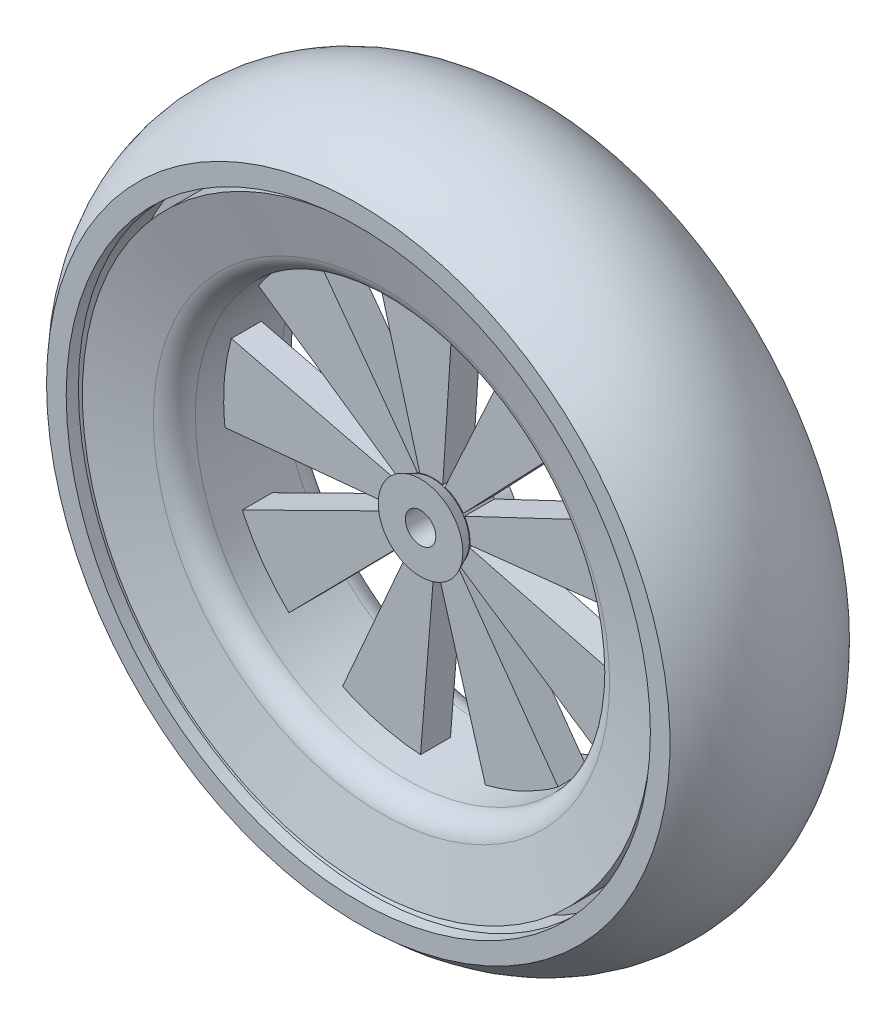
ISO-10303-21;
HEADER;
FILE_DESCRIPTION(('STEP AP214'),'2;1');
FILE_NAME('part.step','',(''),(''),'','','');
FILE_SCHEMA(('AUTOMOTIVE_DESIGN { 1 0 10303 214 1 1 1 1 }'));
ENDSEC;
DATA;
#1=APPLICATION_CONTEXT('core data for automotive mechanical design processes');
#2=APPLICATION_PROTOCOL_DEFINITION('international standard','automotive_design',2000,#1);
#3=PRODUCT_CONTEXT('',#1,'mechanical');
#4=PRODUCT('Part','Part','',(#3));
#5=PRODUCT_RELATED_PRODUCT_CATEGORY('part','',(#4));
#6=PRODUCT_DEFINITION_FORMATION('','',#4);
#7=PRODUCT_DEFINITION_CONTEXT('part definition',#1,'design');
#8=PRODUCT_DEFINITION('design','',#6,#7);
#9=PRODUCT_DEFINITION_SHAPE('','',#8);
#10=(LENGTH_UNIT() NAMED_UNIT(*) SI_UNIT(.MILLI.,.METRE.));
#11=(NAMED_UNIT(*) PLANE_ANGLE_UNIT() SI_UNIT($,.RADIAN.));
#12=(NAMED_UNIT(*) SI_UNIT($,.STERADIAN.) SOLID_ANGLE_UNIT());
#13=UNCERTAINTY_MEASURE_WITH_UNIT(LENGTH_MEASURE(1.E-05),#10,'distance_accuracy_value','');
#14=(GEOMETRIC_REPRESENTATION_CONTEXT(3) GLOBAL_UNCERTAINTY_ASSIGNED_CONTEXT((#13)) GLOBAL_UNIT_ASSIGNED_CONTEXT((#10,
#11,#12)) REPRESENTATION_CONTEXT('',''));
#15=CARTESIAN_POINT('',(0.,0.,0.));
#16=DIRECTION('',(0.,0.,1.));
#17=DIRECTION('',(1.,0.,0.));
#18=AXIS2_PLACEMENT_3D('',#15,#16,#17);
#19=CARTESIAN_POINT('',(0.,0.,22.5));
#20=DIRECTION('',(0.,0.,-1.));
#21=DIRECTION('',(-1.,0.,0.));
#22=AXIS2_PLACEMENT_3D('',#19,#20,#21);
#23=CYLINDRICAL_SURFACE('',#22,27.);
#24=CARTESIAN_POINT('',(0.,0.,22.5));
#25=DIRECTION('',(0.,0.,1.));
#26=DIRECTION('',(1.,0.,0.));
#27=AXIS2_PLACEMENT_3D('',#24,#25,#26);
#28=CIRCLE('',#27,27.);
#29=CARTESIAN_POINT('',(27.,0.,22.5));
#30=VERTEX_POINT('',#29);
#31=EDGE_CURVE('E2334',#30,#30,#28,.T.);
#32=ORIENTED_EDGE('',*,*,#31,.F.);
#33=EDGE_LOOP('',(#32));
#34=FACE_BOUND('',#33,.T.);
#35=DIRECTION('',(0.,0.,-1.));
#36=VECTOR('',#35,1.);
#37=CARTESIAN_POINT('',(8.52341192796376,25.6193569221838,22.05));
#38=LINE('',#37,#36);
#39=CARTESIAN_POINT('',(8.52341192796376,25.6193569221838,22.05));
#40=VERTEX_POINT('',#39);
#41=CARTESIAN_POINT('',(8.52341192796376,25.6193569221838,0.));
#42=VERTEX_POINT('',#41);
#43=EDGE_CURVE('E2327',#40,#42,#38,.T.);
#44=ORIENTED_EDGE('',*,*,#43,.T.);
#45=CARTESIAN_POINT('',(0.,0.,0.));
#46=DIRECTION('',(0.,0.,-1.));
#47=DIRECTION('',(-1.,0.,0.));
#48=AXIS2_PLACEMENT_3D('',#45,#46,#47);
#49=CIRCLE('',#48,27.);
#50=CARTESIAN_POINT('',(6.56524975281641,26.1896448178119,0.));
#51=VERTEX_POINT('',#50);
#52=EDGE_CURVE('E858',#51,#42,#49,.T.);
#53=ORIENTED_EDGE('',*,*,#52,.F.);
#54=DIRECTION('',(0.,0.,-1.));
#55=VECTOR('',#54,1.);
#56=CARTESIAN_POINT('',(6.56524975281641,26.1896448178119,22.05));
#57=LINE('',#56,#55);
#58=CARTESIAN_POINT('',(6.56524975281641,26.1896448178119,22.05));
#59=VERTEX_POINT('',#58);
#60=EDGE_CURVE('E2221',#59,#51,#57,.T.);
#61=ORIENTED_EDGE('',*,*,#60,.F.);
#62=CARTESIAN_POINT('',(0.,0.,22.05));
#63=DIRECTION('',(0.,0.,1.));
#64=DIRECTION('',(0.243157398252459,0.969986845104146,0.));
#65=AXIS2_PLACEMENT_3D('',#62,#63,#64);
#66=CIRCLE('',#65,27.);
#67=CARTESIAN_POINT('',(5.6174079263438,26.4091788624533,22.05));
#68=VERTEX_POINT('',#67);
#69=EDGE_CURVE('E12',#59,#68,#66,.T.);
#70=ORIENTED_EDGE('',*,*,#69,.T.);
#71=CARTESIAN_POINT('',(0.,0.,22.05));
#72=DIRECTION('',(0.,0.,1.));
#73=DIRECTION('',(1.,0.,0.));
#74=AXIS2_PLACEMENT_3D('',#71,#72,#73);
#75=CIRCLE('',#74,27.);
#76=CARTESIAN_POINT('',(-5.46194054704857,26.4417700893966,22.05));
#77=VERTEX_POINT('',#76);
#78=EDGE_CURVE('E60',#68,#77,#75,.T.);
#79=ORIENTED_EDGE('',*,*,#78,.T.);
#80=CARTESIAN_POINT('',(0.,0.,22.05));
#81=DIRECTION('',(0.,0.,1.));
#82=DIRECTION('',(-0.202294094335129,0.9793248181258,0.));
#83=AXIS2_PLACEMENT_3D('',#80,#81,#82);
#84=CIRCLE('',#83,27.);
#85=CARTESIAN_POINT('',(-6.36116479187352,26.2399615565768,22.05));
#86=VERTEX_POINT('',#85);
#87=EDGE_CURVE('E2295',#77,#86,#84,.T.);
#88=ORIENTED_EDGE('',*,*,#87,.T.);
#89=CARTESIAN_POINT('',(-9.93849285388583,25.1043095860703,22.05));
#90=VERTEX_POINT('',#89);
#91=EDGE_CURVE('E2338',#86,#90,#75,.T.);
#92=ORIENTED_EDGE('',*,*,#91,.T.);
#93=DIRECTION('',(0.,0.,-1.));
#94=VECTOR('',#93,1.);
#95=CARTESIAN_POINT('',(-9.93849285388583,25.1043095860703,22.05));
#96=LINE('',#95,#94);
#97=CARTESIAN_POINT('',(-9.93849285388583,25.1043095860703,0.));
#98=VERTEX_POINT('',#97);
#99=EDGE_CURVE('E2222',#90,#98,#96,.T.);
#100=ORIENTED_EDGE('',*,*,#99,.T.);
#101=CARTESIAN_POINT('',(-11.8051061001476,24.2824930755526,0.));
#102=VERTEX_POINT('',#101);
#103=EDGE_CURVE('E1000',#102,#98,#49,.T.);
#104=ORIENTED_EDGE('',*,*,#103,.F.);
#105=DIRECTION('',(0.,0.,-1.));
#106=VECTOR('',#105,1.);
#107=CARTESIAN_POINT('',(-11.8051061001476,24.2824930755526,22.05));
#108=LINE('',#107,#106);
#109=CARTESIAN_POINT('',(-11.8051061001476,24.2824930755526,22.05));
#110=VERTEX_POINT('',#109);
#111=EDGE_CURVE('E2115',#110,#102,#108,.T.);
#112=ORIENTED_EDGE('',*,*,#111,.F.);
#113=CARTESIAN_POINT('',(0.,0.,22.05));
#114=DIRECTION('',(0.,0.,1.));
#115=DIRECTION('',(-0.437226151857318,0.899351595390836,0.));
#116=AXIS2_PLACEMENT_3D('',#113,#114,#115);
#117=CIRCLE('',#116,27.);
#118=CARTESIAN_POINT('',(-12.6723088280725,23.8414049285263,22.05));
#119=VERTEX_POINT('',#118);
#120=EDGE_CURVE('E2044',#110,#119,#117,.T.);
#121=ORIENTED_EDGE('',*,*,#120,.T.);
#122=CARTESIAN_POINT('',(0.,0.,22.05));
#123=DIRECTION('',(0.,0.,1.));
#124=DIRECTION('',(0.766044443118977,0.642787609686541,0.));
#125=AXIS2_PLACEMENT_3D('',#122,#123,#124);
#126=CIRCLE('',#125,27.);
#127=CARTESIAN_POINT('',(-21.1805313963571,16.7447033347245,22.05));
#128=VERTEX_POINT('',#127);
#129=EDGE_CURVE('E2147',#119,#128,#126,.T.);
#130=ORIENTED_EDGE('',*,*,#129,.T.);
#131=CARTESIAN_POINT('',(0.,0.,22.05));
#132=DIRECTION('',(0.,0.,1.));
#133=DIRECTION('',(-0.784464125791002,0.620174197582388,0.));
#134=AXIS2_PLACEMENT_3D('',#131,#132,#133);
#135=CIRCLE('',#134,27.);
#136=CARTESIAN_POINT('',(-21.7396571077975,16.0120988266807,22.05));
#137=VERTEX_POINT('',#136);
#138=EDGE_CURVE('E2144',#128,#137,#135,.T.);
#139=ORIENTED_EDGE('',*,*,#138,.T.);
#140=CARTESIAN_POINT('',(-23.7500663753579,12.8426767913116,22.05));
#141=VERTEX_POINT('',#140);
#142=EDGE_CURVE('E2141',#137,#141,#126,.T.);
#143=ORIENTED_EDGE('',*,*,#142,.T.);
#144=DIRECTION('',(0.,0.,-1.));
#145=VECTOR('',#144,1.);
#146=CARTESIAN_POINT('',(-23.7500663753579,12.8426767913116,22.05));
#147=LINE('',#146,#145);
#148=CARTESIAN_POINT('',(-23.7500663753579,12.8426767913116,0.));
#149=VERTEX_POINT('',#148);
#150=EDGE_CURVE('E2151',#141,#149,#147,.T.);
#151=ORIENTED_EDGE('',*,*,#150,.T.);
#152=CARTESIAN_POINT('',(-24.6517216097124,11.0132929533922,0.));
#153=VERTEX_POINT('',#152);
#154=EDGE_CURVE('E1003',#153,#149,#49,.T.);
#155=ORIENTED_EDGE('',*,*,#154,.F.);
#156=DIRECTION('',(0.,0.,-1.));
#157=VECTOR('',#156,1.);
#158=CARTESIAN_POINT('',(-24.6517216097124,11.0132929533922,22.05));
#159=LINE('',#158,#157);
#160=CARTESIAN_POINT('',(-24.6517216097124,11.0132929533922,22.05));
#161=VERTEX_POINT('',#160);
#162=EDGE_CURVE('E1943',#161,#153,#159,.T.);
#163=ORIENTED_EDGE('',*,*,#162,.F.);
#164=CARTESIAN_POINT('',(0.,0.,22.05));
#165=DIRECTION('',(0.,0.,1.));
#166=DIRECTION('',(-0.913026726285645,0.407899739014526,0.));
#167=AXIS2_PLACEMENT_3D('',#164,#165,#166);
#168=CIRCLE('',#167,27.);
#169=CARTESIAN_POINT('',(-25.0325114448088,10.1179726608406,22.05));
#170=VERTEX_POINT('',#169);
#171=EDGE_CURVE('E1872',#161,#170,#168,.T.);
#172=ORIENTED_EDGE('',*,*,#171,.T.);
#173=CARTESIAN_POINT('',(0.,0.,22.05));
#174=DIRECTION('',(0.,0.,1.));
#175=DIRECTION('',(0.173648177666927,0.984807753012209,0.));
#176=AXIS2_PLACEMENT_3D('',#173,#174,#175);
#177=CIRCLE('',#176,27.);
#178=CARTESIAN_POINT('',(-26.9885162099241,-0.787396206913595,22.05));
#179=VERTEX_POINT('',#178);
#180=EDGE_CURVE('E1975',#170,#179,#177,.T.);
#181=ORIENTED_EDGE('',*,*,#180,.T.);
#182=CARTESIAN_POINT('',(0.,0.,22.05));
#183=DIRECTION('',(0.,0.,1.));
#184=DIRECTION('',(-0.999574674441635,-0.0291628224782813,0.));
#185=AXIS2_PLACEMENT_3D('',#182,#183,#184);
#186=CIRCLE('',#185,27.);
#187=CARTESIAN_POINT('',(-26.945922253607,-1.70800289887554,22.05));
#188=VERTEX_POINT('',#187);
#189=EDGE_CURVE('E1972',#179,#188,#186,.T.);
#190=ORIENTED_EDGE('',*,*,#189,.T.);
#191=CARTESIAN_POINT('',(-26.4487198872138,-5.42818720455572,22.05));
#192=VERTEX_POINT('',#191);
#193=EDGE_CURVE('E1969',#188,#192,#177,.T.);
#194=ORIENTED_EDGE('',*,*,#193,.T.);
#195=DIRECTION('',(0.,0.,-1.));
#196=VECTOR('',#195,1.);
#197=CARTESIAN_POINT('',(-26.4487198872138,-5.42818720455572,22.05));
#198=LINE('',#197,#196);
#199=CARTESIAN_POINT('',(-26.4487198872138,-5.42818720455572,0.));
#200=VERTEX_POINT('',#199);
#201=EDGE_CURVE('E1979',#192,#200,#198,.T.);
#202=ORIENTED_EDGE('',*,*,#201,.T.);
#203=CARTESIAN_POINT('',(-25.9635226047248,-7.40914934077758,0.));
#204=VERTEX_POINT('',#203);
#205=EDGE_CURVE('E1006',#204,#200,#49,.T.);
#206=ORIENTED_EDGE('',*,*,#205,.F.);
#207=DIRECTION('',(0.,0.,-1.));
#208=VECTOR('',#207,1.);
#209=CARTESIAN_POINT('',(-25.9635226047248,-7.40914934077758,22.05));
#210=LINE('',#209,#208);
#211=CARTESIAN_POINT('',(-25.9635226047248,-7.40914934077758,22.05));
#212=VERTEX_POINT('',#211);
#213=EDGE_CURVE('E1771',#212,#204,#210,.T.);
#214=ORIENTED_EDGE('',*,*,#213,.F.);
#215=CARTESIAN_POINT('',(0.,0.,22.05));
#216=DIRECTION('',(0.,0.,1.));
#217=DIRECTION('',(-0.96161194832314,-0.274412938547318,0.));
#218=AXIS2_PLACEMENT_3D('',#215,#216,#217);
#219=CIRCLE('',#218,27.);
#220=CARTESIAN_POINT('',(-25.6797237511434,-8.33977146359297,22.05));
#221=VERTEX_POINT('',#220);
#222=EDGE_CURVE('E1700',#212,#221,#219,.T.);
#223=ORIENTED_EDGE('',*,*,#222,.T.);
#224=CARTESIAN_POINT('',(0.,0.,22.05));
#225=DIRECTION('',(0.,0.,1.));
#226=DIRECTION('',(-0.500000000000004,0.866025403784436,0.));
#227=AXIS2_PLACEMENT_3D('',#224,#225,#226);
#228=CIRCLE('',#227,27.);
#229=CARTESIAN_POINT('',(-20.1682743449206,-17.9510643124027,22.05));
#230=VERTEX_POINT('',#229);
#231=EDGE_CURVE('E1803',#221,#230,#228,.T.);
#232=ORIENTED_EDGE('',*,*,#231,.T.);
#233=CARTESIAN_POINT('',(0.,0.,22.05));
#234=DIRECTION('',(0.,0.,1.));
#235=DIRECTION('',(-0.746973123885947,-0.664854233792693,0.));
#236=AXIS2_PLACEMENT_3D('',#233,#234,#235);
#237=CIRCLE('',#236,27.);
#238=CARTESIAN_POINT('',(-19.5438909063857,-18.6289110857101,22.05));
#239=VERTEX_POINT('',#238);
#240=EDGE_CURVE('E1800',#230,#239,#237,.T.);
#241=ORIENTED_EDGE('',*,*,#240,.T.);
#242=CARTESIAN_POINT('',(-16.7717234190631,-21.1591420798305,22.05));
#243=VERTEX_POINT('',#242);
#244=EDGE_CURVE('E1797',#239,#243,#228,.T.);
#245=ORIENTED_EDGE('',*,*,#244,.T.);
#246=DIRECTION('',(0.,0.,-1.));
#247=VECTOR('',#246,1.);
#248=CARTESIAN_POINT('',(-16.7717234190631,-21.1591420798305,22.05));
#249=LINE('',#248,#247);
#250=CARTESIAN_POINT('',(-16.7717234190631,-21.1591420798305,0.));
#251=VERTEX_POINT('',#250);
#252=EDGE_CURVE('E1807',#243,#251,#249,.T.);
#253=ORIENTED_EDGE('',*,*,#252,.T.);
#254=CARTESIAN_POINT('',(-15.1267028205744,-22.3647683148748,0.));
#255=VERTEX_POINT('',#254);
#256=EDGE_CURVE('E1009',#255,#251,#49,.T.);
#257=ORIENTED_EDGE('',*,*,#256,.F.);
#258=DIRECTION('',(0.,0.,-1.));
#259=VECTOR('',#258,1.);
#260=CARTESIAN_POINT('',(-15.1267028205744,-22.3647683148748,22.05));
#261=LINE('',#260,#259);
#262=CARTESIAN_POINT('',(-15.1267028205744,-22.3647683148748,22.05));
#263=VERTEX_POINT('',#262);
#264=EDGE_CURVE('E1599',#263,#255,#261,.T.);
#265=ORIENTED_EDGE('',*,*,#264,.F.);
#266=CARTESIAN_POINT('',(0.,0.,22.05));
#267=DIRECTION('',(0.,0.,1.));
#268=DIRECTION('',(-0.560248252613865,-0.828324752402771,0.));
#269=AXIS2_PLACEMENT_3D('',#266,#267,#268);
#270=CIRCLE('',#269,27.);
#271=CARTESIAN_POINT('',(-14.3111079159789,-22.8952438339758,22.05));
#272=VERTEX_POINT('',#271);
#273=EDGE_CURVE('E1528',#263,#272,#270,.T.);
#274=ORIENTED_EDGE('',*,*,#273,.T.);
#275=CARTESIAN_POINT('',(0.,0.,22.05));
#276=DIRECTION('',(0.,0.,1.));
#277=DIRECTION('',(-0.939692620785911,0.342020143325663,0.));
#278=AXIS2_PLACEMENT_3D('',#275,#276,#277);
#279=CIRCLE('',#278,27.);
#280=CARTESIAN_POINT('',(-3.91107276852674,-26.7152299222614,22.05));
#281=VERTEX_POINT('',#280);
#282=EDGE_CURVE('E1631',#272,#281,#279,.T.);
#283=ORIENTED_EDGE('',*,*,#282,.T.);
#284=CARTESIAN_POINT('',(0.,0.,22.05));
#285=DIRECTION('',(0.,0.,1.));
#286=DIRECTION('',(-0.144854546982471,-0.989452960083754,0.));
#287=AXIS2_PLACEMENT_3D('',#284,#285,#286);
#288=CIRCLE('',#287,27.);
#289=CARTESIAN_POINT('',(-2.9970557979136,-26.8331447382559,22.05));
#290=VERTEX_POINT('',#289);
#291=EDGE_CURVE('E1628',#281,#290,#288,.T.);
#292=ORIENTED_EDGE('',*,*,#291,.T.);
#293=CARTESIAN_POINT('',(0.752948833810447,-26.9894992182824,22.05));
#294=VERTEX_POINT('',#293);
#295=EDGE_CURVE('E1625',#290,#294,#279,.T.);
#296=ORIENTED_EDGE('',*,*,#295,.T.);
#297=DIRECTION('',(0.,0.,-1.));
#298=VECTOR('',#297,1.);
#299=CARTESIAN_POINT('',(0.752948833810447,-26.9894992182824,22.05));
#300=LINE('',#299,#298);
#301=CARTESIAN_POINT('',(0.752948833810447,-26.9894992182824,0.));
#302=VERTEX_POINT('',#301);
#303=EDGE_CURVE('E1635',#294,#302,#300,.T.);
#304=ORIENTED_EDGE('',*,*,#303,.T.);
#305=CARTESIAN_POINT('',(2.78806932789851,-26.8556636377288,0.));
#306=VERTEX_POINT('',#305);
#307=EDGE_CURVE('E1012',#306,#302,#49,.T.);
#308=ORIENTED_EDGE('',*,*,#307,.F.);
#309=DIRECTION('',(0.,0.,-1.));
#310=VECTOR('',#309,1.);
#311=CARTESIAN_POINT('',(2.78806932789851,-26.8556636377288,22.05));
#312=LINE('',#311,#310);
#313=CARTESIAN_POINT('',(2.78806932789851,-26.8556636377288,22.05));
#314=VERTEX_POINT('',#313);
#315=EDGE_CURVE('E1427',#314,#306,#312,.T.);
#316=ORIENTED_EDGE('',*,*,#315,.F.);
#317=CARTESIAN_POINT('',(0.,0.,22.05));
#318=DIRECTION('',(0.,0.,1.));
#319=DIRECTION('',(0.103261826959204,-0.994654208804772,0.));
#320=AXIS2_PLACEMENT_3D('',#317,#318,#319);
#321=CIRCLE('',#320,27.);
#322=CARTESIAN_POINT('',(3.75383436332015,-26.7377771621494,22.05));
#323=VERTEX_POINT('',#322);
#324=EDGE_CURVE('E1356',#314,#323,#321,.T.);
#325=ORIENTED_EDGE('',*,*,#324,.T.);
#326=CARTESIAN_POINT('',(0.,0.,22.05));
#327=DIRECTION('',(0.,0.,1.));
#328=DIRECTION('',(-0.939692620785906,-0.342020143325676,0.));
#329=AXIS2_PLACEMENT_3D('',#326,#327,#328);
#330=CIRCLE('',#329,27.);
#331=CARTESIAN_POINT('',(14.1761632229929,-22.9790425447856,22.05));
#332=VERTEX_POINT('',#331);
#333=EDGE_CURVE('E1459',#323,#332,#330,.T.);
#334=ORIENTED_EDGE('',*,*,#333,.T.);
#335=CARTESIAN_POINT('',(0.,0.,22.05));
#336=DIRECTION('',(0.,0.,1.));
#337=DIRECTION('',(0.525043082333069,-0.851075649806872,0.));
#338=AXIS2_PLACEMENT_3D('',#335,#336,#337);
#339=CIRCLE('',#338,27.);
#340=CARTESIAN_POINT('',(14.9521350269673,-22.4818517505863,22.05));
#341=VERTEX_POINT('',#340);
#342=EDGE_CURVE('E1456',#332,#341,#339,.T.);
#343=ORIENTED_EDGE('',*,*,#342,.T.);
#344=CARTESIAN_POINT('',(17.9253079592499,-20.1911697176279,22.05));
#345=VERTEX_POINT('',#344);
#346=EDGE_CURVE('E1453',#341,#345,#330,.T.);
#347=ORIENTED_EDGE('',*,*,#346,.T.);
#348=DIRECTION('',(0.,0.,-1.));
#349=VECTOR('',#348,1.);
#350=CARTESIAN_POINT('',(17.9253079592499,-20.1911697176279,22.05));
#351=LINE('',#350,#349);
#352=CARTESIAN_POINT('',(17.9253079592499,-20.1911697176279,0.));
#353=VERTEX_POINT('',#352);
#354=EDGE_CURVE('E1463',#345,#353,#351,.T.);
#355=ORIENTED_EDGE('',*,*,#354,.T.);
#356=CARTESIAN_POINT('',(19.3982728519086,-18.7804954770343,0.));
#357=VERTEX_POINT('',#356);
#358=EDGE_CURVE('E1014',#357,#353,#49,.T.);
#359=ORIENTED_EDGE('',*,*,#358,.F.);
#360=DIRECTION('',(0.,0.,-1.));
#361=VECTOR('',#360,1.);
#362=CARTESIAN_POINT('',(19.3982728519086,-18.7804954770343,22.05));
#363=LINE('',#362,#361);
#364=CARTESIAN_POINT('',(19.3982728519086,-18.7804954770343,22.05));
#365=VERTEX_POINT('',#364);
#366=EDGE_CURVE('E1255',#365,#357,#363,.T.);
#367=ORIENTED_EDGE('',*,*,#366,.F.);
#368=CARTESIAN_POINT('',(0.,0.,22.05));
#369=DIRECTION('',(0.,0.,1.));
#370=DIRECTION('',(0.718454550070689,-0.695573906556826,0.));
#371=AXIS2_PLACEMENT_3D('',#368,#369,#370);
#372=CIRCLE('',#371,27.);
#373=CARTESIAN_POINT('',(20.0623158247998,-18.0694073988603,22.05));
#374=VERTEX_POINT('',#373);
#375=EDGE_CURVE('E1184',#365,#374,#372,.T.);
#376=ORIENTED_EDGE('',*,*,#375,.T.);
#377=CARTESIAN_POINT('',(0.,0.,22.05));
#378=DIRECTION('',(0.,0.,1.));
#379=DIRECTION('',(-0.499999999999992,-0.866025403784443,0.));
#380=AXIS2_PLACEMENT_3D('',#377,#378,#379);
#381=CIRCLE('',#380,27.);
#382=CARTESIAN_POINT('',(25.6302148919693,-8.49070577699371,22.05));
#383=VERTEX_POINT('',#382);
#384=EDGE_CURVE('E1287',#374,#383,#381,.T.);
#385=ORIENTED_EDGE('',*,*,#384,.T.);
#386=CARTESIAN_POINT('',(0.,0.,22.05));
#387=DIRECTION('',(0.,0.,1.));
#388=DIRECTION('',(0.949267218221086,-0.3144705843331,0.));
#389=AXIS2_PLACEMENT_3D('',#386,#387,#388);
#390=CIRCLE('',#389,27.);
#391=CARTESIAN_POINT('',(25.9050556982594,-7.61105047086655,22.05));
#392=VERTEX_POINT('',#391);
#393=EDGE_CURVE('E1284',#383,#392,#390,.T.);
#394=ORIENTED_EDGE('',*,*,#393,.T.);
#395=CARTESIAN_POINT('',(26.710216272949,-3.94516750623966,22.05));
#396=VERTEX_POINT('',#395);
#397=EDGE_CURVE('E1281',#392,#396,#381,.T.);
#398=ORIENTED_EDGE('',*,*,#397,.T.);
#399=DIRECTION('',(0.,0.,-1.));
#400=VECTOR('',#399,1.);
#401=CARTESIAN_POINT('',(26.710216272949,-3.94516750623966,22.05));
#402=LINE('',#401,#400);
#403=CARTESIAN_POINT('',(26.710216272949,-3.94516750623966,0.));
#404=VERTEX_POINT('',#403);
#405=EDGE_CURVE('E1291',#396,#404,#402,.T.);
#406=ORIENTED_EDGE('',*,*,#405,.T.);
#407=CARTESIAN_POINT('',(26.9318089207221,-1.91772476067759,0.));
#408=VERTEX_POINT('',#407);
#409=EDGE_CURVE('E859',#408,#404,#49,.T.);
#410=ORIENTED_EDGE('',*,*,#409,.F.);
#411=DIRECTION('',(0.,0.,-1.));
#412=VECTOR('',#411,1.);
#413=CARTESIAN_POINT('',(26.9318089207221,-1.91772476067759,22.05));
#414=LINE('',#413,#412);
#415=CARTESIAN_POINT('',(26.9318089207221,-1.91772476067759,22.05));
#416=VERTEX_POINT('',#415);
#417=EDGE_CURVE('E1088',#416,#408,#414,.T.);
#418=ORIENTED_EDGE('',*,*,#417,.F.);
#419=CARTESIAN_POINT('',(0.,0.,22.05));
#420=DIRECTION('',(0.,0.,1.));
#421=DIRECTION('',(0.997474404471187,-0.0710268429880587,0.));
#422=AXIS2_PLACEMENT_3D('',#419,#420,#421);
#423=CIRCLE('',#422,27.);
#424=CARTESIAN_POINT('',(26.9834167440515,-0.9461610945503,22.05));
#425=VERTEX_POINT('',#424);
#426=EDGE_CURVE('E1022',#416,#425,#423,.T.);
#427=ORIENTED_EDGE('',*,*,#426,.T.);
#428=CARTESIAN_POINT('',(0.,0.,22.05));
#429=DIRECTION('',(0.,0.,1.));
#430=DIRECTION('',(0.17364817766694,-0.984807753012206,0.));
#431=AXIS2_PLACEMENT_3D('',#428,#429,#430);
#432=CIRCLE('',#431,27.);
#433=CARTESIAN_POINT('',(25.0916041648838,9.97052658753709,22.05));
#434=VERTEX_POINT('',#433);
#435=EDGE_CURVE('E1118',#425,#434,#432,.T.);
#436=ORIENTED_EDGE('',*,*,#435,.T.);
#437=CARTESIAN_POINT('',(0.,0.,22.05));
#438=DIRECTION('',(0.,0.,1.));
#439=DIRECTION('',(0.929318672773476,0.369278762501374,0.));
#440=AXIS2_PLACEMENT_3D('',#437,#438,#439);
#441=CIRCLE('',#440,27.);
#442=CARTESIAN_POINT('',(24.7367129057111,10.8210459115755,22.05));
#443=VERTEX_POINT('',#442);
#444=EDGE_CURVE('E1033',#434,#443,#441,.T.);
#445=ORIENTED_EDGE('',*,*,#444,.T.);
#446=CARTESIAN_POINT('',(22.9971175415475,14.146822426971,22.05));
#447=VERTEX_POINT('',#446);
#448=EDGE_CURVE('E1114',#443,#447,#432,.T.);
#449=ORIENTED_EDGE('',*,*,#448,.T.);
#450=DIRECTION('',(0.,0.,-1.));
#451=VECTOR('',#450,1.);
#452=CARTESIAN_POINT('',(22.9971175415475,14.146822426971,22.05));
#453=LINE('',#452,#451);
#454=CARTESIAN_POINT('',(22.9971175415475,14.146822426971,0.));
#455=VERTEX_POINT('',#454);
#456=EDGE_CURVE('E854',#447,#455,#453,.T.);
#457=ORIENTED_EDGE('',*,*,#456,.T.);
#458=CARTESIAN_POINT('',(21.8636522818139,15.8423706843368,0.));
#459=VERTEX_POINT('',#458);
#460=EDGE_CURVE('E850',#459,#455,#49,.T.);
#461=ORIENTED_EDGE('',*,*,#460,.F.);
#462=DIRECTION('',(0.,0.,-1.));
#463=VECTOR('',#462,1.);
#464=CARTESIAN_POINT('',(21.8636522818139,15.8423706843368,22.05));
#465=LINE('',#464,#463);
#466=CARTESIAN_POINT('',(21.8636522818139,15.8423706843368,22.05));
#467=VERTEX_POINT('',#466);
#468=EDGE_CURVE('E839',#467,#459,#465,.T.);
#469=ORIENTED_EDGE('',*,*,#468,.F.);
#470=CARTESIAN_POINT('',(0.,0.,22.05));
#471=DIRECTION('',(0.,0.,1.));
#472=DIRECTION('',(0.809764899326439,0.586754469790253,0.));
#473=AXIS2_PLACEMENT_3D('',#470,#471,#472);
#474=CIRCLE('',#473,27.);
#475=CARTESIAN_POINT('',(21.2786770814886,16.619804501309,22.05));
#476=VERTEX_POINT('',#475);
#477=EDGE_CURVE('E847',#467,#476,#474,.T.);
#478=ORIENTED_EDGE('',*,*,#477,.T.);
#479=CARTESIAN_POINT('',(0.,0.,22.05));
#480=DIRECTION('',(0.,0.,1.));
#481=DIRECTION('',(0.766044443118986,-0.64278760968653,0.));
#482=AXIS2_PLACEMENT_3D('',#479,#480,#481);
#483=CIRCLE('',#482,27.);
#484=CARTESIAN_POINT('',(12.8123529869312,23.7664387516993,22.05));
#485=VERTEX_POINT('',#484);
#486=EDGE_CURVE('E3633',#476,#485,#483,.T.);
#487=ORIENTED_EDGE('',*,*,#486,.T.);
#488=CARTESIAN_POINT('',(0.,0.,22.05));
#489=DIRECTION('',(0.,0.,1.));
#490=DIRECTION('',(0.474531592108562,0.880238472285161,0.));
#491=AXIS2_PLACEMENT_3D('',#488,#489,#490);
#492=CIRCLE('',#491,27.);
#493=CARTESIAN_POINT('',(11.9937872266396,24.189854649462,22.05));
#494=VERTEX_POINT('',#493);
#495=EDGE_CURVE('E3630',#485,#494,#492,.T.);
#496=ORIENTED_EDGE('',*,*,#495,.T.);
#497=EDGE_CURVE('E3628',#494,#40,#483,.T.);
#498=ORIENTED_EDGE('',*,*,#497,.T.);
#499=EDGE_LOOP('',(#44,#53,#61,#70,#79,#88,#92,#100,#104,#112,#121,#130,#139,#143,#151,#155,
#163,#172,#181,#190,#194,#202,#206,#214,#223,#232,#241,#245,#253,#257,#265,#274,#283,#292,#296,
#304,#308,#316,#325,#334,#343,#347,#355,#359,#367,#376,#385,#394,#398,#406,#410,#418,#427,#436,
#445,#449,#457,#461,#469,#478,#487,#496,#498));
#500=FACE_BOUND('',#499,.T.);
#501=ADVANCED_FACE('F49',(#34,#500),#23,.T.);
#502=CARTESIAN_POINT('',(0.,0.,22.5));
#503=DIRECTION('',(0.,0.,1.));
#504=DIRECTION('',(1.,0.,0.));
#505=AXIS2_PLACEMENT_3D('',#502,#503,#504);
#506=CONICAL_SURFACE('',#505,27.,0.436332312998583);
#507=CARTESIAN_POINT('',(0.,0.,31.5));
#508=DIRECTION('',(0.,0.,1.));
#509=DIRECTION('',(1.,0.,0.));
#510=AXIS2_PLACEMENT_3D('',#507,#508,#509);
#511=CIRCLE('',#510,31.196768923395);
#512=CARTESIAN_POINT('',(31.196768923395,0.,31.5));
#513=VERTEX_POINT('',#512);
#514=EDGE_CURVE('E2330',#513,#513,#511,.T.);
#515=ORIENTED_EDGE('',*,*,#514,.F.);
#516=EDGE_LOOP('',(#515));
#517=FACE_BOUND('',#516,.T.);
#518=ORIENTED_EDGE('',*,*,#31,.T.);
#519=EDGE_LOOP('',(#518));
#520=FACE_BOUND('',#519,.T.);
#521=ADVANCED_FACE('F2369',(#517,#520),#506,.T.);
#522=CARTESIAN_POINT('',(0.,0.,31.5));
#523=DIRECTION('',(0.,0.,1.));
#524=DIRECTION('',(1.,0.,0.));
#525=AXIS2_PLACEMENT_3D('',#522,#523,#524);
#526=PLANE('',#525);
#527=CARTESIAN_POINT('',(0.,0.,31.5));
#528=DIRECTION('',(0.,0.,1.));
#529=DIRECTION('',(1.,0.,0.));
#530=AXIS2_PLACEMENT_3D('',#527,#528,#529);
#531=CIRCLE('',#530,11.25);
#532=CARTESIAN_POINT('',(11.25,0.,31.5));
#533=VERTEX_POINT('',#532);
#534=EDGE_CURVE('E983',#533,#533,#531,.T.);
#535=ORIENTED_EDGE('',*,*,#534,.F.);
#536=EDGE_LOOP('',(#535));
#537=FACE_BOUND('',#536,.T.);
#538=ORIENTED_EDGE('',*,*,#514,.T.);
#539=EDGE_LOOP('',(#538));
#540=FACE_BOUND('',#539,.T.);
#541=ADVANCED_FACE('F880',(#537,#540),#526,.T.);
#542=CARTESIAN_POINT('',(0.,0.,0.));
#543=DIRECTION('',(0.,0.,-1.));
#544=DIRECTION('',(-1.,0.,0.));
#545=AXIS2_PLACEMENT_3D('',#542,#543,#544);
#546=CONICAL_SURFACE('',#545,27.,0.436332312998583);
#547=CARTESIAN_POINT('',(0.,0.,-9.));
#548=DIRECTION('',(0.,0.,-1.));
#549=DIRECTION('',(-1.,0.,0.));
#550=AXIS2_PLACEMENT_3D('',#547,#548,#549);
#551=CIRCLE('',#550,31.196768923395);
#552=CARTESIAN_POINT('',(-31.196768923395,0.,-9.));
#553=VERTEX_POINT('',#552);
#554=EDGE_CURVE('E985',#553,#553,#551,.T.);
#555=ORIENTED_EDGE('',*,*,#554,.F.);
#556=EDGE_LOOP('',(#555));
#557=FACE_BOUND('',#556,.T.);
#558=CARTESIAN_POINT('',(-6.36116479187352,26.2399615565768,0.));
#559=VERTEX_POINT('',#558);
#560=EDGE_CURVE('E990',#98,#559,#49,.T.);
#561=ORIENTED_EDGE('',*,*,#560,.T.);
#562=CARTESIAN_POINT('',(0.,0.,0.));
#563=DIRECTION('',(0.,0.,-1.));
#564=DIRECTION('',(-0.235598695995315,0.971850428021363,0.));
#565=AXIS2_PLACEMENT_3D('',#562,#563,#564);
#566=CIRCLE('',#565,27.);
#567=CARTESIAN_POINT('',(-5.46194054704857,26.4417700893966,0.));
#568=VERTEX_POINT('',#567);
#569=EDGE_CURVE('E2253',#559,#568,#566,.T.);
#570=ORIENTED_EDGE('',*,*,#569,.T.);
#571=CARTESIAN_POINT('',(5.6174079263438,26.4091788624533,0.));
#572=VERTEX_POINT('',#571);
#573=EDGE_CURVE('E995',#568,#572,#49,.T.);
#574=ORIENTED_EDGE('',*,*,#573,.T.);
#575=CARTESIAN_POINT('',(0.,0.,0.));
#576=DIRECTION('',(0.,0.,-1.));
#577=DIRECTION('',(0.208052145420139,0.978117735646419,0.));
#578=AXIS2_PLACEMENT_3D('',#575,#576,#577);
#579=CIRCLE('',#578,27.);
#580=EDGE_CURVE('E2328',#572,#51,#579,.T.);
#581=ORIENTED_EDGE('',*,*,#580,.T.);
#582=ORIENTED_EDGE('',*,*,#52,.T.);
#583=CARTESIAN_POINT('',(0.,0.,0.));
#584=DIRECTION('',(0.,0.,-1.));
#585=DIRECTION('',(-0.766044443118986,0.64278760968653,0.));
#586=AXIS2_PLACEMENT_3D('',#583,#584,#585);
#587=CIRCLE('',#586,27.);
#588=CARTESIAN_POINT('',(11.9937872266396,24.189854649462,0.));
#589=VERTEX_POINT('',#588);
#590=EDGE_CURVE('E3574',#42,#589,#587,.T.);
#591=ORIENTED_EDGE('',*,*,#590,.T.);
#592=CARTESIAN_POINT('',(0.,0.,0.));
#593=DIRECTION('',(0.,0.,-1.));
#594=DIRECTION('',(0.444214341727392,0.895920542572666,0.));
#595=AXIS2_PLACEMENT_3D('',#592,#593,#594);
#596=CIRCLE('',#595,27.);
#597=CARTESIAN_POINT('',(12.8123529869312,23.7664387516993,0.));
#598=VERTEX_POINT('',#597);
#599=EDGE_CURVE('E67',#589,#598,#596,.T.);
#600=ORIENTED_EDGE('',*,*,#599,.T.);
#601=CARTESIAN_POINT('',(21.2786770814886,16.619804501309,0.));
#602=VERTEX_POINT('',#601);
#603=EDGE_CURVE('E836',#598,#602,#587,.T.);
#604=ORIENTED_EDGE('',*,*,#603,.T.);
#605=CARTESIAN_POINT('',(0.,0.,0.));
#606=DIRECTION('',(0.,0.,-1.));
#607=DIRECTION('',(0.788099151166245,0.615548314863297,0.));
#608=AXIS2_PLACEMENT_3D('',#605,#606,#607);
#609=CIRCLE('',#608,27.);
#610=EDGE_CURVE('E829',#602,#459,#609,.T.);
#611=ORIENTED_EDGE('',*,*,#610,.T.);
#612=ORIENTED_EDGE('',*,*,#460,.T.);
#613=CARTESIAN_POINT('',(0.,0.,0.));
#614=DIRECTION('',(0.,0.,-1.));
#615=DIRECTION('',(-0.17364817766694,0.984807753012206,0.));
#616=AXIS2_PLACEMENT_3D('',#613,#614,#615);
#617=CIRCLE('',#616,27.);
#618=CARTESIAN_POINT('',(24.7367129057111,10.8210459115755,0.));
#619=VERTEX_POINT('',#618);
#620=EDGE_CURVE('E1044',#455,#619,#617,.T.);
#621=ORIENTED_EDGE('',*,*,#620,.T.);
#622=CARTESIAN_POINT('',(0.,0.,0.));
#623=DIRECTION('',(0.,0.,-1.));
#624=DIRECTION('',(0.916174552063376,0.400779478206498,0.));
#625=AXIS2_PLACEMENT_3D('',#622,#623,#624);
#626=CIRCLE('',#625,27.);
#627=CARTESIAN_POINT('',(25.0916041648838,9.97052658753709,0.));
#628=VERTEX_POINT('',#627);
#629=EDGE_CURVE('E1042',#619,#628,#626,.T.);
#630=ORIENTED_EDGE('',*,*,#629,.T.);
#631=CARTESIAN_POINT('',(26.9834167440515,-0.9461610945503,0.));
#632=VERTEX_POINT('',#631);
#633=EDGE_CURVE('E1043',#628,#632,#617,.T.);
#634=ORIENTED_EDGE('',*,*,#633,.T.);
#635=CARTESIAN_POINT('',(0.,0.,0.));
#636=DIRECTION('',(0.,0.,-1.));
#637=DIRECTION('',(0.999385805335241,-0.0350430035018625,0.));
#638=AXIS2_PLACEMENT_3D('',#635,#636,#637);
#639=CIRCLE('',#638,27.);
#640=EDGE_CURVE('E76',#632,#408,#639,.T.);
#641=ORIENTED_EDGE('',*,*,#640,.T.);
#642=ORIENTED_EDGE('',*,*,#409,.T.);
#643=CARTESIAN_POINT('',(0.,0.,0.));
#644=DIRECTION('',(0.,0.,-1.));
#645=DIRECTION('',(0.499999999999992,0.866025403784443,0.));
#646=AXIS2_PLACEMENT_3D('',#643,#644,#645);
#647=CIRCLE('',#646,27.);
#648=CARTESIAN_POINT('',(25.9050556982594,-7.61105047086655,0.));
#649=VERTEX_POINT('',#648);
#650=EDGE_CURVE('E1219',#404,#649,#647,.T.);
#651=ORIENTED_EDGE('',*,*,#650,.T.);
#652=CARTESIAN_POINT('',(0.,0.,0.));
#653=DIRECTION('',(0.,0.,-1.));
#654=DIRECTION('',(0.959446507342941,-0.281890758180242,0.));
#655=AXIS2_PLACEMENT_3D('',#652,#653,#654);
#656=CIRCLE('',#655,27.);
#657=CARTESIAN_POINT('',(25.6302148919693,-8.49070577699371,0.));
#658=VERTEX_POINT('',#657);
#659=EDGE_CURVE('E1216',#649,#658,#656,.T.);
#660=ORIENTED_EDGE('',*,*,#659,.T.);
#661=CARTESIAN_POINT('',(20.0623158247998,-18.0694073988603,0.));
#662=VERTEX_POINT('',#661);
#663=EDGE_CURVE('E1212',#658,#662,#647,.T.);
#664=ORIENTED_EDGE('',*,*,#663,.T.);
#665=CARTESIAN_POINT('',(0.,0.,0.));
#666=DIRECTION('',(0.,0.,-1.));
#667=DIRECTION('',(0.743048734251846,-0.669237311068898,0.));
#668=AXIS2_PLACEMENT_3D('',#665,#666,#667);
#669=CIRCLE('',#668,27.);
#670=EDGE_CURVE('E1146',#662,#357,#669,.T.);
#671=ORIENTED_EDGE('',*,*,#670,.T.);
#672=ORIENTED_EDGE('',*,*,#358,.T.);
#673=CARTESIAN_POINT('',(0.,0.,0.));
#674=DIRECTION('',(0.,0.,-1.));
#675=DIRECTION('',(0.939692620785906,0.342020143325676,0.));
#676=AXIS2_PLACEMENT_3D('',#673,#674,#675);
#677=CIRCLE('',#676,27.);
#678=CARTESIAN_POINT('',(14.9521350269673,-22.4818517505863,0.));
#679=VERTEX_POINT('',#678);
#680=EDGE_CURVE('E1391',#353,#679,#677,.T.);
#681=ORIENTED_EDGE('',*,*,#680,.T.);
#682=CARTESIAN_POINT('',(0.,0.,0.));
#683=DIRECTION('',(0.,0.,-1.));
#684=DIRECTION('',(0.553782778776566,-0.832661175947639,0.));
#685=AXIS2_PLACEMENT_3D('',#682,#683,#684);
#686=CIRCLE('',#685,27.);
#687=CARTESIAN_POINT('',(14.1761632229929,-22.9790425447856,0.));
#688=VERTEX_POINT('',#687);
#689=EDGE_CURVE('E1388',#679,#688,#686,.T.);
#690=ORIENTED_EDGE('',*,*,#689,.T.);
#691=CARTESIAN_POINT('',(3.75383436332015,-26.7377771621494,0.));
#692=VERTEX_POINT('',#691);
#693=EDGE_CURVE('E1384',#688,#692,#677,.T.);
#694=ORIENTED_EDGE('',*,*,#693,.T.);
#695=CARTESIAN_POINT('',(0.,0.,0.));
#696=DIRECTION('',(0.,0.,-1.));
#697=DIRECTION('',(0.139030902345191,-0.990288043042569,0.));
#698=AXIS2_PLACEMENT_3D('',#695,#696,#697);
#699=CIRCLE('',#698,27.);
#700=EDGE_CURVE('E1318',#692,#306,#699,.T.);
#701=ORIENTED_EDGE('',*,*,#700,.T.);
#702=ORIENTED_EDGE('',*,*,#307,.T.);
#703=CARTESIAN_POINT('',(0.,0.,0.));
#704=DIRECTION('',(0.,0.,-1.));
#705=DIRECTION('',(0.939692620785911,-0.342020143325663,0.));
#706=AXIS2_PLACEMENT_3D('',#703,#704,#705);
#707=CIRCLE('',#706,27.);
#708=CARTESIAN_POINT('',(-2.9970557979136,-26.8331447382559,0.));
#709=VERTEX_POINT('',#708);
#710=EDGE_CURVE('E1563',#302,#709,#707,.T.);
#711=ORIENTED_EDGE('',*,*,#710,.T.);
#712=CARTESIAN_POINT('',(0.,0.,0.));
#713=DIRECTION('',(0.,0.,-1.));
#714=DIRECTION('',(-0.111002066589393,-0.993820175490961,0.));
#715=AXIS2_PLACEMENT_3D('',#712,#713,#714);
#716=CIRCLE('',#715,27.);
#717=CARTESIAN_POINT('',(-3.91107276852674,-26.7152299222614,0.));
#718=VERTEX_POINT('',#717);
#719=EDGE_CURVE('E1560',#709,#718,#716,.T.);
#720=ORIENTED_EDGE('',*,*,#719,.T.);
#721=CARTESIAN_POINT('',(-14.3111079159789,-22.8952438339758,0.));
#722=VERTEX_POINT('',#721);
#723=EDGE_CURVE('E1556',#718,#722,#707,.T.);
#724=ORIENTED_EDGE('',*,*,#723,.T.);
#725=CARTESIAN_POINT('',(0.,0.,0.));
#726=DIRECTION('',(0.,0.,-1.));
#727=DIRECTION('',(-0.530041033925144,-0.847971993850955,0.));
#728=AXIS2_PLACEMENT_3D('',#725,#726,#727);
#729=CIRCLE('',#728,27.);
#730=EDGE_CURVE('E1490',#722,#255,#729,.T.);
#731=ORIENTED_EDGE('',*,*,#730,.T.);
#732=ORIENTED_EDGE('',*,*,#256,.T.);
#733=CARTESIAN_POINT('',(0.,0.,0.));
#734=DIRECTION('',(0.,0.,-1.));
#735=DIRECTION('',(0.500000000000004,-0.866025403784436,0.));
#736=AXIS2_PLACEMENT_3D('',#733,#734,#735);
#737=CIRCLE('',#736,27.);
#738=CARTESIAN_POINT('',(-19.5438909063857,-18.6289110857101,0.));
#739=VERTEX_POINT('',#738);
#740=EDGE_CURVE('E1735',#251,#739,#737,.T.);
#741=ORIENTED_EDGE('',*,*,#740,.T.);
#742=CARTESIAN_POINT('',(0.,0.,0.));
#743=DIRECTION('',(0.,0.,-1.));
#744=DIRECTION('',(-0.723847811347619,-0.689959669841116,0.));
#745=AXIS2_PLACEMENT_3D('',#742,#743,#744);
#746=CIRCLE('',#745,27.);
#747=CARTESIAN_POINT('',(-20.1682743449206,-17.9510643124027,0.));
#748=VERTEX_POINT('',#747);
#749=EDGE_CURVE('E1732',#739,#748,#746,.T.);
#750=ORIENTED_EDGE('',*,*,#749,.T.);
#751=CARTESIAN_POINT('',(-25.6797237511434,-8.33977146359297,0.));
#752=VERTEX_POINT('',#751);
#753=EDGE_CURVE('E1728',#748,#752,#737,.T.);
#754=ORIENTED_EDGE('',*,*,#753,.T.);
#755=CARTESIAN_POINT('',(0.,0.,0.));
#756=DIRECTION('',(0.,0.,-1.));
#757=DIRECTION('',(-0.951100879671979,-0.308880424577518,0.));
#758=AXIS2_PLACEMENT_3D('',#755,#756,#757);
#759=CIRCLE('',#758,27.);
#760=EDGE_CURVE('E1662',#752,#204,#759,.T.);
#761=ORIENTED_EDGE('',*,*,#760,.T.);
#762=ORIENTED_EDGE('',*,*,#205,.T.);
#763=CARTESIAN_POINT('',(0.,0.,0.));
#764=DIRECTION('',(0.,0.,-1.));
#765=DIRECTION('',(-0.173648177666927,-0.984807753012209,0.));
#766=AXIS2_PLACEMENT_3D('',#763,#764,#765);
#767=CIRCLE('',#766,27.);
#768=CARTESIAN_POINT('',(-26.945922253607,-1.70800289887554,0.));
#769=VERTEX_POINT('',#768);
#770=EDGE_CURVE('E1907',#200,#769,#767,.T.);
#771=ORIENTED_EDGE('',*,*,#770,.T.);
#772=CARTESIAN_POINT('',(0.,0.,0.));
#773=DIRECTION('',(0.,0.,-1.));
#774=DIRECTION('',(-0.997997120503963,-0.0632593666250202,0.));
#775=AXIS2_PLACEMENT_3D('',#772,#773,#774);
#776=CIRCLE('',#775,27.);
#777=CARTESIAN_POINT('',(-26.9885162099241,-0.787396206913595,0.));
#778=VERTEX_POINT('',#777);
#779=EDGE_CURVE('E1904',#769,#778,#776,.T.);
#780=ORIENTED_EDGE('',*,*,#779,.T.);
#781=CARTESIAN_POINT('',(-25.0325114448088,10.1179726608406,0.));
#782=VERTEX_POINT('',#781);
#783=EDGE_CURVE('E1900',#778,#782,#767,.T.);
#784=ORIENTED_EDGE('',*,*,#783,.T.);
#785=CARTESIAN_POINT('',(0.,0.,0.));
#786=DIRECTION('',(0.,0.,-1.));
#787=DIRECTION('',(-0.927130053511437,0.37473972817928,0.));
#788=AXIS2_PLACEMENT_3D('',#785,#786,#787);
#789=CIRCLE('',#788,27.);
#790=EDGE_CURVE('E1834',#782,#153,#789,.T.);
#791=ORIENTED_EDGE('',*,*,#790,.T.);
#792=ORIENTED_EDGE('',*,*,#154,.T.);
#793=CARTESIAN_POINT('',(0.,0.,0.));
#794=DIRECTION('',(0.,0.,-1.));
#795=DIRECTION('',(-0.766044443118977,-0.642787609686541,0.));
#796=AXIS2_PLACEMENT_3D('',#793,#794,#795);
#797=CIRCLE('',#796,27.);
#798=CARTESIAN_POINT('',(-21.7396571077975,16.0120988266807,0.));
#799=VERTEX_POINT('',#798);
#800=EDGE_CURVE('E2079',#149,#799,#797,.T.);
#801=ORIENTED_EDGE('',*,*,#800,.T.);
#802=CARTESIAN_POINT('',(0.,0.,0.));
#803=DIRECTION('',(0.,0.,-1.));
#804=DIRECTION('',(-0.805172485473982,0.59304069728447,0.));
#805=AXIS2_PLACEMENT_3D('',#802,#803,#804);
#806=CIRCLE('',#805,27.);
#807=CARTESIAN_POINT('',(-21.1805313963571,16.7447033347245,0.));
#808=VERTEX_POINT('',#807);
#809=EDGE_CURVE('E2076',#799,#808,#806,.T.);
#810=ORIENTED_EDGE('',*,*,#809,.T.);
#811=CARTESIAN_POINT('',(-12.6723088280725,23.8414049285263,0.));
#812=VERTEX_POINT('',#811);
#813=EDGE_CURVE('E2072',#808,#812,#797,.T.);
#814=ORIENTED_EDGE('',*,*,#813,.T.);
#815=CARTESIAN_POINT('',(0.,0.,0.));
#816=DIRECTION('',(0.,0.,-1.));
#817=DIRECTION('',(-0.469344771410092,0.883014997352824,0.));
#818=AXIS2_PLACEMENT_3D('',#815,#816,#817);
#819=CIRCLE('',#818,27.);
#820=EDGE_CURVE('E2006',#812,#102,#819,.T.);
#821=ORIENTED_EDGE('',*,*,#820,.T.);
#822=ORIENTED_EDGE('',*,*,#103,.T.);
#823=EDGE_LOOP('',(#561,#570,#574,#581,#582,#591,#600,#604,#611,#612,#621,#630,#634,#641,#642,
#651,#660,#664,#671,#672,#681,#690,#694,#701,#702,#711,#720,#724,#731,#732,#741,#750,#754,#761,
#762,#771,#780,#784,#791,#792,#801,#810,#814,#821,#822));
#824=FACE_BOUND('',#823,.T.);
#825=ADVANCED_FACE('F862',(#557,#824),#546,.T.);
#826=CARTESIAN_POINT('',(0.,0.,-9.));
#827=DIRECTION('',(0.,0.,-1.));
#828=DIRECTION('',(-1.,0.,0.));
#829=AXIS2_PLACEMENT_3D('',#826,#827,#828);
#830=PLANE('',#829);
#831=CARTESIAN_POINT('',(0.,0.,-9.));
#832=DIRECTION('',(0.,0.,-1.));
#833=DIRECTION('',(-1.,0.,0.));
#834=AXIS2_PLACEMENT_3D('',#831,#832,#833);
#835=CIRCLE('',#834,11.25);
#836=CARTESIAN_POINT('',(-11.25,0.,-9.));
#837=VERTEX_POINT('',#836);
#838=EDGE_CURVE('E2341',#837,#837,#835,.T.);
#839=ORIENTED_EDGE('',*,*,#838,.F.);
#840=EDGE_LOOP('',(#839));
#841=FACE_BOUND('',#840,.T.);
#842=ORIENTED_EDGE('',*,*,#554,.T.);
#843=EDGE_LOOP('',(#842));
#844=FACE_BOUND('',#843,.T.);
#845=ADVANCED_FACE('F879',(#841,#844),#830,.T.);
#846=CARTESIAN_POINT('',(0.,0.,-22.5));
#847=DIRECTION('',(0.,0.,1.));
#848=DIRECTION('',(1.,0.,0.));
#849=AXIS2_PLACEMENT_3D('',#846,#847,#848);
#850=CYLINDRICAL_SURFACE('',#849,11.25);
#851=ORIENTED_EDGE('',*,*,#838,.T.);
#852=EDGE_LOOP('',(#851));
#853=FACE_BOUND('',#852,.T.);
#854=ORIENTED_EDGE('',*,*,#534,.T.);
#855=EDGE_LOOP('',(#854));
#856=FACE_BOUND('',#855,.T.);
#857=ADVANCED_FACE('F2386',(#853,#856),#850,.F.);
#858=CARTESIAN_POINT('',(5.24010931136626,-0.338566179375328,22.05));
#859=DIRECTION('',(0.997919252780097,-0.0644760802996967,0.));
#860=DIRECTION('',(0.0644760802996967,0.997919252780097,0.));
#861=AXIS2_PLACEMENT_3D('',#858,#859,#860);
#862=PLANE('',#861);
#863=DIRECTION('',(-0.0644760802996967,-0.997919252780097,0.));
#864=VECTOR('',#863,1.);
#865=CARTESIAN_POINT('',(5.24010931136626,-0.338566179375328,0.));
#866=LINE('',#865,#864);
#867=CARTESIAN_POINT('',(15.2099592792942,153.968351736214,0.));
#868=VERTEX_POINT('',#867);
#869=CARTESIAN_POINT('',(6.95411077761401,26.1896448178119,0.));
#870=VERTEX_POINT('',#869);
#871=EDGE_CURVE('E2178',#868,#870,#866,.T.);
#872=ORIENTED_EDGE('',*,*,#871,.F.);
#873=DIRECTION('',(0.,0.,-1.));
#874=VECTOR('',#873,1.);
#875=CARTESIAN_POINT('',(15.2099592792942,153.968351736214,22.05));
#876=LINE('',#875,#874);
#877=CARTESIAN_POINT('',(15.2099592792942,153.968351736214,22.05));
#878=VERTEX_POINT('',#877);
#879=EDGE_CURVE('E2246',#878,#868,#876,.T.);
#880=ORIENTED_EDGE('',*,*,#879,.F.);
#881=DIRECTION('',(-0.0644760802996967,-0.997919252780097,0.));
#882=VECTOR('',#881,1.);
#883=CARTESIAN_POINT('',(5.24010931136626,-0.338566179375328,22.05));
#884=LINE('',#883,#882);
#885=CARTESIAN_POINT('',(6.95411077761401,26.1896448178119,22.05));
#886=VERTEX_POINT('',#885);
#887=EDGE_CURVE('E2179',#878,#886,#884,.T.);
#888=ORIENTED_EDGE('',*,*,#887,.T.);
#889=DIRECTION('',(0.,0.,-1.));
#890=VECTOR('',#889,1.);
#891=CARTESIAN_POINT('',(6.95411077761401,26.1896448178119,22.05));
#892=LINE('',#891,#890);
#893=EDGE_CURVE('E2219',#886,#870,#892,.T.);
#894=ORIENTED_EDGE('',*,*,#893,.T.);
#895=EDGE_LOOP('',(#872,#880,#888,#894));
#896=FACE_BOUND('',#895,.T.);
#897=ADVANCED_FACE('F2388',(#896),#862,.T.);
#898=CARTESIAN_POINT('',(13.2131835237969,154.139519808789,22.05));
#899=DIRECTION('',(-0.0854089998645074,-0.996345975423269,0.));
#900=DIRECTION('',(0.996345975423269,-0.0854089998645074,0.));
#901=AXIS2_PLACEMENT_3D('',#898,#899,#900);
#902=PLANE('',#901);
#903=DIRECTION('',(-0.996345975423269,0.0854089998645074,0.));
#904=VECTOR('',#903,1.);
#905=CARTESIAN_POINT('',(13.2131835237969,154.139519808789,0.));
#906=LINE('',#905,#904);
#907=CARTESIAN_POINT('',(11.216407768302,154.310687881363,0.));
#908=VERTEX_POINT('',#907);
#909=EDGE_CURVE('E2202',#868,#908,#906,.T.);
#910=ORIENTED_EDGE('',*,*,#909,.T.);
#911=DIRECTION('',(0.,0.,-1.));
#912=VECTOR('',#911,1.);
#913=CARTESIAN_POINT('',(11.216407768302,154.310687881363,22.05));
#914=LINE('',#913,#912);
#915=CARTESIAN_POINT('',(11.216407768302,154.310687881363,22.05));
#916=VERTEX_POINT('',#915);
#917=EDGE_CURVE('E2243',#916,#908,#914,.T.);
#918=ORIENTED_EDGE('',*,*,#917,.F.);
#919=DIRECTION('',(-0.996345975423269,0.0854089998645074,0.));
#920=VECTOR('',#919,1.);
#921=CARTESIAN_POINT('',(13.2131835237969,154.139519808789,22.05));
#922=LINE('',#921,#920);
#923=EDGE_CURVE('E2182',#878,#916,#922,.T.);
#924=ORIENTED_EDGE('',*,*,#923,.F.);
#925=ORIENTED_EDGE('',*,*,#879,.T.);
#926=EDGE_LOOP('',(#910,#918,#924,#925));
#927=FACE_BOUND('',#926,.T.);
#928=ADVANCED_FACE('F2394',(#927),#902,.F.);
#929=CARTESIAN_POINT('',(5.60820388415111,154.514241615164,22.05));
#930=DIRECTION('',(-0.0362718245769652,-0.999341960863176,0.));
#931=DIRECTION('',(0.999341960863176,-0.0362718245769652,0.));
#932=AXIS2_PLACEMENT_3D('',#929,#930,#931);
#933=PLANE('',#932);
#934=DIRECTION('',(-0.999341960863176,0.0362718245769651,0.));
#935=VECTOR('',#934,1.);
#936=CARTESIAN_POINT('',(5.60820388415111,154.514241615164,0.));
#937=LINE('',#936,#935);
#938=CARTESIAN_POINT('',(0.,154.717795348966,0.));
#939=VERTEX_POINT('',#938);
#940=EDGE_CURVE('E2204',#908,#939,#937,.T.);
#941=ORIENTED_EDGE('',*,*,#940,.T.);
#942=DIRECTION('',(0.,0.,-1.));
#943=VECTOR('',#942,1.);
#944=CARTESIAN_POINT('',(0.,154.717795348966,22.05));
#945=LINE('',#944,#943);
#946=CARTESIAN_POINT('',(0.,154.717795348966,22.05));
#947=VERTEX_POINT('',#946);
#948=EDGE_CURVE('E2240',#947,#939,#945,.T.);
#949=ORIENTED_EDGE('',*,*,#948,.F.);
#950=DIRECTION('',(-0.999341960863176,0.0362718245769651,0.));
#951=VECTOR('',#950,1.);
#952=CARTESIAN_POINT('',(5.60820388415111,154.514241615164,22.05));
#953=LINE('',#952,#951);
#954=EDGE_CURVE('E2185',#916,#947,#953,.T.);
#955=ORIENTED_EDGE('',*,*,#954,.F.);
#956=ORIENTED_EDGE('',*,*,#917,.T.);
#957=EDGE_LOOP('',(#941,#949,#955,#956));
#958=FACE_BOUND('',#957,.T.);
#959=ADVANCED_FACE('F2401',(#958),#933,.F.);
#960=CARTESIAN_POINT('',(-4.8342567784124,154.566598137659,22.05));
#961=DIRECTION('',(0.0312609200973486,-0.999511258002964,0.));
#962=DIRECTION('',(0.999511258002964,0.0312609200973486,0.));
#963=AXIS2_PLACEMENT_3D('',#960,#961,#962);
#964=PLANE('',#963);
#965=DIRECTION('',(-0.999511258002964,-0.0312609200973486,0.));
#966=VECTOR('',#965,1.);
#967=CARTESIAN_POINT('',(-4.8342567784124,154.566598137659,0.));
#968=LINE('',#967,#966);
#969=CARTESIAN_POINT('',(-9.66851355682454,154.415400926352,0.));
#970=VERTEX_POINT('',#969);
#971=EDGE_CURVE('E2206',#939,#970,#968,.T.);
#972=ORIENTED_EDGE('',*,*,#971,.T.);
#973=DIRECTION('',(0.,0.,-1.));
#974=VECTOR('',#973,1.);
#975=CARTESIAN_POINT('',(-9.66851355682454,154.415400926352,22.05));
#976=LINE('',#975,#974);
#977=CARTESIAN_POINT('',(-9.66851355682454,154.415400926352,22.05));
#978=VERTEX_POINT('',#977);
#979=EDGE_CURVE('E2237',#978,#970,#976,.T.);
#980=ORIENTED_EDGE('',*,*,#979,.F.);
#981=DIRECTION('',(-0.999511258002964,-0.0312609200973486,0.));
#982=VECTOR('',#981,1.);
#983=CARTESIAN_POINT('',(-4.8342567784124,154.566598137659,22.05));
#984=LINE('',#983,#982);
#985=EDGE_CURVE('E2187',#947,#978,#984,.T.);
#986=ORIENTED_EDGE('',*,*,#985,.F.);
#987=ORIENTED_EDGE('',*,*,#948,.T.);
#988=EDGE_LOOP('',(#972,#980,#986,#987));
#989=FACE_BOUND('',#988,.T.);
#990=ADVANCED_FACE('F2405',(#989),#964,.F.);
#991=CARTESIAN_POINT('',(-12.7123086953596,154.164411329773,22.05));
#992=DIRECTION('',(0.0821805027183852,-0.996617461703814,0.));
#993=DIRECTION('',(0.996617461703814,0.0821805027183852,0.));
#994=AXIS2_PLACEMENT_3D('',#991,#992,#993);
#995=PLANE('',#994);
#996=DIRECTION('',(-0.996617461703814,-0.0821805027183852,0.));
#997=VECTOR('',#996,1.);
#998=CARTESIAN_POINT('',(-12.7123086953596,154.164411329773,0.));
#999=LINE('',#998,#997);
#1000=CARTESIAN_POINT('',(-15.7561038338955,153.913421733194,0.));
#1001=VERTEX_POINT('',#1000);
#1002=EDGE_CURVE('E2208',#970,#1001,#999,.T.);
#1003=ORIENTED_EDGE('',*,*,#1002,.T.);
#1004=DIRECTION('',(0.,0.,-1.));
#1005=VECTOR('',#1004,1.);
#1006=CARTESIAN_POINT('',(-15.7561038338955,153.913421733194,22.05));
#1007=LINE('',#1006,#1005);
#1008=CARTESIAN_POINT('',(-15.7561038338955,153.913421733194,22.05));
#1009=VERTEX_POINT('',#1008);
#1010=EDGE_CURVE('E2234',#1009,#1001,#1007,.T.);
#1011=ORIENTED_EDGE('',*,*,#1010,.F.);
#1012=DIRECTION('',(-0.996617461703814,-0.0821805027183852,0.));
#1013=VECTOR('',#1012,1.);
#1014=CARTESIAN_POINT('',(-12.7123086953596,154.164411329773,22.05));
#1015=LINE('',#1014,#1013);
#1016=EDGE_CURVE('E2189',#978,#1009,#1015,.T.);
#1017=ORIENTED_EDGE('',*,*,#1016,.F.);
#1018=ORIENTED_EDGE('',*,*,#979,.T.);
#1019=EDGE_LOOP('',(#1003,#1011,#1017,#1018));
#1020=FACE_BOUND('',#1019,.T.);
#1021=ADVANCED_FACE('F2409',(#1020),#995,.F.);
#1022=CARTESIAN_POINT('',(-23.4764363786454,152.72668811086,22.05));
#1023=DIRECTION('',(0.151930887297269,-0.988391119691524,0.));
#1024=DIRECTION('',(0.988391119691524,0.151930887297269,0.));
#1025=AXIS2_PLACEMENT_3D('',#1022,#1023,#1024);
#1026=PLANE('',#1025);
#1027=DIRECTION('',(-0.988391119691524,-0.151930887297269,0.));
#1028=VECTOR('',#1027,1.);
#1029=CARTESIAN_POINT('',(-23.4764363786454,152.72668811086,0.));
#1030=LINE('',#1029,#1028);
#1031=CARTESIAN_POINT('',(-31.196768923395,151.539954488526,0.));
#1032=VERTEX_POINT('',#1031);
#1033=EDGE_CURVE('E2210',#1001,#1032,#1030,.T.);
#1034=ORIENTED_EDGE('',*,*,#1033,.T.);
#1035=DIRECTION('',(0.,0.,-1.));
#1036=VECTOR('',#1035,1.);
#1037=CARTESIAN_POINT('',(-31.196768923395,151.539954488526,22.05));
#1038=LINE('',#1037,#1036);
#1039=CARTESIAN_POINT('',(-31.196768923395,151.539954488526,22.05));
#1040=VERTEX_POINT('',#1039);
#1041=EDGE_CURVE('E2231',#1040,#1032,#1038,.T.);
#1042=ORIENTED_EDGE('',*,*,#1041,.F.);
#1043=DIRECTION('',(-0.988391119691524,-0.151930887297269,0.));
#1044=VECTOR('',#1043,1.);
#1045=CARTESIAN_POINT('',(-23.4764363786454,152.72668811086,22.05));
#1046=LINE('',#1045,#1044);
#1047=EDGE_CURVE('E2191',#1009,#1040,#1046,.T.);
#1048=ORIENTED_EDGE('',*,*,#1047,.F.);
#1049=ORIENTED_EDGE('',*,*,#1010,.T.);
#1050=EDGE_LOOP('',(#1034,#1042,#1048,#1049));
#1051=FACE_BOUND('',#1050,.T.);
#1052=ADVANCED_FACE('F2413',(#1051),#1026,.F.);
#1053=CARTESIAN_POINT('',(-34.7696627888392,150.715698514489,22.05));
#1054=DIRECTION('',(0.224792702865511,-0.974406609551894,0.));
#1055=DIRECTION('',(0.974406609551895,0.224792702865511,0.));
#1056=AXIS2_PLACEMENT_3D('',#1053,#1054,#1055);
#1057=PLANE('',#1056);
#1058=DIRECTION('',(-0.974406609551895,-0.224792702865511,0.));
#1059=VECTOR('',#1058,1.);
#1060=CARTESIAN_POINT('',(-34.7696627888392,150.715698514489,0.));
#1061=LINE('',#1060,#1059);
#1062=CARTESIAN_POINT('',(-38.3425566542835,149.891442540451,0.));
#1063=VERTEX_POINT('',#1062);
#1064=EDGE_CURVE('E2212',#1032,#1063,#1061,.T.);
#1065=ORIENTED_EDGE('',*,*,#1064,.T.);
#1066=DIRECTION('',(0.,0.,-1.));
#1067=VECTOR('',#1066,1.);
#1068=CARTESIAN_POINT('',(-38.3425566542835,149.891442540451,22.05));
#1069=LINE('',#1068,#1067);
#1070=CARTESIAN_POINT('',(-38.3425566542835,149.891442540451,22.05));
#1071=VERTEX_POINT('',#1070);
#1072=EDGE_CURVE('E2228',#1071,#1063,#1069,.T.);
#1073=ORIENTED_EDGE('',*,*,#1072,.F.);
#1074=DIRECTION('',(-0.974406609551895,-0.224792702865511,0.));
#1075=VECTOR('',#1074,1.);
#1076=CARTESIAN_POINT('',(-34.7696627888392,150.715698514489,22.05));
#1077=LINE('',#1076,#1075);
#1078=EDGE_CURVE('E2193',#1040,#1071,#1077,.T.);
#1079=ORIENTED_EDGE('',*,*,#1078,.F.);
#1080=ORIENTED_EDGE('',*,*,#1041,.T.);
#1081=EDGE_LOOP('',(#1065,#1073,#1079,#1080));
#1082=FACE_BOUND('',#1081,.T.);
#1083=ADVANCED_FACE('F2417',(#1082),#1057,.F.);
#1084=CARTESIAN_POINT('',(-41.1417370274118,149.119153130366,22.05));
#1085=DIRECTION('',(0.26596155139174,-0.963983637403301,0.));
#1086=DIRECTION('',(0.963983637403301,0.26596155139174,0.));
#1087=AXIS2_PLACEMENT_3D('',#1084,#1085,#1086);
#1088=PLANE('',#1087);
#1089=DIRECTION('',(-0.963983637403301,-0.26596155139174,0.));
#1090=VECTOR('',#1089,1.);
#1091=CARTESIAN_POINT('',(-41.1417370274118,149.119153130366,0.));
#1092=LINE('',#1091,#1090);
#1093=CARTESIAN_POINT('',(-43.9409174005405,148.34686372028,0.));
#1094=VERTEX_POINT('',#1093);
#1095=EDGE_CURVE('E2214',#1063,#1094,#1092,.T.);
#1096=ORIENTED_EDGE('',*,*,#1095,.T.);
#1097=DIRECTION('',(0.,0.,-1.));
#1098=VECTOR('',#1097,1.);
#1099=CARTESIAN_POINT('',(-43.9409174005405,148.34686372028,22.05));
#1100=LINE('',#1099,#1098);
#1101=CARTESIAN_POINT('',(-43.9409174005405,148.34686372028,22.05));
#1102=VERTEX_POINT('',#1101);
#1103=EDGE_CURVE('E2225',#1102,#1094,#1100,.T.);
#1104=ORIENTED_EDGE('',*,*,#1103,.F.);
#1105=DIRECTION('',(-0.963983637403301,-0.26596155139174,0.));
#1106=VECTOR('',#1105,1.);
#1107=CARTESIAN_POINT('',(-41.1417370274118,149.119153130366,22.05));
#1108=LINE('',#1107,#1106);
#1109=EDGE_CURVE('E2195',#1071,#1102,#1108,.T.);
#1110=ORIENTED_EDGE('',*,*,#1109,.F.);
#1111=ORIENTED_EDGE('',*,*,#1072,.T.);
#1112=EDGE_LOOP('',(#1096,#1104,#1110,#1111));
#1113=FACE_BOUND('',#1112,.T.);
#1114=ADVANCED_FACE('F2421',(#1113),#1088,.F.);
#1115=CARTESIAN_POINT('',(-2.79918037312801,-0.772289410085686,22.05));
#1116=DIRECTION('',(0.9639836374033,0.265961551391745,0.));
#1117=DIRECTION('',(-0.265961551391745,0.9639836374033,0.));
#1118=AXIS2_PLACEMENT_3D('',#1115,#1116,#1117);
#1119=PLANE('',#1118);
#1120=DIRECTION('',(0.265961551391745,-0.9639836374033,0.));
#1121=VECTOR('',#1120,1.);
#1122=CARTESIAN_POINT('',(-2.79918037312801,-0.772289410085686,0.));
#1123=LINE('',#1122,#1121);
#1124=EDGE_CURVE('E2216',#1094,#98,#1123,.T.);
#1125=ORIENTED_EDGE('',*,*,#1124,.T.);
#1126=ORIENTED_EDGE('',*,*,#99,.F.);
#1127=DIRECTION('',(0.265961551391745,-0.9639836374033,0.));
#1128=VECTOR('',#1127,1.);
#1129=CARTESIAN_POINT('',(-2.79918037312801,-0.772289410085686,22.05));
#1130=LINE('',#1129,#1128);
#1131=EDGE_CURVE('E2197',#1102,#90,#1130,.T.);
#1132=ORIENTED_EDGE('',*,*,#1131,.F.);
#1133=ORIENTED_EDGE('',*,*,#1103,.T.);
#1134=EDGE_LOOP('',(#1125,#1126,#1132,#1133));
#1135=FACE_BOUND('',#1134,.T.);
#1136=ADVANCED_FACE('F2367',(#1135),#1119,.F.);
#1137=CARTESIAN_POINT('',(0.,26.1896448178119,22.05));
#1138=DIRECTION('',(0.,-1.,0.));
#1139=DIRECTION('',(0.,0.,-1.));
#1140=AXIS2_PLACEMENT_3D('',#1137,#1138,#1139);
#1141=PLANE('',#1140);
#1142=DIRECTION('',(-1.,0.,0.));
#1143=VECTOR('',#1142,1.);
#1144=CARTESIAN_POINT('',(0.,26.1896448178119,0.));
#1145=LINE('',#1144,#1143);
#1146=EDGE_CURVE('E2183',#870,#51,#1145,.T.);
#1147=ORIENTED_EDGE('',*,*,#1146,.F.);
#1148=ORIENTED_EDGE('',*,*,#893,.F.);
#1149=DIRECTION('',(-1.,0.,0.));
#1150=VECTOR('',#1149,1.);
#1151=CARTESIAN_POINT('',(0.,26.1896448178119,22.05));
#1152=LINE('',#1151,#1150);
#1153=EDGE_CURVE('E2199',#886,#59,#1152,.T.);
#1154=ORIENTED_EDGE('',*,*,#1153,.T.);
#1155=ORIENTED_EDGE('',*,*,#60,.T.);
#1156=EDGE_LOOP('',(#1147,#1148,#1154,#1155));
#1157=FACE_BOUND('',#1156,.T.);
#1158=ADVANCED_FACE('F2274',(#1157),#1141,.T.);
#1159=CARTESIAN_POINT('',(0.,0.,22.05));
#1160=DIRECTION('',(0.,0.,1.));
#1161=DIRECTION('',(1.,0.,0.));
#1162=AXIS2_PLACEMENT_3D('',#1159,#1160,#1161);
#1163=PLANE('',#1162);
#1164=ORIENTED_EDGE('',*,*,#69,.F.);
#1165=ORIENTED_EDGE('',*,*,#1153,.F.);
#1166=ORIENTED_EDGE('',*,*,#887,.F.);
#1167=ORIENTED_EDGE('',*,*,#923,.T.);
#1168=ORIENTED_EDGE('',*,*,#954,.T.);
#1169=ORIENTED_EDGE('',*,*,#985,.T.);
#1170=ORIENTED_EDGE('',*,*,#1016,.T.);
#1171=ORIENTED_EDGE('',*,*,#1047,.T.);
#1172=ORIENTED_EDGE('',*,*,#1078,.T.);
#1173=ORIENTED_EDGE('',*,*,#1109,.T.);
#1174=ORIENTED_EDGE('',*,*,#1131,.T.);
#1175=ORIENTED_EDGE('',*,*,#91,.F.);
#1176=ORIENTED_EDGE('',*,*,#87,.F.);
#1177=ORIENTED_EDGE('',*,*,#78,.F.);
#1178=EDGE_LOOP('',(#1164,#1165,#1166,#1167,#1168,#1169,#1170,#1171,#1172,#1173,#1174,#1175,
#1176,#1177));
#1179=FACE_BOUND('',#1178,.T.);
#1180=ADVANCED_FACE('F2271',(#1179),#1163,.T.);
#1181=CARTESIAN_POINT('',(0.,0.,0.));
#1182=DIRECTION('',(0.,0.,1.));
#1183=DIRECTION('',(1.,0.,0.));
#1184=AXIS2_PLACEMENT_3D('',#1181,#1182,#1183);
#1185=PLANE('',#1184);
#1186=ORIENTED_EDGE('',*,*,#1146,.T.);
#1187=ORIENTED_EDGE('',*,*,#580,.F.);
#1188=ORIENTED_EDGE('',*,*,#573,.F.);
#1189=ORIENTED_EDGE('',*,*,#569,.F.);
#1190=ORIENTED_EDGE('',*,*,#560,.F.);
#1191=ORIENTED_EDGE('',*,*,#1124,.F.);
#1192=ORIENTED_EDGE('',*,*,#1095,.F.);
#1193=ORIENTED_EDGE('',*,*,#1064,.F.);
#1194=ORIENTED_EDGE('',*,*,#1033,.F.);
#1195=ORIENTED_EDGE('',*,*,#1002,.F.);
#1196=ORIENTED_EDGE('',*,*,#971,.F.);
#1197=ORIENTED_EDGE('',*,*,#940,.F.);
#1198=ORIENTED_EDGE('',*,*,#909,.F.);
#1199=ORIENTED_EDGE('',*,*,#871,.T.);
#1200=EDGE_LOOP('',(#1186,#1187,#1188,#1189,#1190,#1191,#1192,#1193,#1194,#1195,#1196,#1197,
#1198,#1199));
#1201=FACE_BOUND('',#1200,.T.);
#1202=ADVANCED_FACE('F2260',(#1201),#1185,.F.);
#1203=CARTESIAN_POINT('',(4.23178276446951,3.10892059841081,22.05));
#1204=DIRECTION('',(0.805894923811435,0.592058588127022,0.));
#1205=DIRECTION('',(-0.592058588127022,0.805894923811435,0.));
#1206=AXIS2_PLACEMENT_3D('',#1203,#1204,#1205);
#1207=PLANE('',#1206);
#1208=DIRECTION('',(0.592058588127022,-0.805894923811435,0.));
#1209=VECTOR('',#1208,1.);
#1210=CARTESIAN_POINT('',(4.23178276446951,3.10892059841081,0.));
#1211=LINE('',#1210,#1209);
#1212=CARTESIAN_POINT('',(-87.3174439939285,127.723373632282,0.));
#1213=VERTEX_POINT('',#1212);
#1214=CARTESIAN_POINT('',(-11.5072212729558,24.5324481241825,0.));
#1215=VERTEX_POINT('',#1214);
#1216=EDGE_CURVE('E2107',#1213,#1215,#1211,.T.);
#1217=ORIENTED_EDGE('',*,*,#1216,.F.);
#1218=DIRECTION('',(0.,0.,-1.));
#1219=VECTOR('',#1218,1.);
#1220=CARTESIAN_POINT('',(-87.3174439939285,127.723373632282,22.05));
#1221=LINE('',#1220,#1219);
#1222=CARTESIAN_POINT('',(-87.3174439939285,127.723373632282,22.05));
#1223=VERTEX_POINT('',#1222);
#1224=EDGE_CURVE('E2175',#1223,#1213,#1221,.T.);
#1225=ORIENTED_EDGE('',*,*,#1224,.F.);
#1226=DIRECTION('',(0.592058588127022,-0.805894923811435,0.));
#1227=VECTOR('',#1226,1.);
#1228=CARTESIAN_POINT('',(4.23178276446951,3.10892059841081,22.05));
#1229=LINE('',#1228,#1227);
#1230=CARTESIAN_POINT('',(-11.5072212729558,24.5324481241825,22.05));
#1231=VERTEX_POINT('',#1230);
#1232=EDGE_CURVE('E2122',#1223,#1231,#1229,.T.);
#1233=ORIENTED_EDGE('',*,*,#1232,.T.);
#1234=DIRECTION('',(0.,0.,-1.));
#1235=VECTOR('',#1234,1.);
#1236=CARTESIAN_POINT('',(-11.5072212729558,24.5324481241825,22.05));
#1237=LINE('',#1236,#1235);
#1238=EDGE_CURVE('E2110',#1231,#1215,#1237,.T.);
#1239=ORIENTED_EDGE('',*,*,#1238,.T.);
#1240=EDGE_LOOP('',(#1217,#1225,#1233,#1239));
#1241=FACE_BOUND('',#1240,.T.);
#1242=ADVANCED_FACE('F2270',(#1241),#1207,.T.);
#1243=CARTESIAN_POINT('',(-88.9570876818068,126.570993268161,22.05));
#1244=DIRECTION('',(0.575011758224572,-0.818145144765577,0.));
#1245=DIRECTION('',(0.818145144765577,0.575011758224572,0.));
#1246=AXIS2_PLACEMENT_3D('',#1243,#1244,#1245);
#1247=PLANE('',#1246);
#1248=DIRECTION('',(-0.818145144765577,-0.575011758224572,0.));
#1249=VECTOR('',#1248,1.);
#1250=CARTESIAN_POINT('',(-88.9570876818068,126.570993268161,0.));
#1251=LINE('',#1250,#1249);
#1252=CARTESIAN_POINT('',(-90.5967313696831,125.418612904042,0.));
#1253=VERTEX_POINT('',#1252);
#1254=EDGE_CURVE('E2104',#1213,#1253,#1251,.T.);
#1255=ORIENTED_EDGE('',*,*,#1254,.T.);
#1256=DIRECTION('',(0.,0.,-1.));
#1257=VECTOR('',#1256,1.);
#1258=CARTESIAN_POINT('',(-90.5967313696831,125.418612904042,22.05));
#1259=LINE('',#1258,#1257);
#1260=CARTESIAN_POINT('',(-90.5967313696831,125.418612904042,22.05));
#1261=VERTEX_POINT('',#1260);
#1262=EDGE_CURVE('E2172',#1261,#1253,#1259,.T.);
#1263=ORIENTED_EDGE('',*,*,#1262,.F.);
#1264=DIRECTION('',(-0.818145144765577,-0.575011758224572,0.));
#1265=VECTOR('',#1264,1.);
#1266=CARTESIAN_POINT('',(-88.9570876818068,126.570993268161,22.05));
#1267=LINE('',#1266,#1265);
#1268=EDGE_CURVE('E2125',#1223,#1261,#1267,.T.);
#1269=ORIENTED_EDGE('',*,*,#1268,.F.);
#1270=ORIENTED_EDGE('',*,*,#1224,.T.);
#1271=EDGE_LOOP('',(#1255,#1263,#1269,#1270));
#1272=FACE_BOUND('',#1271,.T.);
#1273=ADVANCED_FACE('F2486',(#1272),#1247,.F.);
#1274=CARTESIAN_POINT('',(-95.0237066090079,121.969660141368,22.05));
#1275=DIRECTION('',(0.614578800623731,-0.788855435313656,0.));
#1276=DIRECTION('',(0.788855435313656,0.614578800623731,0.));
#1277=AXIS2_PLACEMENT_3D('',#1274,#1275,#1276);
#1278=PLANE('',#1277);
#1279=DIRECTION('',(-0.788855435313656,-0.614578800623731,0.));
#1280=VECTOR('',#1279,1.);
#1281=CARTESIAN_POINT('',(-95.0237066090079,121.969660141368,0.));
#1282=LINE('',#1281,#1280);
#1283=CARTESIAN_POINT('',(-99.4506818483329,118.520707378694,0.));
#1284=VERTEX_POINT('',#1283);
#1285=EDGE_CURVE('E2101',#1253,#1284,#1282,.T.);
#1286=ORIENTED_EDGE('',*,*,#1285,.T.);
#1287=DIRECTION('',(0.,0.,-1.));
#1288=VECTOR('',#1287,1.);
#1289=CARTESIAN_POINT('',(-99.4506818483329,118.520707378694,22.05));
#1290=LINE('',#1289,#1288);
#1291=CARTESIAN_POINT('',(-99.4506818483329,118.520707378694,22.05));
#1292=VERTEX_POINT('',#1291);
#1293=EDGE_CURVE('E2169',#1292,#1284,#1290,.T.);
#1294=ORIENTED_EDGE('',*,*,#1293,.F.);
#1295=DIRECTION('',(-0.788855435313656,-0.614578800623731,0.));
#1296=VECTOR('',#1295,1.);
#1297=CARTESIAN_POINT('',(-95.0237066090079,121.969660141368,22.05));
#1298=LINE('',#1297,#1296);
#1299=EDGE_CURVE('E2127',#1261,#1292,#1298,.T.);
#1300=ORIENTED_EDGE('',*,*,#1299,.F.);
#1301=ORIENTED_EDGE('',*,*,#1262,.T.);
#1302=EDGE_LOOP('',(#1286,#1294,#1300,#1301));
#1303=FACE_BOUND('',#1302,.T.);
#1304=ADVANCED_FACE('F2482',(#1303),#1278,.F.);
#1305=CARTESIAN_POINT('',(-103.056749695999,115.297483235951,22.05));
#1306=DIRECTION('',(0.666420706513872,-0.745575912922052,0.));
#1307=DIRECTION('',(0.745575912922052,0.666420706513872,0.));
#1308=AXIS2_PLACEMENT_3D('',#1305,#1306,#1307);
#1309=PLANE('',#1308);
#1310=DIRECTION('',(-0.745575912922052,-0.666420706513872,0.));
#1311=VECTOR('',#1310,1.);
#1312=CARTESIAN_POINT('',(-103.056749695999,115.297483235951,0.));
#1313=LINE('',#1312,#1311);
#1314=CARTESIAN_POINT('',(-106.662817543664,112.074259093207,0.));
#1315=VERTEX_POINT('',#1314);
#1316=EDGE_CURVE('E2098',#1284,#1315,#1313,.T.);
#1317=ORIENTED_EDGE('',*,*,#1316,.T.);
#1318=DIRECTION('',(0.,0.,-1.));
#1319=VECTOR('',#1318,1.);
#1320=CARTESIAN_POINT('',(-106.662817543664,112.074259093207,22.05));
#1321=LINE('',#1320,#1319);
#1322=CARTESIAN_POINT('',(-106.662817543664,112.074259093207,22.05));
#1323=VERTEX_POINT('',#1322);
#1324=EDGE_CURVE('E2166',#1323,#1315,#1321,.T.);
#1325=ORIENTED_EDGE('',*,*,#1324,.F.);
#1326=DIRECTION('',(-0.745575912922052,-0.666420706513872,0.));
#1327=VECTOR('',#1326,1.);
#1328=CARTESIAN_POINT('',(-103.056749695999,115.297483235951,22.05));
#1329=LINE('',#1328,#1327);
#1330=EDGE_CURVE('E2129',#1292,#1323,#1329,.T.);
#1331=ORIENTED_EDGE('',*,*,#1330,.F.);
#1332=ORIENTED_EDGE('',*,*,#1293,.T.);
#1333=EDGE_LOOP('',(#1317,#1325,#1331,#1332));
#1334=FACE_BOUND('',#1333,.T.);
#1335=ADVANCED_FACE('F2477',(#1334),#1309,.F.);
#1336=CARTESIAN_POINT('',(-108.83316689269,109.925476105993,22.05));
#1337=DIRECTION('',(0.703567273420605,-0.710628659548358,0.));
#1338=DIRECTION('',(0.710628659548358,0.703567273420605,0.));
#1339=AXIS2_PLACEMENT_3D('',#1336,#1337,#1338);
#1340=PLANE('',#1339);
#1341=DIRECTION('',(-0.710628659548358,-0.703567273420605,0.));
#1342=VECTOR('',#1341,1.);
#1343=CARTESIAN_POINT('',(-108.83316689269,109.925476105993,0.));
#1344=LINE('',#1343,#1342);
#1345=CARTESIAN_POINT('',(-111.003516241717,107.776693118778,0.));
#1346=VERTEX_POINT('',#1345);
#1347=EDGE_CURVE('E2095',#1315,#1346,#1344,.T.);
#1348=ORIENTED_EDGE('',*,*,#1347,.T.);
#1349=DIRECTION('',(0.,0.,-1.));
#1350=VECTOR('',#1349,1.);
#1351=CARTESIAN_POINT('',(-111.003516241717,107.776693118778,22.05));
#1352=LINE('',#1351,#1350);
#1353=CARTESIAN_POINT('',(-111.003516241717,107.776693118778,22.05));
#1354=VERTEX_POINT('',#1353);
#1355=EDGE_CURVE('E2163',#1354,#1346,#1352,.T.);
#1356=ORIENTED_EDGE('',*,*,#1355,.F.);
#1357=DIRECTION('',(-0.710628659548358,-0.703567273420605,0.));
#1358=VECTOR('',#1357,1.);
#1359=CARTESIAN_POINT('',(-108.83316689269,109.925476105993,22.05));
#1360=LINE('',#1359,#1358);
#1361=EDGE_CURVE('E2131',#1323,#1354,#1360,.T.);
#1362=ORIENTED_EDGE('',*,*,#1361,.F.);
#1363=ORIENTED_EDGE('',*,*,#1324,.T.);
#1364=EDGE_LOOP('',(#1348,#1356,#1362,#1363));
#1365=FACE_BOUND('',#1364,.T.);
#1366=ADVANCED_FACE('F2474',(#1365),#1340,.F.);
#1367=CARTESIAN_POINT('',(-116.154816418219,101.905068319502,22.05));
#1368=DIRECTION('',(0.751711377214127,-0.65949223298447,0.));
#1369=DIRECTION('',(0.65949223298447,0.751711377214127,0.));
#1370=AXIS2_PLACEMENT_3D('',#1367,#1368,#1369);
#1371=PLANE('',#1370);
#1372=DIRECTION('',(-0.65949223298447,-0.751711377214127,0.));
#1373=VECTOR('',#1372,1.);
#1374=CARTESIAN_POINT('',(-116.154816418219,101.905068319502,0.));
#1375=LINE('',#1374,#1373);
#1376=CARTESIAN_POINT('',(-121.306116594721,96.033443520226,0.));
#1377=VERTEX_POINT('',#1376);
#1378=EDGE_CURVE('E2092',#1346,#1377,#1375,.T.);
#1379=ORIENTED_EDGE('',*,*,#1378,.T.);
#1380=DIRECTION('',(0.,0.,-1.));
#1381=VECTOR('',#1380,1.);
#1382=CARTESIAN_POINT('',(-121.306116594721,96.033443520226,22.05));
#1383=LINE('',#1382,#1381);
#1384=CARTESIAN_POINT('',(-121.306116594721,96.033443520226,22.05));
#1385=VERTEX_POINT('',#1384);
#1386=EDGE_CURVE('E2160',#1385,#1377,#1383,.T.);
#1387=ORIENTED_EDGE('',*,*,#1386,.F.);
#1388=DIRECTION('',(-0.65949223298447,-0.751711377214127,0.));
#1389=VECTOR('',#1388,1.);
#1390=CARTESIAN_POINT('',(-116.154816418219,101.905068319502,22.05));
#1391=LINE('',#1390,#1389);
#1392=EDGE_CURVE('E2133',#1354,#1385,#1391,.T.);
#1393=ORIENTED_EDGE('',*,*,#1392,.F.);
#1394=ORIENTED_EDGE('',*,*,#1355,.T.);
#1395=EDGE_LOOP('',(#1379,#1387,#1393,#1394));
#1396=FACE_BOUND('',#1395,.T.);
#1397=ADVANCED_FACE('F2469',(#1396),#1371,.F.);
#1398=CARTESIAN_POINT('',(-123.513290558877,93.1054149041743,22.05));
#1399=DIRECTION('',(0.798537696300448,-0.601944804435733,0.));
#1400=DIRECTION('',(0.601944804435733,0.798537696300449,0.));
#1401=AXIS2_PLACEMENT_3D('',#1398,#1399,#1400);
#1402=PLANE('',#1401);
#1403=DIRECTION('',(-0.601944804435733,-0.798537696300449,0.));
#1404=VECTOR('',#1403,1.);
#1405=CARTESIAN_POINT('',(-123.513290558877,93.1054149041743,0.));
#1406=LINE('',#1405,#1404);
#1407=CARTESIAN_POINT('',(-125.720464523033,90.1773862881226,0.));
#1408=VERTEX_POINT('',#1407);
#1409=EDGE_CURVE('E2089',#1377,#1408,#1406,.T.);
#1410=ORIENTED_EDGE('',*,*,#1409,.T.);
#1411=DIRECTION('',(0.,0.,-1.));
#1412=VECTOR('',#1411,1.);
#1413=CARTESIAN_POINT('',(-125.720464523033,90.1773862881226,22.05));
#1414=LINE('',#1413,#1412);
#1415=CARTESIAN_POINT('',(-125.720464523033,90.1773862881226,22.05));
#1416=VERTEX_POINT('',#1415);
#1417=EDGE_CURVE('E2157',#1416,#1408,#1414,.T.);
#1418=ORIENTED_EDGE('',*,*,#1417,.F.);
#1419=DIRECTION('',(-0.601944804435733,-0.798537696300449,0.));
#1420=VECTOR('',#1419,1.);
#1421=CARTESIAN_POINT('',(-123.513290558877,93.1054149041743,22.05));
#1422=LINE('',#1421,#1420);
#1423=EDGE_CURVE('E2135',#1385,#1416,#1422,.T.);
#1424=ORIENTED_EDGE('',*,*,#1423,.F.);
#1425=ORIENTED_EDGE('',*,*,#1386,.T.);
#1426=EDGE_LOOP('',(#1410,#1418,#1424,#1425));
#1427=FACE_BOUND('',#1426,.T.);
#1428=ADVANCED_FACE('F2466',(#1427),#1402,.F.);
#1429=CARTESIAN_POINT('',(-127.36834302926,87.7864998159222,22.05));
#1430=DIRECTION('',(0.82337510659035,-0.567497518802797,0.));
#1431=DIRECTION('',(0.567497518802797,0.82337510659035,0.));
#1432=AXIS2_PLACEMENT_3D('',#1429,#1430,#1431);
#1433=PLANE('',#1432);
#1434=DIRECTION('',(-0.567497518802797,-0.82337510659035,0.));
#1435=VECTOR('',#1434,1.);
#1436=CARTESIAN_POINT('',(-127.36834302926,87.7864998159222,0.));
#1437=LINE('',#1436,#1435);
#1438=CARTESIAN_POINT('',(-129.016221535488,85.3956133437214,0.));
#1439=VERTEX_POINT('',#1438);
#1440=EDGE_CURVE('E2086',#1408,#1439,#1437,.T.);
#1441=ORIENTED_EDGE('',*,*,#1440,.T.);
#1442=DIRECTION('',(0.,0.,-1.));
#1443=VECTOR('',#1442,1.);
#1444=CARTESIAN_POINT('',(-129.016221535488,85.3956133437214,22.05));
#1445=LINE('',#1444,#1443);
#1446=CARTESIAN_POINT('',(-129.016221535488,85.3956133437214,22.05));
#1447=VERTEX_POINT('',#1446);
#1448=EDGE_CURVE('E2154',#1447,#1439,#1445,.T.);
#1449=ORIENTED_EDGE('',*,*,#1448,.F.);
#1450=DIRECTION('',(-0.567497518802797,-0.82337510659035,0.));
#1451=VECTOR('',#1450,1.);
#1452=CARTESIAN_POINT('',(-127.36834302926,87.7864998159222,22.05));
#1453=LINE('',#1452,#1451);
#1454=EDGE_CURVE('E2137',#1416,#1447,#1453,.T.);
#1455=ORIENTED_EDGE('',*,*,#1454,.F.);
#1456=ORIENTED_EDGE('',*,*,#1417,.T.);
#1457=EDGE_LOOP('',(#1441,#1449,#1455,#1456));
#1458=FACE_BOUND('',#1457,.T.);
#1459=ADVANCED_FACE('F2461',(#1458),#1433,.F.);
#1460=CARTESIAN_POINT('',(-1.64787850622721,-2.3908864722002,22.05));
#1461=DIRECTION('',(0.567497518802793,0.823375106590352,0.));
#1462=DIRECTION('',(-0.823375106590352,0.567497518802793,0.));
#1463=AXIS2_PLACEMENT_3D('',#1460,#1461,#1462);
#1464=PLANE('',#1463);
#1465=DIRECTION('',(0.823375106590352,-0.567497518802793,0.));
#1466=VECTOR('',#1465,1.);
#1467=CARTESIAN_POINT('',(-1.64787850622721,-2.3908864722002,0.));
#1468=LINE('',#1467,#1466);
#1469=EDGE_CURVE('E2083',#1439,#149,#1468,.T.);
#1470=ORIENTED_EDGE('',*,*,#1469,.T.);
#1471=ORIENTED_EDGE('',*,*,#150,.F.);
#1472=DIRECTION('',(0.823375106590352,-0.567497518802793,0.));
#1473=VECTOR('',#1472,1.);
#1474=CARTESIAN_POINT('',(-1.64787850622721,-2.3908864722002,22.05));
#1475=LINE('',#1474,#1473);
#1476=EDGE_CURVE('E2139',#1447,#141,#1475,.T.);
#1477=ORIENTED_EDGE('',*,*,#1476,.F.);
#1478=ORIENTED_EDGE('',*,*,#1448,.T.);
#1479=EDGE_LOOP('',(#1470,#1471,#1477,#1478));
#1480=FACE_BOUND('',#1479,.T.);
#1481=ADVANCED_FACE('F2059',(#1480),#1464,.F.);
#1482=CARTESIAN_POINT('',(0.,0.,22.05));
#1483=DIRECTION('',(0.,0.,1.));
#1484=DIRECTION('',(0.766044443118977,0.642787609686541,0.));
#1485=AXIS2_PLACEMENT_3D('',#1482,#1483,#1484);
#1486=PLANE('',#1485);
#1487=ORIENTED_EDGE('',*,*,#120,.F.);
#1488=DIRECTION('',(-0.766044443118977,-0.642787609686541,0.));
#1489=VECTOR('',#1488,1.);
#1490=CARTESIAN_POINT('',(-16.8343791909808,20.0624318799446,22.05));
#1491=LINE('',#1490,#1489);
#1492=EDGE_CURVE('E2113',#1231,#110,#1491,.T.);
#1493=ORIENTED_EDGE('',*,*,#1492,.F.);
#1494=ORIENTED_EDGE('',*,*,#1232,.F.);
#1495=ORIENTED_EDGE('',*,*,#1268,.T.);
#1496=ORIENTED_EDGE('',*,*,#1299,.T.);
#1497=ORIENTED_EDGE('',*,*,#1330,.T.);
#1498=ORIENTED_EDGE('',*,*,#1361,.T.);
#1499=ORIENTED_EDGE('',*,*,#1392,.T.);
#1500=ORIENTED_EDGE('',*,*,#1423,.T.);
#1501=ORIENTED_EDGE('',*,*,#1454,.T.);
#1502=ORIENTED_EDGE('',*,*,#1476,.T.);
#1503=ORIENTED_EDGE('',*,*,#142,.F.);
#1504=ORIENTED_EDGE('',*,*,#138,.F.);
#1505=ORIENTED_EDGE('',*,*,#129,.F.);
#1506=EDGE_LOOP('',(#1487,#1493,#1494,#1495,#1496,#1497,#1498,#1499,#1500,#1501,#1502,#1503,
#1504,#1505));
#1507=FACE_BOUND('',#1506,.T.);
#1508=ADVANCED_FACE('F2050',(#1507),#1486,.T.);
#1509=CARTESIAN_POINT('',(-16.8343791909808,20.0624318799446,22.05));
#1510=DIRECTION('',(0.642787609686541,-0.766044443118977,0.));
#1511=DIRECTION('',(0.,0.,-1.));
#1512=AXIS2_PLACEMENT_3D('',#1509,#1510,#1511);
#1513=PLANE('',#1512);
#1514=DIRECTION('',(-0.766044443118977,-0.642787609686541,0.));
#1515=VECTOR('',#1514,1.);
#1516=CARTESIAN_POINT('',(-16.8343791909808,20.0624318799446,0.));
#1517=LINE('',#1516,#1515);
#1518=EDGE_CURVE('E2065',#1215,#102,#1517,.T.);
#1519=ORIENTED_EDGE('',*,*,#1518,.F.);
#1520=ORIENTED_EDGE('',*,*,#1238,.F.);
#1521=ORIENTED_EDGE('',*,*,#1492,.T.);
#1522=ORIENTED_EDGE('',*,*,#111,.T.);
#1523=EDGE_LOOP('',(#1519,#1520,#1521,#1522));
#1524=FACE_BOUND('',#1523,.T.);
#1525=ADVANCED_FACE('F2027',(#1524),#1513,.T.);
#1526=CARTESIAN_POINT('',(0.,0.,0.));
#1527=DIRECTION('',(0.,0.,1.));
#1528=DIRECTION('',(0.766044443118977,0.642787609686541,0.));
#1529=AXIS2_PLACEMENT_3D('',#1526,#1527,#1528);
#1530=PLANE('',#1529);
#1531=ORIENTED_EDGE('',*,*,#1518,.T.);
#1532=ORIENTED_EDGE('',*,*,#820,.F.);
#1533=ORIENTED_EDGE('',*,*,#813,.F.);
#1534=ORIENTED_EDGE('',*,*,#809,.F.);
#1535=ORIENTED_EDGE('',*,*,#800,.F.);
#1536=ORIENTED_EDGE('',*,*,#1469,.F.);
#1537=ORIENTED_EDGE('',*,*,#1440,.F.);
#1538=ORIENTED_EDGE('',*,*,#1409,.F.);
#1539=ORIENTED_EDGE('',*,*,#1378,.F.);
#1540=ORIENTED_EDGE('',*,*,#1347,.F.);
#1541=ORIENTED_EDGE('',*,*,#1316,.F.);
#1542=ORIENTED_EDGE('',*,*,#1285,.F.);
#1543=ORIENTED_EDGE('',*,*,#1254,.F.);
#1544=ORIENTED_EDGE('',*,*,#1216,.T.);
#1545=EDGE_LOOP('',(#1531,#1532,#1533,#1534,#1535,#1536,#1537,#1538,#1539,#1540,#1541,#1542,
#1543,#1544));
#1546=FACE_BOUND('',#1545,.T.);
#1547=ADVANCED_FACE('F2016',(#1546),#1530,.F.);
#1548=CARTESIAN_POINT('',(1.24335803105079,5.10170887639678,22.05));
#1549=DIRECTION('',(0.236783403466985,0.971562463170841,0.));
#1550=DIRECTION('',(-0.971562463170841,0.236783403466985,0.));
#1551=AXIS2_PLACEMENT_3D('',#1548,#1549,#1550);
#1552=PLANE('',#1551);
#1553=DIRECTION('',(0.971562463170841,-0.236783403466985,0.));
#1554=VECTOR('',#1553,1.);
#1555=CARTESIAN_POINT('',(1.24335803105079,5.10170887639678,0.));
#1556=LINE('',#1555,#1554);
#1557=CARTESIAN_POINT('',(-148.988044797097,41.715209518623,0.));
#1558=VERTEX_POINT('',#1557);
#1559=CARTESIAN_POINT('',(-24.5841966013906,11.3962463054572,0.));
#1560=VERTEX_POINT('',#1559);
#1561=EDGE_CURVE('E1935',#1558,#1560,#1556,.T.);
#1562=ORIENTED_EDGE('',*,*,#1561,.F.);
#1563=DIRECTION('',(0.,0.,-1.));
#1564=VECTOR('',#1563,1.);
#1565=CARTESIAN_POINT('',(-148.988044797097,41.715209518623,22.05));
#1566=LINE('',#1565,#1564);
#1567=CARTESIAN_POINT('',(-148.988044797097,41.715209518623,22.05));
#1568=VERTEX_POINT('',#1567);
#1569=EDGE_CURVE('E2003',#1568,#1558,#1566,.T.);
#1570=ORIENTED_EDGE('',*,*,#1569,.F.);
#1571=DIRECTION('',(0.971562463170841,-0.236783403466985,0.));
#1572=VECTOR('',#1571,1.);
#1573=CARTESIAN_POINT('',(1.24335803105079,5.10170887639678,22.05));
#1574=LINE('',#1573,#1572);
#1575=CARTESIAN_POINT('',(-24.5841966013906,11.3962463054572,22.05));
#1576=VERTEX_POINT('',#1575);
#1577=EDGE_CURVE('E1950',#1568,#1576,#1574,.T.);
#1578=ORIENTED_EDGE('',*,*,#1577,.T.);
#1579=DIRECTION('',(0.,0.,-1.));
#1580=VECTOR('',#1579,1.);
#1581=CARTESIAN_POINT('',(-24.5841966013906,11.3962463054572,22.05));
#1582=LINE('',#1581,#1580);
#1583=EDGE_CURVE('E1938',#1576,#1560,#1582,.T.);
#1584=ORIENTED_EDGE('',*,*,#1583,.T.);
#1585=EDGE_LOOP('',(#1562,#1570,#1578,#1584));
#1586=FACE_BOUND('',#1585,.T.);
#1587=ADVANCED_FACE('F2026',(#1586),#1552,.T.);
#1588=CARTESIAN_POINT('',(-149.503348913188,39.7784922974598,22.05));
#1589=DIRECTION('',(0.96637812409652,-0.257125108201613,0.));
#1590=DIRECTION('',(0.257125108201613,0.96637812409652,0.));
#1591=AXIS2_PLACEMENT_3D('',#1588,#1589,#1590);
#1592=PLANE('',#1591);
#1593=DIRECTION('',(-0.257125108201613,-0.96637812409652,0.));
#1594=VECTOR('',#1593,1.);
#1595=CARTESIAN_POINT('',(-149.503348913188,39.7784922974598,0.));
#1596=LINE('',#1595,#1594);
#1597=CARTESIAN_POINT('',(-150.018653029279,37.841775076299,0.));
#1598=VERTEX_POINT('',#1597);
#1599=EDGE_CURVE('E1932',#1558,#1598,#1596,.T.);
#1600=ORIENTED_EDGE('',*,*,#1599,.T.);
#1601=DIRECTION('',(0.,0.,-1.));
#1602=VECTOR('',#1601,1.);
#1603=CARTESIAN_POINT('',(-150.018653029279,37.841775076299,22.05));
#1604=LINE('',#1603,#1602);
#1605=CARTESIAN_POINT('',(-150.018653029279,37.841775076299,22.05));
#1606=VERTEX_POINT('',#1605);
#1607=EDGE_CURVE('E2000',#1606,#1598,#1604,.T.);
#1608=ORIENTED_EDGE('',*,*,#1607,.F.);
#1609=DIRECTION('',(-0.257125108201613,-0.96637812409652,0.));
#1610=VECTOR('',#1609,1.);
#1611=CARTESIAN_POINT('',(-149.503348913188,39.7784922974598,22.05));
#1612=LINE('',#1611,#1610);
#1613=EDGE_CURVE('E1953',#1568,#1606,#1612,.T.);
#1614=ORIENTED_EDGE('',*,*,#1613,.F.);
#1615=ORIENTED_EDGE('',*,*,#1569,.T.);
#1616=EDGE_LOOP('',(#1600,#1608,#1614,#1615));
#1617=FACE_BOUND('',#1616,.T.);
#1618=ADVANCED_FACE('F2507',(#1617),#1592,.F.);
#1619=CARTESIAN_POINT('',(-151.192968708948,32.3541191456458,22.05));
#1620=DIRECTION('',(0.977861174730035,-0.209254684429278,0.));
#1621=DIRECTION('',(0.209254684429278,0.977861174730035,0.));
#1622=AXIS2_PLACEMENT_3D('',#1619,#1620,#1621);
#1623=PLANE('',#1622);
#1624=DIRECTION('',(-0.209254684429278,-0.977861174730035,0.));
#1625=VECTOR('',#1624,1.);
#1626=CARTESIAN_POINT('',(-151.192968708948,32.3541191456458,0.));
#1627=LINE('',#1626,#1625);
#1628=CARTESIAN_POINT('',(-152.367284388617,26.8664632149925,0.));
#1629=VERTEX_POINT('',#1628);
#1630=EDGE_CURVE('E1929',#1598,#1629,#1627,.T.);
#1631=ORIENTED_EDGE('',*,*,#1630,.T.);
#1632=DIRECTION('',(0.,0.,-1.));
#1633=VECTOR('',#1632,1.);
#1634=CARTESIAN_POINT('',(-152.367284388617,26.8664632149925,22.05));
#1635=LINE('',#1634,#1633);
#1636=CARTESIAN_POINT('',(-152.367284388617,26.8664632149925,22.05));
#1637=VERTEX_POINT('',#1636);
#1638=EDGE_CURVE('E1997',#1637,#1629,#1635,.T.);
#1639=ORIENTED_EDGE('',*,*,#1638,.F.);
#1640=DIRECTION('',(-0.209254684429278,-0.977861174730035,0.));
#1641=VECTOR('',#1640,1.);
#1642=CARTESIAN_POINT('',(-151.192968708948,32.3541191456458,22.05));
#1643=LINE('',#1642,#1641);
#1644=EDGE_CURVE('E1955',#1606,#1637,#1643,.T.);
#1645=ORIENTED_EDGE('',*,*,#1644,.F.);
#1646=ORIENTED_EDGE('',*,*,#1607,.T.);
#1647=EDGE_LOOP('',(#1631,#1639,#1645,#1646));
#1648=FACE_BOUND('',#1647,.T.);
#1649=ADVANCED_FACE('F2514',(#1648),#1623,.F.);
#1650=CARTESIAN_POINT('',(-153.057844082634,22.0793945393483,22.05));
#1651=DIRECTION('',(0.989754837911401,-0.142777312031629,0.));
#1652=DIRECTION('',(0.142777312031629,0.989754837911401,0.));
#1653=AXIS2_PLACEMENT_3D('',#1650,#1651,#1652);
#1654=PLANE('',#1653);
#1655=DIRECTION('',(-0.142777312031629,-0.989754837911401,0.));
#1656=VECTOR('',#1655,1.);
#1657=CARTESIAN_POINT('',(-153.057844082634,22.0793945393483,0.));
#1658=LINE('',#1657,#1656);
#1659=CARTESIAN_POINT('',(-153.74840377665,17.2923258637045,0.));
#1660=VERTEX_POINT('',#1659);
#1661=EDGE_CURVE('E1926',#1629,#1660,#1658,.T.);
#1662=ORIENTED_EDGE('',*,*,#1661,.T.);
#1663=DIRECTION('',(0.,0.,-1.));
#1664=VECTOR('',#1663,1.);
#1665=CARTESIAN_POINT('',(-153.74840377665,17.2923258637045,22.05));
#1666=LINE('',#1665,#1664);
#1667=CARTESIAN_POINT('',(-153.74840377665,17.2923258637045,22.05));
#1668=VERTEX_POINT('',#1667);
#1669=EDGE_CURVE('E1994',#1668,#1660,#1666,.T.);
#1670=ORIENTED_EDGE('',*,*,#1669,.F.);
#1671=DIRECTION('',(-0.142777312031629,-0.989754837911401,0.));
#1672=VECTOR('',#1671,1.);
#1673=CARTESIAN_POINT('',(-153.057844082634,22.0793945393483,22.05));
#1674=LINE('',#1673,#1672);
#1675=EDGE_CURVE('E1957',#1637,#1668,#1674,.T.);
#1676=ORIENTED_EDGE('',*,*,#1675,.F.);
#1677=ORIENTED_EDGE('',*,*,#1638,.T.);
#1678=EDGE_LOOP('',(#1662,#1670,#1676,#1677));
#1679=FACE_BOUND('',#1678,.T.);
#1680=ADVANCED_FACE('F2521',(#1679),#1654,.F.);
#1681=CARTESIAN_POINT('',(-154.029776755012,14.251188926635,22.05));
#1682=DIRECTION('',(0.995747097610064,-0.0921288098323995,0.));
#1683=DIRECTION('',(0.0921288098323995,0.995747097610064,0.));
#1684=AXIS2_PLACEMENT_3D('',#1681,#1682,#1683);
#1685=PLANE('',#1684);
#1686=DIRECTION('',(-0.0921288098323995,-0.995747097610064,0.));
#1687=VECTOR('',#1686,1.);
#1688=CARTESIAN_POINT('',(-154.029776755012,14.251188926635,0.));
#1689=LINE('',#1688,#1687);
#1690=CARTESIAN_POINT('',(-154.311149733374,11.2100519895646,0.));
#1691=VERTEX_POINT('',#1690);
#1692=EDGE_CURVE('E1923',#1660,#1691,#1689,.T.);
#1693=ORIENTED_EDGE('',*,*,#1692,.T.);
#1694=DIRECTION('',(0.,0.,-1.));
#1695=VECTOR('',#1694,1.);
#1696=CARTESIAN_POINT('',(-154.311149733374,11.2100519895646,22.05));
#1697=LINE('',#1696,#1695);
#1698=CARTESIAN_POINT('',(-154.311149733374,11.2100519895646,22.05));
#1699=VERTEX_POINT('',#1698);
#1700=EDGE_CURVE('E1991',#1699,#1691,#1697,.T.);
#1701=ORIENTED_EDGE('',*,*,#1700,.F.);
#1702=DIRECTION('',(-0.0921288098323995,-0.995747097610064,0.));
#1703=VECTOR('',#1702,1.);
#1704=CARTESIAN_POINT('',(-154.029776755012,14.251188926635,22.05));
#1705=LINE('',#1704,#1703);
#1706=EDGE_CURVE('E1959',#1668,#1699,#1705,.T.);
#1707=ORIENTED_EDGE('',*,*,#1706,.F.);
#1708=ORIENTED_EDGE('',*,*,#1669,.T.);
#1709=EDGE_LOOP('',(#1693,#1701,#1707,#1708));
#1710=FACE_BOUND('',#1709,.T.);
#1711=ADVANCED_FACE('F2529',(#1710),#1685,.F.);
#1712=CARTESIAN_POINT('',(-154.483066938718,3.40093451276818,22.05));
#1713=DIRECTION('',(0.999757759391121,-0.0220096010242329,0.));
#1714=DIRECTION('',(0.0220096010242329,0.999757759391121,0.));
#1715=AXIS2_PLACEMENT_3D('',#1712,#1713,#1714);
#1716=PLANE('',#1715);
#1717=DIRECTION('',(-0.0220096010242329,-0.999757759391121,0.));
#1718=VECTOR('',#1717,1.);
#1719=CARTESIAN_POINT('',(-154.483066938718,3.40093451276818,0.));
#1720=LINE('',#1719,#1718);
#1721=CARTESIAN_POINT('',(-154.654984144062,-4.40818296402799,0.));
#1722=VERTEX_POINT('',#1721);
#1723=EDGE_CURVE('E1920',#1691,#1722,#1720,.T.);
#1724=ORIENTED_EDGE('',*,*,#1723,.T.);
#1725=DIRECTION('',(0.,0.,-1.));
#1726=VECTOR('',#1725,1.);
#1727=CARTESIAN_POINT('',(-154.654984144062,-4.40818296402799,22.05));
#1728=LINE('',#1727,#1726);
#1729=CARTESIAN_POINT('',(-154.654984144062,-4.40818296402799,22.05));
#1730=VERTEX_POINT('',#1729);
#1731=EDGE_CURVE('E1988',#1730,#1722,#1728,.T.);
#1732=ORIENTED_EDGE('',*,*,#1731,.F.);
#1733=DIRECTION('',(-0.0220096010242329,-0.999757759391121,0.));
#1734=VECTOR('',#1733,1.);
#1735=CARTESIAN_POINT('',(-154.483066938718,3.40093451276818,22.05));
#1736=LINE('',#1735,#1734);
#1737=EDGE_CURVE('E1961',#1699,#1730,#1736,.T.);
#1738=ORIENTED_EDGE('',*,*,#1737,.F.);
#1739=ORIENTED_EDGE('',*,*,#1700,.T.);
#1740=EDGE_LOOP('',(#1724,#1732,#1738,#1739));
#1741=FACE_BOUND('',#1740,.T.);
#1742=ADVANCED_FACE('F2537',(#1741),#1716,.F.);
#1743=CARTESIAN_POINT('',(-154.463676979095,-8.06992709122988,22.05));
#1744=DIRECTION('',(0.998638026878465,0.0521736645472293,0.));
#1745=DIRECTION('',(-0.0521736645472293,0.998638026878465,0.));
#1746=AXIS2_PLACEMENT_3D('',#1743,#1744,#1745);
#1747=PLANE('',#1746);
#1748=DIRECTION('',(0.0521736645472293,-0.998638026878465,0.));
#1749=VECTOR('',#1748,1.);
#1750=CARTESIAN_POINT('',(-154.463676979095,-8.06992709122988,0.));
#1751=LINE('',#1750,#1749);
#1752=CARTESIAN_POINT('',(-154.272369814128,-11.7316712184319,0.));
#1753=VERTEX_POINT('',#1752);
#1754=EDGE_CURVE('E1917',#1722,#1753,#1751,.T.);
#1755=ORIENTED_EDGE('',*,*,#1754,.T.);
#1756=DIRECTION('',(0.,0.,-1.));
#1757=VECTOR('',#1756,1.);
#1758=CARTESIAN_POINT('',(-154.272369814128,-11.7316712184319,22.05));
#1759=LINE('',#1758,#1757);
#1760=CARTESIAN_POINT('',(-154.272369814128,-11.7316712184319,22.05));
#1761=VERTEX_POINT('',#1760);
#1762=EDGE_CURVE('E1985',#1761,#1753,#1759,.T.);
#1763=ORIENTED_EDGE('',*,*,#1762,.F.);
#1764=DIRECTION('',(0.0521736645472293,-0.998638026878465,0.));
#1765=VECTOR('',#1764,1.);
#1766=CARTESIAN_POINT('',(-154.463676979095,-8.06992709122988,22.05));
#1767=LINE('',#1766,#1765);
#1768=EDGE_CURVE('E1963',#1730,#1761,#1767,.T.);
#1769=ORIENTED_EDGE('',*,*,#1768,.F.);
#1770=ORIENTED_EDGE('',*,*,#1731,.T.);
#1771=EDGE_LOOP('',(#1755,#1763,#1769,#1770));
#1772=FACE_BOUND('',#1771,.T.);
#1773=ADVANCED_FACE('F2545',(#1772),#1747,.F.);
#1774=CARTESIAN_POINT('',(-153.997885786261,-14.6224324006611,22.05));
#1775=DIRECTION('',(0.995522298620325,0.0945269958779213,0.));
#1776=DIRECTION('',(-0.0945269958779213,0.995522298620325,0.));
#1777=AXIS2_PLACEMENT_3D('',#1774,#1775,#1776);
#1778=PLANE('',#1777);
#1779=DIRECTION('',(0.0945269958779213,-0.995522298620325,0.));
#1780=VECTOR('',#1779,1.);
#1781=CARTESIAN_POINT('',(-153.997885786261,-14.6224324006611,0.));
#1782=LINE('',#1781,#1780);
#1783=CARTESIAN_POINT('',(-153.723401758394,-17.5131935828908,0.));
#1784=VERTEX_POINT('',#1783);
#1785=EDGE_CURVE('E1914',#1753,#1784,#1782,.T.);
#1786=ORIENTED_EDGE('',*,*,#1785,.T.);
#1787=DIRECTION('',(0.,0.,-1.));
#1788=VECTOR('',#1787,1.);
#1789=CARTESIAN_POINT('',(-153.723401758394,-17.5131935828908,22.05));
#1790=LINE('',#1789,#1788);
#1791=CARTESIAN_POINT('',(-153.723401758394,-17.5131935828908,22.05));
#1792=VERTEX_POINT('',#1791);
#1793=EDGE_CURVE('E1982',#1792,#1784,#1790,.T.);
#1794=ORIENTED_EDGE('',*,*,#1793,.F.);
#1795=DIRECTION('',(0.0945269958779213,-0.995522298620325,0.));
#1796=VECTOR('',#1795,1.);
#1797=CARTESIAN_POINT('',(-153.997885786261,-14.6224324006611,22.05));
#1798=LINE('',#1797,#1796);
#1799=EDGE_CURVE('E1965',#1761,#1792,#1798,.T.);
#1800=ORIENTED_EDGE('',*,*,#1799,.F.);
#1801=ORIENTED_EDGE('',*,*,#1762,.T.);
#1802=EDGE_LOOP('',(#1786,#1794,#1800,#1801));
#1803=FACE_BOUND('',#1802,.T.);
#1804=ADVANCED_FACE('F2553',(#1803),#1778,.F.);
#1805=CARTESIAN_POINT('',(0.2744840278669,-2.89076118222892,22.05));
#1806=DIRECTION('',(-0.094526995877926,0.995522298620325,0.));
#1807=DIRECTION('',(-0.995522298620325,-0.094526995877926,0.));
#1808=AXIS2_PLACEMENT_3D('',#1805,#1806,#1807);
#1809=PLANE('',#1808);
#1810=DIRECTION('',(0.995522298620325,0.094526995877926,0.));
#1811=VECTOR('',#1810,1.);
#1812=CARTESIAN_POINT('',(0.2744840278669,-2.89076118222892,0.));
#1813=LINE('',#1812,#1811);
#1814=EDGE_CURVE('E1911',#1784,#200,#1813,.T.);
#1815=ORIENTED_EDGE('',*,*,#1814,.T.);
#1816=ORIENTED_EDGE('',*,*,#201,.F.);
#1817=DIRECTION('',(0.995522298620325,0.094526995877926,0.));
#1818=VECTOR('',#1817,1.);
#1819=CARTESIAN_POINT('',(0.2744840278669,-2.89076118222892,22.05));
#1820=LINE('',#1819,#1818);
#1821=EDGE_CURVE('E1967',#1792,#192,#1820,.T.);
#1822=ORIENTED_EDGE('',*,*,#1821,.F.);
#1823=ORIENTED_EDGE('',*,*,#1793,.T.);
#1824=EDGE_LOOP('',(#1815,#1816,#1822,#1823));
#1825=FACE_BOUND('',#1824,.T.);
#1826=ADVANCED_FACE('F1887',(#1825),#1809,.F.);
#1827=CARTESIAN_POINT('',(0.,0.,22.05));
#1828=DIRECTION('',(0.,0.,1.));
#1829=DIRECTION('',(0.173648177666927,0.984807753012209,0.));
#1830=AXIS2_PLACEMENT_3D('',#1827,#1828,#1829);
#1831=PLANE('',#1830);
#1832=ORIENTED_EDGE('',*,*,#171,.F.);
#1833=DIRECTION('',(-0.173648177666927,-0.984807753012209,0.));
#1834=VECTOR('',#1833,1.);
#1835=CARTESIAN_POINT('',(-25.7917652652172,4.54778409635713,22.05));
#1836=LINE('',#1835,#1834);
#1837=EDGE_CURVE('E1941',#1576,#161,#1836,.T.);
#1838=ORIENTED_EDGE('',*,*,#1837,.F.);
#1839=ORIENTED_EDGE('',*,*,#1577,.F.);
#1840=ORIENTED_EDGE('',*,*,#1613,.T.);
#1841=ORIENTED_EDGE('',*,*,#1644,.T.);
#1842=ORIENTED_EDGE('',*,*,#1675,.T.);
#1843=ORIENTED_EDGE('',*,*,#1706,.T.);
#1844=ORIENTED_EDGE('',*,*,#1737,.T.);
#1845=ORIENTED_EDGE('',*,*,#1768,.T.);
#1846=ORIENTED_EDGE('',*,*,#1799,.T.);
#1847=ORIENTED_EDGE('',*,*,#1821,.T.);
#1848=ORIENTED_EDGE('',*,*,#193,.F.);
#1849=ORIENTED_EDGE('',*,*,#189,.F.);
#1850=ORIENTED_EDGE('',*,*,#180,.F.);
#1851=EDGE_LOOP('',(#1832,#1838,#1839,#1840,#1841,#1842,#1843,#1844,#1845,#1846,#1847,#1848,
#1849,#1850));
#1852=FACE_BOUND('',#1851,.T.);
#1853=ADVANCED_FACE('F1878',(#1852),#1831,.T.);
#1854=CARTESIAN_POINT('',(-25.7917652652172,4.54778409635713,22.05));
#1855=DIRECTION('',(0.984807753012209,-0.173648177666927,0.));
#1856=DIRECTION('',(0.,0.,-1.));
#1857=AXIS2_PLACEMENT_3D('',#1854,#1855,#1856);
#1858=PLANE('',#1857);
#1859=DIRECTION('',(-0.173648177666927,-0.984807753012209,0.));
#1860=VECTOR('',#1859,1.);
#1861=CARTESIAN_POINT('',(-25.7917652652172,4.54778409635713,0.));
#1862=LINE('',#1861,#1860);
#1863=EDGE_CURVE('E1893',#1560,#153,#1862,.T.);
#1864=ORIENTED_EDGE('',*,*,#1863,.F.);
#1865=ORIENTED_EDGE('',*,*,#1583,.F.);
#1866=ORIENTED_EDGE('',*,*,#1837,.T.);
#1867=ORIENTED_EDGE('',*,*,#162,.T.);
#1868=EDGE_LOOP('',(#1864,#1865,#1866,#1867));
#1869=FACE_BOUND('',#1868,.T.);
#1870=ADVANCED_FACE('F1855',(#1869),#1858,.T.);
#1871=CARTESIAN_POINT('',(0.,0.,0.));
#1872=DIRECTION('',(0.,0.,1.));
#1873=DIRECTION('',(0.173648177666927,0.984807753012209,0.));
#1874=AXIS2_PLACEMENT_3D('',#1871,#1872,#1873);
#1875=PLANE('',#1874);
#1876=ORIENTED_EDGE('',*,*,#1863,.T.);
#1877=ORIENTED_EDGE('',*,*,#790,.F.);
#1878=ORIENTED_EDGE('',*,*,#783,.F.);
#1879=ORIENTED_EDGE('',*,*,#779,.F.);
#1880=ORIENTED_EDGE('',*,*,#770,.F.);
#1881=ORIENTED_EDGE('',*,*,#1814,.F.);
#1882=ORIENTED_EDGE('',*,*,#1785,.F.);
#1883=ORIENTED_EDGE('',*,*,#1754,.F.);
#1884=ORIENTED_EDGE('',*,*,#1723,.F.);
#1885=ORIENTED_EDGE('',*,*,#1692,.F.);
#1886=ORIENTED_EDGE('',*,*,#1661,.F.);
#1887=ORIENTED_EDGE('',*,*,#1630,.F.);
#1888=ORIENTED_EDGE('',*,*,#1599,.F.);
#1889=ORIENTED_EDGE('',*,*,#1561,.T.);
#1890=EDGE_LOOP('',(#1876,#1877,#1878,#1879,#1880,#1881,#1882,#1883,#1884,#1885,#1886,#1887,
#1888,#1889));
#1891=FACE_BOUND('',#1890,.T.);
#1892=ADVANCED_FACE('F1844',(#1891),#1875,.F.);
#1893=CARTESIAN_POINT('',(-2.32684774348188,4.70735087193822,22.05));
#1894=DIRECTION('',(-0.44312170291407,0.896461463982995,0.));
#1895=DIRECTION('',(-0.896461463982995,-0.44312170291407,0.));
#1896=AXIS2_PLACEMENT_3D('',#1893,#1894,#1895);
#1897=PLANE('',#1896);
#1898=DIRECTION('',(0.896461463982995,0.44312170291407,0.));
#1899=VECTOR('',#1898,1.);
#1900=CARTESIAN_POINT('',(-2.32684774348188,4.70735087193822,0.));
#1901=LINE('',#1900,#1899);
#1902=CARTESIAN_POINT('',(-140.945483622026,-63.8119647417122,0.));
#1903=VERTEX_POINT('',#1902);
#1904=CARTESIAN_POINT('',(-26.1579531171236,-7.0723858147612,0.));
#1905=VERTEX_POINT('',#1904);
#1906=EDGE_CURVE('E1763',#1903,#1905,#1901,.T.);
#1907=ORIENTED_EDGE('',*,*,#1906,.F.);
#1908=DIRECTION('',(0.,0.,-1.));
#1909=VECTOR('',#1908,1.);
#1910=CARTESIAN_POINT('',(-140.945483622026,-63.8119647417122,22.05));
#1911=LINE('',#1910,#1909);
#1912=CARTESIAN_POINT('',(-140.945483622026,-63.8119647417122,22.05));
#1913=VERTEX_POINT('',#1912);
#1914=EDGE_CURVE('E1831',#1913,#1903,#1911,.T.);
#1915=ORIENTED_EDGE('',*,*,#1914,.F.);
#1916=DIRECTION('',(0.896461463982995,0.44312170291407,0.));
#1917=VECTOR('',#1916,1.);
#1918=CARTESIAN_POINT('',(-2.32684774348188,4.70735087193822,22.05));
#1919=LINE('',#1918,#1917);
#1920=CARTESIAN_POINT('',(-26.1579531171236,-7.0723858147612,22.05));
#1921=VERTEX_POINT('',#1920);
#1922=EDGE_CURVE('E1778',#1913,#1921,#1919,.T.);
#1923=ORIENTED_EDGE('',*,*,#1922,.T.);
#1924=DIRECTION('',(0.,0.,-1.));
#1925=VECTOR('',#1924,1.);
#1926=CARTESIAN_POINT('',(-26.1579531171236,-7.0723858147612,22.05));
#1927=LINE('',#1926,#1925);
#1928=EDGE_CURVE('E1766',#1921,#1905,#1927,.T.);
#1929=ORIENTED_EDGE('',*,*,#1928,.T.);
#1930=EDGE_LOOP('',(#1907,#1915,#1923,#1929));
#1931=FACE_BOUND('',#1930,.T.);
#1932=ADVANCED_FACE('F1854',(#1931),#1897,.T.);
#1933=CARTESIAN_POINT('',(-140.095331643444,-65.626807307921,22.05));
#1934=DIRECTION('',(0.905565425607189,0.424206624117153,0.));
#1935=DIRECTION('',(-0.424206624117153,0.905565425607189,0.));
#1936=AXIS2_PLACEMENT_3D('',#1933,#1934,#1935);
#1937=PLANE('',#1936);
#1938=DIRECTION('',(0.424206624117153,-0.905565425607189,0.));
#1939=VECTOR('',#1938,1.);
#1940=CARTESIAN_POINT('',(-140.095331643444,-65.626807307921,0.));
#1941=LINE('',#1940,#1939);
#1942=CARTESIAN_POINT('',(-139.245179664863,-67.4416498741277,0.));
#1943=VERTEX_POINT('',#1942);
#1944=EDGE_CURVE('E1760',#1903,#1943,#1941,.T.);
#1945=ORIENTED_EDGE('',*,*,#1944,.T.);
#1946=DIRECTION('',(0.,0.,-1.));
#1947=VECTOR('',#1946,1.);
#1948=CARTESIAN_POINT('',(-139.245179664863,-67.4416498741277,22.05));
#1949=LINE('',#1948,#1947);
#1950=CARTESIAN_POINT('',(-139.245179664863,-67.4416498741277,22.05));
#1951=VERTEX_POINT('',#1950);
#1952=EDGE_CURVE('E1828',#1951,#1943,#1949,.T.);
#1953=ORIENTED_EDGE('',*,*,#1952,.F.);
#1954=DIRECTION('',(0.424206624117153,-0.905565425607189,0.));
#1955=VECTOR('',#1954,1.);
#1956=CARTESIAN_POINT('',(-140.095331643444,-65.626807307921,22.05));
#1957=LINE('',#1956,#1955);
#1958=EDGE_CURVE('E1781',#1913,#1951,#1957,.T.);
#1959=ORIENTED_EDGE('',*,*,#1958,.F.);
#1960=ORIENTED_EDGE('',*,*,#1914,.T.);
#1961=EDGE_LOOP('',(#1945,#1953,#1959,#1960));
#1962=FACE_BOUND('',#1961,.T.);
#1963=ADVANCED_FACE('F2587',(#1962),#1937,.F.);
#1964=CARTESIAN_POINT('',(-136.617360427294,-72.4002737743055,22.05));
#1965=DIRECTION('',(0.883591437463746,0.468258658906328,0.));
#1966=DIRECTION('',(-0.468258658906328,0.883591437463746,0.));
#1967=AXIS2_PLACEMENT_3D('',#1964,#1965,#1966);
#1968=PLANE('',#1967);
#1969=DIRECTION('',(0.468258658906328,-0.883591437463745,0.));
#1970=VECTOR('',#1969,1.);
#1971=CARTESIAN_POINT('',(-136.617360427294,-72.4002737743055,0.));
#1972=LINE('',#1971,#1970);
#1973=CARTESIAN_POINT('',(-133.989541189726,-77.3588976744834,0.));
#1974=VERTEX_POINT('',#1973);
#1975=EDGE_CURVE('E1757',#1943,#1974,#1972,.T.);
#1976=ORIENTED_EDGE('',*,*,#1975,.T.);
#1977=DIRECTION('',(0.,0.,-1.));
#1978=VECTOR('',#1977,1.);
#1979=CARTESIAN_POINT('',(-133.989541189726,-77.3588976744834,22.05));
#1980=LINE('',#1979,#1978);
#1981=CARTESIAN_POINT('',(-133.989541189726,-77.3588976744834,22.05));
#1982=VERTEX_POINT('',#1981);
#1983=EDGE_CURVE('E1825',#1982,#1974,#1980,.T.);
#1984=ORIENTED_EDGE('',*,*,#1983,.F.);
#1985=DIRECTION('',(0.468258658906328,-0.883591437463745,0.));
#1986=VECTOR('',#1985,1.);
#1987=CARTESIAN_POINT('',(-136.617360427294,-72.4002737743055,22.05));
#1988=LINE('',#1987,#1986);
#1989=EDGE_CURVE('E1783',#1951,#1982,#1988,.T.);
#1990=ORIENTED_EDGE('',*,*,#1989,.F.);
#1991=ORIENTED_EDGE('',*,*,#1952,.T.);
#1992=EDGE_LOOP('',(#1976,#1984,#1990,#1991));
#1993=FACE_BOUND('',#1992,.T.);
#1994=ADVANCED_FACE('F2594',(#1993),#1968,.F.);
#1995=CARTESIAN_POINT('',(-131.441472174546,-81.4698882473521,22.05));
#1996=DIRECTION('',(0.849971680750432,0.526828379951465,0.));
#1997=DIRECTION('',(-0.526828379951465,0.849971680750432,0.));
#1998=AXIS2_PLACEMENT_3D('',#1995,#1996,#1997);
#1999=PLANE('',#1998);
#2000=DIRECTION('',(0.526828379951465,-0.849971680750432,0.));
#2001=VECTOR('',#2000,1.);
#2002=CARTESIAN_POINT('',(-131.441472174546,-81.4698882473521,0.));
#2003=LINE('',#2002,#2001);
#2004=CARTESIAN_POINT('',(-128.893403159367,-85.5808788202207,0.));
#2005=VERTEX_POINT('',#2004);
#2006=EDGE_CURVE('E1754',#1974,#2005,#2003,.T.);
#2007=ORIENTED_EDGE('',*,*,#2006,.T.);
#2008=DIRECTION('',(0.,0.,-1.));
#2009=VECTOR('',#2008,1.);
#2010=CARTESIAN_POINT('',(-128.893403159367,-85.5808788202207,22.05));
#2011=LINE('',#2010,#2009);
#2012=CARTESIAN_POINT('',(-128.893403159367,-85.5808788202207,22.05));
#2013=VERTEX_POINT('',#2012);
#2014=EDGE_CURVE('E1822',#2013,#2005,#2011,.T.);
#2015=ORIENTED_EDGE('',*,*,#2014,.F.);
#2016=DIRECTION('',(0.526828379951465,-0.849971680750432,0.));
#2017=VECTOR('',#2016,1.);
#2018=CARTESIAN_POINT('',(-131.441472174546,-81.4698882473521,22.05));
#2019=LINE('',#2018,#2017);
#2020=EDGE_CURVE('E1785',#1982,#2013,#2019,.T.);
#2021=ORIENTED_EDGE('',*,*,#2020,.F.);
#2022=ORIENTED_EDGE('',*,*,#1983,.T.);
#2023=EDGE_LOOP('',(#2007,#2015,#2021,#2022));
#2024=FACE_BOUND('',#2023,.T.);
#2025=ADVANCED_FACE('F2601',(#2024),#1999,.F.);
#2026=CARTESIAN_POINT('',(-127.154142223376,-88.0913879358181,22.05));
#2027=DIRECTION('',(0.822005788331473,0.569479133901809,0.));
#2028=DIRECTION('',(-0.569479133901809,0.822005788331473,0.));
#2029=AXIS2_PLACEMENT_3D('',#2026,#2027,#2028);
#2030=PLANE('',#2029);
#2031=DIRECTION('',(0.569479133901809,-0.822005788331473,0.));
#2032=VECTOR('',#2031,1.);
#2033=CARTESIAN_POINT('',(-127.154142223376,-88.0913879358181,0.));
#2034=LINE('',#2033,#2032);
#2035=CARTESIAN_POINT('',(-125.414881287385,-90.6018970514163,0.));
#2036=VERTEX_POINT('',#2035);
#2037=EDGE_CURVE('E1751',#2005,#2036,#2034,.T.);
#2038=ORIENTED_EDGE('',*,*,#2037,.T.);
#2039=DIRECTION('',(0.,0.,-1.));
#2040=VECTOR('',#2039,1.);
#2041=CARTESIAN_POINT('',(-125.414881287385,-90.6018970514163,22.05));
#2042=LINE('',#2041,#2040);
#2043=CARTESIAN_POINT('',(-125.414881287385,-90.6018970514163,22.05));
#2044=VERTEX_POINT('',#2043);
#2045=EDGE_CURVE('E1819',#2044,#2036,#2042,.T.);
#2046=ORIENTED_EDGE('',*,*,#2045,.F.);
#2047=DIRECTION('',(0.569479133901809,-0.822005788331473,0.));
#2048=VECTOR('',#2047,1.);
#2049=CARTESIAN_POINT('',(-127.154142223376,-88.0913879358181,22.05));
#2050=LINE('',#2049,#2048);
#2051=EDGE_CURVE('E1787',#2013,#2044,#2050,.T.);
#2052=ORIENTED_EDGE('',*,*,#2051,.F.);
#2053=ORIENTED_EDGE('',*,*,#2014,.T.);
#2054=EDGE_LOOP('',(#2038,#2046,#2052,#2053));
#2055=FACE_BOUND('',#2054,.T.);
#2056=ADVANCED_FACE('F2609',(#2055),#2030,.F.);
#2057=CARTESIAN_POINT('',(-120.526973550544,-96.6945343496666,22.05));
#2058=DIRECTION('',(0.780006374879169,0.625771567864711,0.));
#2059=DIRECTION('',(-0.625771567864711,0.780006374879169,0.));
#2060=AXIS2_PLACEMENT_3D('',#2057,#2058,#2059);
#2061=PLANE('',#2060);
#2062=DIRECTION('',(0.625771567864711,-0.780006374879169,0.));
#2063=VECTOR('',#2062,1.);
#2064=CARTESIAN_POINT('',(-120.526973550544,-96.6945343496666,0.));
#2065=LINE('',#2064,#2063);
#2066=CARTESIAN_POINT('',(-115.639065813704,-102.787171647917,0.));
#2067=VERTEX_POINT('',#2066);
#2068=EDGE_CURVE('E1748',#2036,#2067,#2065,.T.);
#2069=ORIENTED_EDGE('',*,*,#2068,.T.);
#2070=DIRECTION('',(0.,0.,-1.));
#2071=VECTOR('',#2070,1.);
#2072=CARTESIAN_POINT('',(-115.639065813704,-102.787171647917,22.05));
#2073=LINE('',#2072,#2071);
#2074=CARTESIAN_POINT('',(-115.639065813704,-102.787171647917,22.05));
#2075=VERTEX_POINT('',#2074);
#2076=EDGE_CURVE('E1816',#2075,#2067,#2073,.T.);
#2077=ORIENTED_EDGE('',*,*,#2076,.F.);
#2078=DIRECTION('',(0.625771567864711,-0.780006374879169,0.));
#2079=VECTOR('',#2078,1.);
#2080=CARTESIAN_POINT('',(-120.526973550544,-96.6945343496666,22.05));
#2081=LINE('',#2080,#2079);
#2082=EDGE_CURVE('E1789',#2044,#2075,#2081,.T.);
#2083=ORIENTED_EDGE('',*,*,#2082,.F.);
#2084=ORIENTED_EDGE('',*,*,#2045,.T.);
#2085=EDGE_LOOP('',(#2069,#2077,#2083,#2084));
#2086=FACE_BOUND('',#2085,.T.);
#2087=ADVANCED_FACE('F2617',(#2086),#2061,.F.);
#2088=CARTESIAN_POINT('',(-113.138792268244,-105.469260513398,22.05));
#2089=DIRECTION('',(0.731464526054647,0.68187949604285,0.));
#2090=DIRECTION('',(-0.68187949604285,0.731464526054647,0.));
#2091=AXIS2_PLACEMENT_3D('',#2088,#2089,#2090);
#2092=PLANE('',#2091);
#2093=DIRECTION('',(0.68187949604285,-0.731464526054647,0.));
#2094=VECTOR('',#2093,1.);
#2095=CARTESIAN_POINT('',(-113.138792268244,-105.469260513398,0.));
#2096=LINE('',#2095,#2094);
#2097=CARTESIAN_POINT('',(-110.638518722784,-108.15134937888,0.));
#2098=VERTEX_POINT('',#2097);
#2099=EDGE_CURVE('E1745',#2067,#2098,#2096,.T.);
#2100=ORIENTED_EDGE('',*,*,#2099,.T.);
#2101=DIRECTION('',(0.,0.,-1.));
#2102=VECTOR('',#2101,1.);
#2103=CARTESIAN_POINT('',(-110.638518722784,-108.15134937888,22.05));
#2104=LINE('',#2103,#2102);
#2105=CARTESIAN_POINT('',(-110.638518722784,-108.15134937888,22.05));
#2106=VERTEX_POINT('',#2105);
#2107=EDGE_CURVE('E1813',#2106,#2098,#2104,.T.);
#2108=ORIENTED_EDGE('',*,*,#2107,.F.);
#2109=DIRECTION('',(0.68187949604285,-0.731464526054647,0.));
#2110=VECTOR('',#2109,1.);
#2111=CARTESIAN_POINT('',(-113.138792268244,-105.469260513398,22.05));
#2112=LINE('',#2111,#2110);
#2113=EDGE_CURVE('E1791',#2075,#2106,#2112,.T.);
#2114=ORIENTED_EDGE('',*,*,#2113,.F.);
#2115=ORIENTED_EDGE('',*,*,#2076,.T.);
#2116=EDGE_LOOP('',(#2100,#2108,#2114,#2115));
#2117=FACE_BOUND('',#2116,.T.);
#2118=ADVANCED_FACE('F2625',(#2117),#2092,.F.);
#2119=CARTESIAN_POINT('',(-108.570106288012,-110.189365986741,22.05));
#2120=DIRECTION('',(0.701853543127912,0.712321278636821,0.));
#2121=DIRECTION('',(-0.712321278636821,0.701853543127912,0.));
#2122=AXIS2_PLACEMENT_3D('',#2119,#2120,#2121);
#2123=PLANE('',#2122);
#2124=DIRECTION('',(0.712321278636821,-0.701853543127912,0.));
#2125=VECTOR('',#2124,1.);
#2126=CARTESIAN_POINT('',(-108.570106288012,-110.189365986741,0.));
#2127=LINE('',#2126,#2125);
#2128=CARTESIAN_POINT('',(-106.50169385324,-112.227382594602,0.));
#2129=VERTEX_POINT('',#2128);
#2130=EDGE_CURVE('E1742',#2098,#2129,#2127,.T.);
#2131=ORIENTED_EDGE('',*,*,#2130,.T.);
#2132=DIRECTION('',(0.,0.,-1.));
#2133=VECTOR('',#2132,1.);
#2134=CARTESIAN_POINT('',(-106.50169385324,-112.227382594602,22.05));
#2135=LINE('',#2134,#2133);
#2136=CARTESIAN_POINT('',(-106.50169385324,-112.227382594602,22.05));
#2137=VERTEX_POINT('',#2136);
#2138=EDGE_CURVE('E1810',#2137,#2129,#2135,.T.);
#2139=ORIENTED_EDGE('',*,*,#2138,.F.);
#2140=DIRECTION('',(0.712321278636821,-0.701853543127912,0.));
#2141=VECTOR('',#2140,1.);
#2142=CARTESIAN_POINT('',(-108.570106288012,-110.189365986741,22.05));
#2143=LINE('',#2142,#2141);
#2144=EDGE_CURVE('E1793',#2106,#2137,#2143,.T.);
#2145=ORIENTED_EDGE('',*,*,#2144,.F.);
#2146=ORIENTED_EDGE('',*,*,#2107,.T.);
#2147=EDGE_LOOP('',(#2131,#2139,#2145,#2146));
#2148=FACE_BOUND('',#2147,.T.);
#2149=ADVANCED_FACE('F2633',(#2148),#2123,.F.);
#2150=CARTESIAN_POINT('',(2.06841243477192,-2.03801660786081,22.05));
#2151=DIRECTION('',(-0.712321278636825,0.701853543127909,0.));
#2152=DIRECTION('',(-0.701853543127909,-0.712321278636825,0.));
#2153=AXIS2_PLACEMENT_3D('',#2150,#2151,#2152);
#2154=PLANE('',#2153);
#2155=DIRECTION('',(0.701853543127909,0.712321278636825,0.));
#2156=VECTOR('',#2155,1.);
#2157=CARTESIAN_POINT('',(2.06841243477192,-2.03801660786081,0.));
#2158=LINE('',#2157,#2156);
#2159=EDGE_CURVE('E1739',#2129,#251,#2158,.T.);
#2160=ORIENTED_EDGE('',*,*,#2159,.T.);
#2161=ORIENTED_EDGE('',*,*,#252,.F.);
#2162=DIRECTION('',(0.701853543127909,0.712321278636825,0.));
#2163=VECTOR('',#2162,1.);
#2164=CARTESIAN_POINT('',(2.06841243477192,-2.03801660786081,22.05));
#2165=LINE('',#2164,#2163);
#2166=EDGE_CURVE('E1795',#2137,#243,#2165,.T.);
#2167=ORIENTED_EDGE('',*,*,#2166,.F.);
#2168=ORIENTED_EDGE('',*,*,#2138,.T.);
#2169=EDGE_LOOP('',(#2160,#2161,#2167,#2168));
#2170=FACE_BOUND('',#2169,.T.);
#2171=ADVANCED_FACE('F1715',(#2170),#2154,.F.);
#2172=CARTESIAN_POINT('',(0.,0.,22.05));
#2173=DIRECTION('',(0.,0.,1.));
#2174=DIRECTION('',(-0.500000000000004,0.866025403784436,0.));
#2175=AXIS2_PLACEMENT_3D('',#2172,#2173,#2174);
#2176=PLANE('',#2175);
#2177=ORIENTED_EDGE('',*,*,#222,.F.);
#2178=DIRECTION('',(0.500000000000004,-0.866025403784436,0.));
#2179=VECTOR('',#2178,1.);
#2180=CARTESIAN_POINT('',(-22.6808977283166,-13.0948224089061,22.05));
#2181=LINE('',#2180,#2179);
#2182=EDGE_CURVE('E1769',#1921,#212,#2181,.T.);
#2183=ORIENTED_EDGE('',*,*,#2182,.F.);
#2184=ORIENTED_EDGE('',*,*,#1922,.F.);
#2185=ORIENTED_EDGE('',*,*,#1958,.T.);
#2186=ORIENTED_EDGE('',*,*,#1989,.T.);
#2187=ORIENTED_EDGE('',*,*,#2020,.T.);
#2188=ORIENTED_EDGE('',*,*,#2051,.T.);
#2189=ORIENTED_EDGE('',*,*,#2082,.T.);
#2190=ORIENTED_EDGE('',*,*,#2113,.T.);
#2191=ORIENTED_EDGE('',*,*,#2144,.T.);
#2192=ORIENTED_EDGE('',*,*,#2166,.T.);
#2193=ORIENTED_EDGE('',*,*,#244,.F.);
#2194=ORIENTED_EDGE('',*,*,#240,.F.);
#2195=ORIENTED_EDGE('',*,*,#231,.F.);
#2196=EDGE_LOOP('',(#2177,#2183,#2184,#2185,#2186,#2187,#2188,#2189,#2190,#2191,#2192,#2193,
#2194,#2195));
#2197=FACE_BOUND('',#2196,.T.);
#2198=ADVANCED_FACE('F1706',(#2197),#2176,.T.);
#2199=CARTESIAN_POINT('',(-22.6808977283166,-13.0948224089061,22.05));
#2200=DIRECTION('',(0.866025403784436,0.500000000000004,0.));
#2201=DIRECTION('',(0.,0.,-1.));
#2202=AXIS2_PLACEMENT_3D('',#2199,#2200,#2201);
#2203=PLANE('',#2202);
#2204=DIRECTION('',(0.500000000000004,-0.866025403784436,0.));
#2205=VECTOR('',#2204,1.);
#2206=CARTESIAN_POINT('',(-22.6808977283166,-13.0948224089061,0.));
#2207=LINE('',#2206,#2205);
#2208=EDGE_CURVE('E1721',#1905,#204,#2207,.T.);
#2209=ORIENTED_EDGE('',*,*,#2208,.F.);
#2210=ORIENTED_EDGE('',*,*,#1928,.F.);
#2211=ORIENTED_EDGE('',*,*,#2182,.T.);
#2212=ORIENTED_EDGE('',*,*,#213,.T.);
#2213=EDGE_LOOP('',(#2209,#2210,#2211,#2212));
#2214=FACE_BOUND('',#2213,.T.);
#2215=ADVANCED_FACE('F1683',(#2214),#2203,.T.);
#2216=CARTESIAN_POINT('',(0.,0.,0.));
#2217=DIRECTION('',(0.,0.,1.));
#2218=DIRECTION('',(-0.500000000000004,0.866025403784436,0.));
#2219=AXIS2_PLACEMENT_3D('',#2216,#2217,#2218);
#2220=PLANE('',#2219);
#2221=ORIENTED_EDGE('',*,*,#2208,.T.);
#2222=ORIENTED_EDGE('',*,*,#760,.F.);
#2223=ORIENTED_EDGE('',*,*,#753,.F.);
#2224=ORIENTED_EDGE('',*,*,#749,.F.);
#2225=ORIENTED_EDGE('',*,*,#740,.F.);
#2226=ORIENTED_EDGE('',*,*,#2159,.F.);
#2227=ORIENTED_EDGE('',*,*,#2130,.F.);
#2228=ORIENTED_EDGE('',*,*,#2099,.F.);
#2229=ORIENTED_EDGE('',*,*,#2068,.F.);
#2230=ORIENTED_EDGE('',*,*,#2037,.F.);
#2231=ORIENTED_EDGE('',*,*,#2006,.F.);
#2232=ORIENTED_EDGE('',*,*,#1975,.F.);
#2233=ORIENTED_EDGE('',*,*,#1944,.F.);
#2234=ORIENTED_EDGE('',*,*,#1906,.T.);
#2235=EDGE_LOOP('',(#2221,#2222,#2223,#2224,#2225,#2226,#2227,#2228,#2229,#2230,#2231,#2232,
#2233,#2234));
#2236=FACE_BOUND('',#2235,.T.);
#2237=ADVANCED_FACE('F1672',(#2236),#2220,.F.);
#2238=CARTESIAN_POINT('',(-4.80829559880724,2.11037107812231,22.05));
#2239=DIRECTION('',(-0.915685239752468,0.401896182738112,0.));
#2240=DIRECTION('',(-0.401896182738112,-0.915685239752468,0.));
#2241=AXIS2_PLACEMENT_3D('',#2238,#2239,#2240);
#2242=PLANE('',#2241);
#2243=DIRECTION('',(0.401896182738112,0.915685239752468,0.));
#2244=VECTOR('',#2243,1.);
#2245=CARTESIAN_POINT('',(-4.80829559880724,2.11037107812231,0.));
#2246=LINE('',#2245,#2244);
#2247=CARTESIAN_POINT('',(-66.952964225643,-139.480811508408,0.));
#2248=VERTEX_POINT('',#2247);
#2249=CARTESIAN_POINT('',(-15.4921126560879,-22.2317700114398,0.));
#2250=VERTEX_POINT('',#2249);
#2251=EDGE_CURVE('E1591',#2248,#2250,#2246,.T.);
#2252=ORIENTED_EDGE('',*,*,#2251,.F.);
#2253=DIRECTION('',(0.,0.,-1.));
#2254=VECTOR('',#2253,1.);
#2255=CARTESIAN_POINT('',(-66.952964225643,-139.480811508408,22.05));
#2256=LINE('',#2255,#2254);
#2257=CARTESIAN_POINT('',(-66.952964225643,-139.480811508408,22.05));
#2258=VERTEX_POINT('',#2257);
#2259=EDGE_CURVE('E1659',#2258,#2248,#2256,.T.);
#2260=ORIENTED_EDGE('',*,*,#2259,.F.);
#2261=DIRECTION('',(0.401896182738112,0.915685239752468,0.));
#2262=VECTOR('',#2261,1.);
#2263=CARTESIAN_POINT('',(-4.80829559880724,2.11037107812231,22.05));
#2264=LINE('',#2263,#2262);
#2265=CARTESIAN_POINT('',(-15.4921126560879,-22.2317700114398,22.05));
#2266=VERTEX_POINT('',#2265);
#2267=EDGE_CURVE('E1606',#2258,#2266,#2264,.T.);
#2268=ORIENTED_EDGE('',*,*,#2267,.T.);
#2269=DIRECTION('',(0.,0.,-1.));
#2270=VECTOR('',#2269,1.);
#2271=CARTESIAN_POINT('',(-15.4921126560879,-22.2317700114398,22.05));
#2272=LINE('',#2271,#2270);
#2273=EDGE_CURVE('E1594',#2266,#2250,#2272,.T.);
#2274=ORIENTED_EDGE('',*,*,#2273,.T.);
#2275=EDGE_LOOP('',(#2252,#2260,#2268,#2274));
#2276=FACE_BOUND('',#2275,.T.);
#2277=ADVANCED_FACE('F1682',(#2276),#2242,.T.);
#2278=CARTESIAN_POINT('',(-65.1351517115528,-140.324594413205,22.05));
#2279=DIRECTION('',(0.421028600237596,0.907047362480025,0.));
#2280=DIRECTION('',(-0.907047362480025,0.421028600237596,0.));
#2281=AXIS2_PLACEMENT_3D('',#2278,#2279,#2280);
#2282=PLANE('',#2281);
#2283=DIRECTION('',(0.907047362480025,-0.421028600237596,0.));
#2284=VECTOR('',#2283,1.);
#2285=CARTESIAN_POINT('',(-65.1351517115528,-140.324594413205,0.));
#2286=LINE('',#2285,#2284);
#2287=CARTESIAN_POINT('',(-63.3173391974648,-141.168377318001,0.));
#2288=VERTEX_POINT('',#2287);
#2289=EDGE_CURVE('E1588',#2248,#2288,#2286,.T.);
#2290=ORIENTED_EDGE('',*,*,#2289,.T.);
#2291=DIRECTION('',(0.,0.,-1.));
#2292=VECTOR('',#2291,1.);
#2293=CARTESIAN_POINT('',(-63.3173391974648,-141.168377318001,22.05));
#2294=LINE('',#2293,#2292);
#2295=CARTESIAN_POINT('',(-63.3173391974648,-141.168377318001,22.05));
#2296=VERTEX_POINT('',#2295);
#2297=EDGE_CURVE('E1656',#2296,#2288,#2294,.T.);
#2298=ORIENTED_EDGE('',*,*,#2297,.F.);
#2299=DIRECTION('',(0.907047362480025,-0.421028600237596,0.));
#2300=VECTOR('',#2299,1.);
#2301=CARTESIAN_POINT('',(-65.1351517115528,-140.324594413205,22.05));
#2302=LINE('',#2301,#2300);
#2303=EDGE_CURVE('E1609',#2258,#2296,#2302,.T.);
#2304=ORIENTED_EDGE('',*,*,#2303,.F.);
#2305=ORIENTED_EDGE('',*,*,#2259,.T.);
#2306=EDGE_LOOP('',(#2290,#2298,#2304,#2305));
#2307=FACE_BOUND('',#2306,.T.);
#2308=ADVANCED_FACE('F2667',(#2307),#2282,.F.);
#2309=CARTESIAN_POINT('',(-58.1169708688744,-143.277773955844,22.05));
#2310=DIRECTION('',(0.375879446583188,0.926668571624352,0.));
#2311=DIRECTION('',(-0.926668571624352,0.375879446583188,0.));
#2312=AXIS2_PLACEMENT_3D('',#2309,#2310,#2311);
#2313=PLANE('',#2312);
#2314=DIRECTION('',(0.926668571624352,-0.375879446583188,0.));
#2315=VECTOR('',#2314,1.);
#2316=CARTESIAN_POINT('',(-58.1169708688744,-143.277773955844,0.));
#2317=LINE('',#2316,#2315);
#2318=CARTESIAN_POINT('',(-52.9166025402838,-145.387170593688,0.));
#2319=VERTEX_POINT('',#2318);
#2320=EDGE_CURVE('E1585',#2288,#2319,#2317,.T.);
#2321=ORIENTED_EDGE('',*,*,#2320,.T.);
#2322=DIRECTION('',(0.,0.,-1.));
#2323=VECTOR('',#2322,1.);
#2324=CARTESIAN_POINT('',(-52.9166025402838,-145.387170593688,22.05));
#2325=LINE('',#2324,#2323);
#2326=CARTESIAN_POINT('',(-52.9166025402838,-145.387170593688,22.05));
#2327=VERTEX_POINT('',#2326);
#2328=EDGE_CURVE('E1653',#2327,#2319,#2325,.T.);
#2329=ORIENTED_EDGE('',*,*,#2328,.F.);
#2330=DIRECTION('',(0.926668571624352,-0.375879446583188,0.));
#2331=VECTOR('',#2330,1.);
#2332=CARTESIAN_POINT('',(-58.1169708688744,-143.277773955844,22.05));
#2333=LINE('',#2332,#2331);
#2334=EDGE_CURVE('E1611',#2296,#2327,#2333,.T.);
#2335=ORIENTED_EDGE('',*,*,#2334,.F.);
#2336=ORIENTED_EDGE('',*,*,#2297,.T.);
#2337=EDGE_LOOP('',(#2321,#2329,#2335,#2336));
#2338=FACE_BOUND('',#2337,.T.);
#2339=ADVANCED_FACE('F2674',(#2338),#2313,.F.);
#2340=CARTESIAN_POINT('',(-48.3221746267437,-146.898504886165,22.05));
#2341=DIRECTION('',(0.312477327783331,0.949925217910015,0.));
#2342=DIRECTION('',(-0.949925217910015,0.312477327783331,0.));
#2343=AXIS2_PLACEMENT_3D('',#2340,#2341,#2342);
#2344=PLANE('',#2343);
#2345=DIRECTION('',(0.949925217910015,-0.312477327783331,0.));
#2346=VECTOR('',#2345,1.);
#2347=CARTESIAN_POINT('',(-48.3221746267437,-146.898504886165,0.));
#2348=LINE('',#2347,#2346);
#2349=CARTESIAN_POINT('',(-43.7277467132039,-148.409839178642,0.));
#2350=VERTEX_POINT('',#2349);
#2351=EDGE_CURVE('E1582',#2319,#2350,#2348,.T.);
#2352=ORIENTED_EDGE('',*,*,#2351,.T.);
#2353=DIRECTION('',(0.,0.,-1.));
#2354=VECTOR('',#2353,1.);
#2355=CARTESIAN_POINT('',(-43.7277467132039,-148.409839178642,22.05));
#2356=LINE('',#2355,#2354);
#2357=CARTESIAN_POINT('',(-43.7277467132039,-148.409839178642,22.05));
#2358=VERTEX_POINT('',#2357);
#2359=EDGE_CURVE('E1650',#2358,#2350,#2356,.T.);
#2360=ORIENTED_EDGE('',*,*,#2359,.F.);
#2361=DIRECTION('',(0.949925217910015,-0.312477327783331,0.));
#2362=VECTOR('',#2361,1.);
#2363=CARTESIAN_POINT('',(-48.3221746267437,-146.898504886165,22.05));
#2364=LINE('',#2363,#2362);
#2365=EDGE_CURVE('E1613',#2327,#2358,#2364,.T.);
#2366=ORIENTED_EDGE('',*,*,#2365,.F.);
#2367=ORIENTED_EDGE('',*,*,#2328,.T.);
#2368=EDGE_LOOP('',(#2352,#2360,#2366,#2367));
#2369=FACE_BOUND('',#2368,.T.);
#2370=ADVANCED_FACE('F2681',(#2369),#2344,.F.);
#2371=CARTESIAN_POINT('',(-40.7816713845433,-149.215025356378,22.05));
#2372=DIRECTION('',(0.263638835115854,0.964621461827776,0.));
#2373=DIRECTION('',(-0.964621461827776,0.263638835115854,0.));
#2374=AXIS2_PLACEMENT_3D('',#2371,#2372,#2373);
#2375=PLANE('',#2374);
#2376=DIRECTION('',(0.964621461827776,-0.263638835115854,0.));
#2377=VECTOR('',#2376,1.);
#2378=CARTESIAN_POINT('',(-40.7816713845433,-149.215025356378,0.));
#2379=LINE('',#2378,#2377);
#2380=CARTESIAN_POINT('',(-37.8355960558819,-150.020211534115,0.));
#2381=VERTEX_POINT('',#2380);
#2382=EDGE_CURVE('E1579',#2350,#2381,#2379,.T.);
#2383=ORIENTED_EDGE('',*,*,#2382,.T.);
#2384=DIRECTION('',(0.,0.,-1.));
#2385=VECTOR('',#2384,1.);
#2386=CARTESIAN_POINT('',(-37.8355960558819,-150.020211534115,22.05));
#2387=LINE('',#2386,#2385);
#2388=CARTESIAN_POINT('',(-37.8355960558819,-150.020211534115,22.05));
#2389=VERTEX_POINT('',#2388);
#2390=EDGE_CURVE('E1647',#2389,#2381,#2387,.T.);
#2391=ORIENTED_EDGE('',*,*,#2390,.F.);
#2392=DIRECTION('',(0.964621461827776,-0.263638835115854,0.));
#2393=VECTOR('',#2392,1.);
#2394=CARTESIAN_POINT('',(-40.7816713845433,-149.215025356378,22.05));
#2395=LINE('',#2394,#2393);
#2396=EDGE_CURVE('E1615',#2358,#2389,#2395,.T.);
#2397=ORIENTED_EDGE('',*,*,#2396,.F.);
#2398=ORIENTED_EDGE('',*,*,#2359,.T.);
#2399=EDGE_LOOP('',(#2383,#2391,#2397,#2398));
#2400=FACE_BOUND('',#2399,.T.);
#2401=ADVANCED_FACE('F2689',(#2400),#2375,.F.);
#2402=CARTESIAN_POINT('',(-30.1749697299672,-151.545555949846,22.05));
#2403=DIRECTION('',(0.195281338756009,0.980747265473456,0.));
#2404=DIRECTION('',(-0.980747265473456,0.195281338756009,0.));
#2405=AXIS2_PLACEMENT_3D('',#2402,#2403,#2404);
#2406=PLANE('',#2405);
#2407=DIRECTION('',(0.980747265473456,-0.195281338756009,0.));
#2408=VECTOR('',#2407,1.);
#2409=CARTESIAN_POINT('',(-30.1749697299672,-151.545555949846,0.));
#2410=LINE('',#2409,#2408);
#2411=CARTESIAN_POINT('',(-22.5143434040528,-153.070900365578,0.));
#2412=VERTEX_POINT('',#2411);
#2413=EDGE_CURVE('E1576',#2381,#2412,#2410,.T.);
#2414=ORIENTED_EDGE('',*,*,#2413,.T.);
#2415=DIRECTION('',(0.,0.,-1.));
#2416=VECTOR('',#2415,1.);
#2417=CARTESIAN_POINT('',(-22.5143434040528,-153.070900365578,22.05));
#2418=LINE('',#2417,#2416);
#2419=CARTESIAN_POINT('',(-22.5143434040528,-153.070900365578,22.05));
#2420=VERTEX_POINT('',#2419);
#2421=EDGE_CURVE('E1644',#2420,#2412,#2418,.T.);
#2422=ORIENTED_EDGE('',*,*,#2421,.F.);
#2423=DIRECTION('',(0.980747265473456,-0.195281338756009,0.));
#2424=VECTOR('',#2423,1.);
#2425=CARTESIAN_POINT('',(-30.1749697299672,-151.545555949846,22.05));
#2426=LINE('',#2425,#2424);
#2427=EDGE_CURVE('E1617',#2389,#2420,#2426,.T.);
#2428=ORIENTED_EDGE('',*,*,#2427,.F.);
#2429=ORIENTED_EDGE('',*,*,#2390,.T.);
#2430=EDGE_LOOP('',(#2414,#2422,#2428,#2429));
#2431=FACE_BOUND('',#2430,.T.);
#2432=ADVANCED_FACE('F2697',(#2431),#2406,.F.);
#2433=CARTESIAN_POINT('',(-18.8750092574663,-153.518354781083,22.05));
#2434=DIRECTION('',(0.122030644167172,0.992526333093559,0.));
#2435=DIRECTION('',(-0.992526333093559,0.122030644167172,0.));
#2436=AXIS2_PLACEMENT_3D('',#2433,#2434,#2435);
#2437=PLANE('',#2436);
#2438=DIRECTION('',(0.992526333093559,-0.122030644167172,0.));
#2439=VECTOR('',#2438,1.);
#2440=CARTESIAN_POINT('',(-18.8750092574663,-153.518354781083,0.));
#2441=LINE('',#2440,#2439);
#2442=CARTESIAN_POINT('',(-15.2356751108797,-153.965809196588,0.));
#2443=VERTEX_POINT('',#2442);
#2444=EDGE_CURVE('E1573',#2412,#2443,#2441,.T.);
#2445=ORIENTED_EDGE('',*,*,#2444,.T.);
#2446=DIRECTION('',(0.,0.,-1.));
#2447=VECTOR('',#2446,1.);
#2448=CARTESIAN_POINT('',(-15.2356751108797,-153.965809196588,22.05));
#2449=LINE('',#2448,#2447);
#2450=CARTESIAN_POINT('',(-15.2356751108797,-153.965809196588,22.05));
#2451=VERTEX_POINT('',#2450);
#2452=EDGE_CURVE('E1641',#2451,#2443,#2449,.T.);
#2453=ORIENTED_EDGE('',*,*,#2452,.F.);
#2454=DIRECTION('',(0.992526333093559,-0.122030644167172,0.));
#2455=VECTOR('',#2454,1.);
#2456=CARTESIAN_POINT('',(-18.8750092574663,-153.518354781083,22.05));
#2457=LINE('',#2456,#2455);
#2458=EDGE_CURVE('E1619',#2420,#2451,#2457,.T.);
#2459=ORIENTED_EDGE('',*,*,#2458,.F.);
#2460=ORIENTED_EDGE('',*,*,#2421,.T.);
#2461=EDGE_LOOP('',(#2445,#2453,#2459,#2460));
#2462=FACE_BOUND('',#2461,.T.);
#2463=ADVANCED_FACE('F2705',(#2462),#2437,.F.);
#2464=CARTESIAN_POINT('',(-12.3411674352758,-154.197470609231,22.05));
#2465=DIRECTION('',(0.0797797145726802,0.996812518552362,0.));
#2466=DIRECTION('',(-0.996812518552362,0.0797797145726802,0.));
#2467=AXIS2_PLACEMENT_3D('',#2464,#2465,#2466);
#2468=PLANE('',#2467);
#2469=DIRECTION('',(0.996812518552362,-0.0797797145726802,0.));
#2470=VECTOR('',#2469,1.);
#2471=CARTESIAN_POINT('',(-12.3411674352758,-154.197470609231,0.));
#2472=LINE('',#2471,#2470);
#2473=CARTESIAN_POINT('',(-9.44665975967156,-154.429132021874,0.));
#2474=VERTEX_POINT('',#2473);
#2475=EDGE_CURVE('E1570',#2443,#2474,#2472,.T.);
#2476=ORIENTED_EDGE('',*,*,#2475,.T.);
#2477=DIRECTION('',(0.,0.,-1.));
#2478=VECTOR('',#2477,1.);
#2479=CARTESIAN_POINT('',(-9.44665975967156,-154.429132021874,22.05));
#2480=LINE('',#2479,#2478);
#2481=CARTESIAN_POINT('',(-9.44665975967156,-154.429132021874,22.05));
#2482=VERTEX_POINT('',#2481);
#2483=EDGE_CURVE('E1638',#2482,#2474,#2480,.T.);
#2484=ORIENTED_EDGE('',*,*,#2483,.F.);
#2485=DIRECTION('',(0.996812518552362,-0.0797797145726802,0.));
#2486=VECTOR('',#2485,1.);
#2487=CARTESIAN_POINT('',(-12.3411674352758,-154.197470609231,22.05));
#2488=LINE('',#2487,#2486);
#2489=EDGE_CURVE('E1621',#2451,#2482,#2488,.T.);
#2490=ORIENTED_EDGE('',*,*,#2489,.F.);
#2491=ORIENTED_EDGE('',*,*,#2452,.T.);
#2492=EDGE_LOOP('',(#2476,#2484,#2490,#2491));
#2493=FACE_BOUND('',#2492,.T.);
#2494=ADVANCED_FACE('F2713',(#2493),#2468,.F.);
#2495=CARTESIAN_POINT('',(2.89450767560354,-0.231661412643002,22.05));
#2496=DIRECTION('',(-0.996812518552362,0.0797797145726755,0.));
#2497=DIRECTION('',(-0.0797797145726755,-0.996812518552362,0.));
#2498=AXIS2_PLACEMENT_3D('',#2495,#2496,#2497);
#2499=PLANE('',#2498);
#2500=DIRECTION('',(0.0797797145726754,0.996812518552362,0.));
#2501=VECTOR('',#2500,1.);
#2502=CARTESIAN_POINT('',(2.89450767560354,-0.231661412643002,0.));
#2503=LINE('',#2502,#2501);
#2504=EDGE_CURVE('E1567',#2474,#302,#2503,.T.);
#2505=ORIENTED_EDGE('',*,*,#2504,.T.);
#2506=ORIENTED_EDGE('',*,*,#303,.F.);
#2507=DIRECTION('',(0.0797797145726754,0.996812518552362,0.));
#2508=VECTOR('',#2507,1.);
#2509=CARTESIAN_POINT('',(2.89450767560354,-0.231661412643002,22.05));
#2510=LINE('',#2509,#2508);
#2511=EDGE_CURVE('E1623',#2482,#294,#2510,.T.);
#2512=ORIENTED_EDGE('',*,*,#2511,.F.);
#2513=ORIENTED_EDGE('',*,*,#2483,.T.);
#2514=EDGE_LOOP('',(#2505,#2506,#2512,#2513));
#2515=FACE_BOUND('',#2514,.T.);
#2516=ADVANCED_FACE('F1543',(#2515),#2499,.F.);
#2517=CARTESIAN_POINT('',(0.,0.,22.05));
#2518=DIRECTION('',(0.,0.,1.));
#2519=DIRECTION('',(-0.939692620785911,0.342020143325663,0.));
#2520=AXIS2_PLACEMENT_3D('',#2517,#2518,#2519);
#2521=PLANE('',#2520);
#2522=ORIENTED_EDGE('',*,*,#273,.F.);
#2523=DIRECTION('',(0.939692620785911,-0.342020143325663,0.));
#2524=VECTOR('',#2523,1.);
#2525=CARTESIAN_POINT('',(-8.95738607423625,-24.6102159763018,22.05));
#2526=LINE('',#2525,#2524);
#2527=EDGE_CURVE('E1597',#2266,#263,#2526,.T.);
#2528=ORIENTED_EDGE('',*,*,#2527,.F.);
#2529=ORIENTED_EDGE('',*,*,#2267,.F.);
#2530=ORIENTED_EDGE('',*,*,#2303,.T.);
#2531=ORIENTED_EDGE('',*,*,#2334,.T.);
#2532=ORIENTED_EDGE('',*,*,#2365,.T.);
#2533=ORIENTED_EDGE('',*,*,#2396,.T.);
#2534=ORIENTED_EDGE('',*,*,#2427,.T.);
#2535=ORIENTED_EDGE('',*,*,#2458,.T.);
#2536=ORIENTED_EDGE('',*,*,#2489,.T.);
#2537=ORIENTED_EDGE('',*,*,#2511,.T.);
#2538=ORIENTED_EDGE('',*,*,#295,.F.);
#2539=ORIENTED_EDGE('',*,*,#291,.F.);
#2540=ORIENTED_EDGE('',*,*,#282,.F.);
#2541=EDGE_LOOP('',(#2522,#2528,#2529,#2530,#2531,#2532,#2533,#2534,#2535,#2536,#2537,#2538,
#2539,#2540));
#2542=FACE_BOUND('',#2541,.T.);
#2543=ADVANCED_FACE('F1534',(#2542),#2521,.T.);
#2544=CARTESIAN_POINT('',(-8.95738607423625,-24.6102159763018,22.05));
#2545=DIRECTION('',(0.342020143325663,0.939692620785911,0.));
#2546=DIRECTION('',(0.,0.,-1.));
#2547=AXIS2_PLACEMENT_3D('',#2544,#2545,#2546);
#2548=PLANE('',#2547);
#2549=DIRECTION('',(0.939692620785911,-0.342020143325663,0.));
#2550=VECTOR('',#2549,1.);
#2551=CARTESIAN_POINT('',(-8.95738607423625,-24.6102159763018,0.));
#2552=LINE('',#2551,#2550);
#2553=EDGE_CURVE('E1549',#2250,#255,#2552,.T.);
#2554=ORIENTED_EDGE('',*,*,#2553,.F.);
#2555=ORIENTED_EDGE('',*,*,#2273,.F.);
#2556=ORIENTED_EDGE('',*,*,#2527,.T.);
#2557=ORIENTED_EDGE('',*,*,#264,.T.);
#2558=EDGE_LOOP('',(#2554,#2555,#2556,#2557));
#2559=FACE_BOUND('',#2558,.T.);
#2560=ADVANCED_FACE('F1511',(#2559),#2548,.T.);
#2561=CARTESIAN_POINT('',(0.,0.,0.));
#2562=DIRECTION('',(0.,0.,1.));
#2563=DIRECTION('',(-0.939692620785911,0.342020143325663,0.));
#2564=AXIS2_PLACEMENT_3D('',#2561,#2562,#2563);
#2565=PLANE('',#2564);
#2566=ORIENTED_EDGE('',*,*,#2553,.T.);
#2567=ORIENTED_EDGE('',*,*,#730,.F.);
#2568=ORIENTED_EDGE('',*,*,#723,.F.);
#2569=ORIENTED_EDGE('',*,*,#719,.F.);
#2570=ORIENTED_EDGE('',*,*,#710,.F.);
#2571=ORIENTED_EDGE('',*,*,#2504,.F.);
#2572=ORIENTED_EDGE('',*,*,#2475,.F.);
#2573=ORIENTED_EDGE('',*,*,#2444,.F.);
#2574=ORIENTED_EDGE('',*,*,#2413,.F.);
#2575=ORIENTED_EDGE('',*,*,#2382,.F.);
#2576=ORIENTED_EDGE('',*,*,#2351,.F.);
#2577=ORIENTED_EDGE('',*,*,#2320,.F.);
#2578=ORIENTED_EDGE('',*,*,#2289,.F.);
#2579=ORIENTED_EDGE('',*,*,#2251,.T.);
#2580=EDGE_LOOP('',(#2566,#2567,#2568,#2569,#2570,#2571,#2572,#2573,#2574,#2575,#2576,#2577,
#2578,#2579));
#2581=FACE_BOUND('',#2580,.T.);
#2582=ADVANCED_FACE('F1500',(#2581),#2565,.F.);
#2583=CARTESIAN_POINT('',(-5.03988850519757,-1.47407479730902,22.05));
#2584=DIRECTION('',(-0.959789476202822,-0.280720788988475,0.));
#2585=DIRECTION('',(0.280720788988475,-0.959789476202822,0.));
#2586=AXIS2_PLACEMENT_3D('',#2583,#2584,#2585);
#2587=PLANE('',#2586);
#2588=DIRECTION('',(-0.280720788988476,0.959789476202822,0.));
#2589=VECTOR('',#2588,1.);
#2590=CARTESIAN_POINT('',(-5.03988850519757,-1.47407479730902,0.));
#2591=LINE('',#2590,#2589);
#2592=CARTESIAN_POINT('',(38.3675912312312,-149.885036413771,0.));
#2593=VERTEX_POINT('',#2592);
#2594=CARTESIAN_POINT('',(2.42265949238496,-26.9886619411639,0.));
#2595=VERTEX_POINT('',#2594);
#2596=EDGE_CURVE('E1419',#2593,#2595,#2591,.T.);
#2597=ORIENTED_EDGE('',*,*,#2596,.F.);
#2598=DIRECTION('',(0.,0.,-1.));
#2599=VECTOR('',#2598,1.);
#2600=CARTESIAN_POINT('',(38.3675912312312,-149.885036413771,22.05));
#2601=LINE('',#2600,#2599);
#2602=CARTESIAN_POINT('',(38.3675912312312,-149.885036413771,22.05));
#2603=VERTEX_POINT('',#2602);
#2604=EDGE_CURVE('E1487',#2603,#2593,#2601,.T.);
#2605=ORIENTED_EDGE('',*,*,#2604,.F.);
#2606=DIRECTION('',(-0.280720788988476,0.959789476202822,0.));
#2607=VECTOR('',#2606,1.);
#2608=CARTESIAN_POINT('',(-5.03988850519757,-1.47407479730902,22.05));
#2609=LINE('',#2608,#2607);
#2610=CARTESIAN_POINT('',(2.42265949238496,-26.9886619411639,22.05));
#2611=VERTEX_POINT('',#2610);
#2612=EDGE_CURVE('E1434',#2603,#2611,#2609,.T.);
#2613=ORIENTED_EDGE('',*,*,#2612,.T.);
#2614=DIRECTION('',(0.,0.,-1.));
#2615=VECTOR('',#2614,1.);
#2616=CARTESIAN_POINT('',(2.42265949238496,-26.9886619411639,22.05));
#2617=LINE('',#2616,#2615);
#2618=EDGE_CURVE('E1422',#2611,#2595,#2617,.T.);
#2619=ORIENTED_EDGE('',*,*,#2618,.T.);
#2620=EDGE_LOOP('',(#2597,#2605,#2613,#2619));
#2621=FACE_BOUND('',#2620,.T.);
#2622=ADVANCED_FACE('F1510',(#2621),#2587,.T.);
#2623=CARTESIAN_POINT('',(40.302489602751,-149.362944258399,22.05));
#2624=DIRECTION('',(-0.260512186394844,0.965470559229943,0.));
#2625=DIRECTION('',(-0.965470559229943,-0.260512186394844,0.));
#2626=AXIS2_PLACEMENT_3D('',#2623,#2624,#2625);
#2627=PLANE('',#2626);
#2628=DIRECTION('',(0.965470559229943,0.260512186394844,0.));
#2629=VECTOR('',#2628,1.);
#2630=CARTESIAN_POINT('',(40.302489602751,-149.362944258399,0.));
#2631=LINE('',#2630,#2629);
#2632=CARTESIAN_POINT('',(42.2373879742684,-148.840852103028,0.));
#2633=VERTEX_POINT('',#2632);
#2634=EDGE_CURVE('E1416',#2593,#2633,#2631,.T.);
#2635=ORIENTED_EDGE('',*,*,#2634,.T.);
#2636=DIRECTION('',(0.,0.,-1.));
#2637=VECTOR('',#2636,1.);
#2638=CARTESIAN_POINT('',(42.2373879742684,-148.840852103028,22.05));
#2639=LINE('',#2638,#2637);
#2640=CARTESIAN_POINT('',(42.2373879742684,-148.840852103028,22.05));
#2641=VERTEX_POINT('',#2640);
#2642=EDGE_CURVE('E1484',#2641,#2633,#2639,.T.);
#2643=ORIENTED_EDGE('',*,*,#2642,.F.);
#2644=DIRECTION('',(0.965470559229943,0.260512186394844,0.));
#2645=VECTOR('',#2644,1.);
#2646=CARTESIAN_POINT('',(40.302489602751,-149.362944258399,22.05));
#2647=LINE('',#2646,#2645);
#2648=EDGE_CURVE('E1437',#2603,#2641,#2647,.T.);
#2649=ORIENTED_EDGE('',*,*,#2648,.F.);
#2650=ORIENTED_EDGE('',*,*,#2604,.T.);
#2651=EDGE_LOOP('',(#2635,#2643,#2649,#2650));
#2652=FACE_BOUND('',#2651,.T.);
#2653=ADVANCED_FACE('F2747',(#2652),#2627,.F.);
#2654=CARTESIAN_POINT('',(47.576995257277,-147.114011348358,22.05));
#2655=DIRECTION('',(-0.30771071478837,0.951479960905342,0.));
#2656=DIRECTION('',(-0.951479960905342,-0.30771071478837,0.));
#2657=AXIS2_PLACEMENT_3D('',#2654,#2655,#2656);
#2658=PLANE('',#2657);
#2659=DIRECTION('',(0.951479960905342,0.30771071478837,0.));
#2660=VECTOR('',#2659,1.);
#2661=CARTESIAN_POINT('',(47.576995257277,-147.114011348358,0.));
#2662=LINE('',#2661,#2660);
#2663=CARTESIAN_POINT('',(52.9166025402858,-145.387170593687,0.));
#2664=VERTEX_POINT('',#2663);
#2665=EDGE_CURVE('E1413',#2633,#2664,#2662,.T.);
#2666=ORIENTED_EDGE('',*,*,#2665,.T.);
#2667=DIRECTION('',(0.,0.,-1.));
#2668=VECTOR('',#2667,1.);
#2669=CARTESIAN_POINT('',(52.9166025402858,-145.387170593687,22.05));
#2670=LINE('',#2669,#2668);
#2671=CARTESIAN_POINT('',(52.9166025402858,-145.387170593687,22.05));
#2672=VERTEX_POINT('',#2671);
#2673=EDGE_CURVE('E1481',#2672,#2664,#2670,.T.);
#2674=ORIENTED_EDGE('',*,*,#2673,.F.);
#2675=DIRECTION('',(0.951479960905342,0.30771071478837,0.));
#2676=VECTOR('',#2675,1.);
#2677=CARTESIAN_POINT('',(47.576995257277,-147.114011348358,22.05));
#2678=LINE('',#2677,#2676);
#2679=EDGE_CURVE('E1439',#2641,#2672,#2678,.T.);
#2680=ORIENTED_EDGE('',*,*,#2679,.F.);
#2681=ORIENTED_EDGE('',*,*,#2642,.T.);
#2682=EDGE_LOOP('',(#2666,#2674,#2680,#2681));
#2683=FACE_BOUND('',#2682,.T.);
#2684=ADVANCED_FACE('F2754',(#2683),#2658,.F.);
#2685=CARTESIAN_POINT('',(57.4076054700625,-143.591678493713,22.05));
#2686=DIRECTION('',(-0.371228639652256,0.928541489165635,0.));
#2687=DIRECTION('',(-0.928541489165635,-0.371228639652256,0.));
#2688=AXIS2_PLACEMENT_3D('',#2685,#2686,#2687);
#2689=PLANE('',#2688);
#2690=DIRECTION('',(0.928541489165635,0.371228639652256,0.));
#2691=VECTOR('',#2690,1.);
#2692=CARTESIAN_POINT('',(57.4076054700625,-143.591678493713,0.));
#2693=LINE('',#2692,#2691);
#2694=CARTESIAN_POINT('',(61.8986083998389,-141.796186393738,0.));
#2695=VERTEX_POINT('',#2694);
#2696=EDGE_CURVE('E1410',#2664,#2695,#2693,.T.);
#2697=ORIENTED_EDGE('',*,*,#2696,.T.);
#2698=DIRECTION('',(0.,0.,-1.));
#2699=VECTOR('',#2698,1.);
#2700=CARTESIAN_POINT('',(61.8986083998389,-141.796186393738,22.05));
#2701=LINE('',#2700,#2699);
#2702=CARTESIAN_POINT('',(61.8986083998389,-141.796186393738,22.05));
#2703=VERTEX_POINT('',#2702);
#2704=EDGE_CURVE('E1478',#2703,#2695,#2701,.T.);
#2705=ORIENTED_EDGE('',*,*,#2704,.F.);
#2706=DIRECTION('',(0.928541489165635,0.371228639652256,0.));
#2707=VECTOR('',#2706,1.);
#2708=CARTESIAN_POINT('',(57.4076054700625,-143.591678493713,22.05));
#2709=LINE('',#2708,#2707);
#2710=EDGE_CURVE('E1441',#2672,#2703,#2709,.T.);
#2711=ORIENTED_EDGE('',*,*,#2710,.F.);
#2712=ORIENTED_EDGE('',*,*,#2673,.T.);
#2713=EDGE_LOOP('',(#2697,#2705,#2711,#2712));
#2714=FACE_BOUND('',#2713,.T.);
#2715=ADVANCED_FACE('F2761',(#2714),#2689,.F.);
#2716=CARTESIAN_POINT('',(64.6729967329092,-140.519294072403,22.05));
#2717=DIRECTION('',(-0.418087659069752,0.908406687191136,0.));
#2718=DIRECTION('',(-0.908406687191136,-0.418087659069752,0.));
#2719=AXIS2_PLACEMENT_3D('',#2716,#2717,#2718);
#2720=PLANE('',#2719);
#2721=DIRECTION('',(0.908406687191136,0.418087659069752,0.));
#2722=VECTOR('',#2721,1.);
#2723=CARTESIAN_POINT('',(64.6729967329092,-140.519294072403,0.));
#2724=LINE('',#2723,#2722);
#2725=CARTESIAN_POINT('',(67.4473850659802,-139.242401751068,0.));
#2726=VERTEX_POINT('',#2725);
#2727=EDGE_CURVE('E1407',#2695,#2726,#2724,.T.);
#2728=ORIENTED_EDGE('',*,*,#2727,.T.);
#2729=DIRECTION('',(0.,0.,-1.));
#2730=VECTOR('',#2729,1.);
#2731=CARTESIAN_POINT('',(67.4473850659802,-139.242401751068,22.05));
#2732=LINE('',#2731,#2730);
#2733=CARTESIAN_POINT('',(67.4473850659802,-139.242401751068,22.05));
#2734=VERTEX_POINT('',#2733);
#2735=EDGE_CURVE('E1475',#2734,#2726,#2732,.T.);
#2736=ORIENTED_EDGE('',*,*,#2735,.F.);
#2737=DIRECTION('',(0.908406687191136,0.418087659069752,0.));
#2738=VECTOR('',#2737,1.);
#2739=CARTESIAN_POINT('',(64.6729967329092,-140.519294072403,22.05));
#2740=LINE('',#2739,#2738);
#2741=EDGE_CURVE('E1443',#2703,#2734,#2740,.T.);
#2742=ORIENTED_EDGE('',*,*,#2741,.F.);
#2743=ORIENTED_EDGE('',*,*,#2704,.T.);
#2744=EDGE_LOOP('',(#2728,#2736,#2742,#2743));
#2745=FACE_BOUND('',#2744,.T.);
#2746=ADVANCED_FACE('F2769',(#2745),#2720,.F.);
#2747=CARTESIAN_POINT('',(74.296237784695,-135.486727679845,22.05));
#2748=DIRECTION('',(-0.480818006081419,0.876820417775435,0.));
#2749=DIRECTION('',(-0.876820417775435,-0.480818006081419,0.));
#2750=AXIS2_PLACEMENT_3D('',#2747,#2748,#2749);
#2751=PLANE('',#2750);
#2752=DIRECTION('',(0.876820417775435,0.480818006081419,0.));
#2753=VECTOR('',#2752,1.);
#2754=CARTESIAN_POINT('',(74.296237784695,-135.486727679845,0.));
#2755=LINE('',#2754,#2753);
#2756=CARTESIAN_POINT('',(81.1450905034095,-131.731053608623,0.));
#2757=VERTEX_POINT('',#2756);
#2758=EDGE_CURVE('E1404',#2726,#2757,#2755,.T.);
#2759=ORIENTED_EDGE('',*,*,#2758,.T.);
#2760=DIRECTION('',(0.,0.,-1.));
#2761=VECTOR('',#2760,1.);
#2762=CARTESIAN_POINT('',(81.1450905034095,-131.731053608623,22.05));
#2763=LINE('',#2762,#2761);
#2764=CARTESIAN_POINT('',(81.1450905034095,-131.731053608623,22.05));
#2765=VERTEX_POINT('',#2764);
#2766=EDGE_CURVE('E1472',#2765,#2757,#2763,.T.);
#2767=ORIENTED_EDGE('',*,*,#2766,.F.);
#2768=DIRECTION('',(0.876820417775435,0.480818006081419,0.));
#2769=VECTOR('',#2768,1.);
#2770=CARTESIAN_POINT('',(74.296237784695,-135.486727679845,22.05));
#2771=LINE('',#2770,#2769);
#2772=EDGE_CURVE('E1445',#2734,#2765,#2771,.T.);
#2773=ORIENTED_EDGE('',*,*,#2772,.F.);
#2774=ORIENTED_EDGE('',*,*,#2735,.T.);
#2775=EDGE_LOOP('',(#2759,#2767,#2773,#2774));
#2776=FACE_BOUND('',#2775,.T.);
#2777=ADVANCED_FACE('F2777',(#2776),#2751,.F.);
#2778=CARTESIAN_POINT('',(84.2206003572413,-129.734504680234,22.05));
#2779=DIRECTION('',(-0.544502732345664,0.8387590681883,0.));
#2780=DIRECTION('',(-0.838759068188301,-0.544502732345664,0.));
#2781=AXIS2_PLACEMENT_3D('',#2778,#2779,#2780);
#2782=PLANE('',#2781);
#2783=DIRECTION('',(0.838759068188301,0.544502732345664,0.));
#2784=VECTOR('',#2783,1.);
#2785=CARTESIAN_POINT('',(84.2206003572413,-129.734504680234,0.));
#2786=LINE('',#2785,#2784);
#2787=CARTESIAN_POINT('',(87.2961102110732,-127.737955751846,0.));
#2788=VERTEX_POINT('',#2787);
#2789=EDGE_CURVE('E1401',#2757,#2788,#2786,.T.);
#2790=ORIENTED_EDGE('',*,*,#2789,.T.);
#2791=DIRECTION('',(0.,0.,-1.));
#2792=VECTOR('',#2791,1.);
#2793=CARTESIAN_POINT('',(87.2961102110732,-127.737955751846,22.05));
#2794=LINE('',#2793,#2792);
#2795=CARTESIAN_POINT('',(87.2961102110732,-127.737955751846,22.05));
#2796=VERTEX_POINT('',#2795);
#2797=EDGE_CURVE('E1469',#2796,#2788,#2794,.T.);
#2798=ORIENTED_EDGE('',*,*,#2797,.F.);
#2799=DIRECTION('',(0.838759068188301,0.544502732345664,0.));
#2800=VECTOR('',#2799,1.);
#2801=CARTESIAN_POINT('',(84.2206003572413,-129.734504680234,22.05));
#2802=LINE('',#2801,#2800);
#2803=EDGE_CURVE('E1447',#2765,#2796,#2802,.T.);
#2804=ORIENTED_EDGE('',*,*,#2803,.F.);
#2805=ORIENTED_EDGE('',*,*,#2766,.T.);
#2806=EDGE_LOOP('',(#2790,#2798,#2804,#2805));
#2807=FACE_BOUND('',#2806,.T.);
#2808=ADVANCED_FACE('F2785',(#2807),#2782,.F.);
#2809=CARTESIAN_POINT('',(89.6623408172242,-126.054865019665,22.05));
#2810=DIRECTION('',(-0.579623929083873,0.814884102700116,0.));
#2811=DIRECTION('',(-0.814884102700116,-0.579623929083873,0.));
#2812=AXIS2_PLACEMENT_3D('',#2809,#2810,#2811);
#2813=PLANE('',#2812);
#2814=DIRECTION('',(0.814884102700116,0.579623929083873,0.));
#2815=VECTOR('',#2814,1.);
#2816=CARTESIAN_POINT('',(89.6623408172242,-126.054865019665,0.));
#2817=LINE('',#2816,#2815);
#2818=CARTESIAN_POINT('',(92.0285714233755,-124.371774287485,0.));
#2819=VERTEX_POINT('',#2818);
#2820=EDGE_CURVE('E1398',#2788,#2819,#2817,.T.);
#2821=ORIENTED_EDGE('',*,*,#2820,.T.);
#2822=DIRECTION('',(0.,0.,-1.));
#2823=VECTOR('',#2822,1.);
#2824=CARTESIAN_POINT('',(92.0285714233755,-124.371774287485,22.05));
#2825=LINE('',#2824,#2823);
#2826=CARTESIAN_POINT('',(92.0285714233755,-124.371774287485,22.05));
#2827=VERTEX_POINT('',#2826);
#2828=EDGE_CURVE('E1466',#2827,#2819,#2825,.T.);
#2829=ORIENTED_EDGE('',*,*,#2828,.F.);
#2830=DIRECTION('',(0.814884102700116,0.579623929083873,0.));
#2831=VECTOR('',#2830,1.);
#2832=CARTESIAN_POINT('',(89.6623408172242,-126.054865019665,22.05));
#2833=LINE('',#2832,#2831);
#2834=EDGE_CURVE('E1449',#2796,#2827,#2833,.T.);
#2835=ORIENTED_EDGE('',*,*,#2834,.F.);
#2836=ORIENTED_EDGE('',*,*,#2797,.T.);
#2837=EDGE_LOOP('',(#2821,#2829,#2835,#2836));
#2838=FACE_BOUND('',#2837,.T.);
#2839=ADVANCED_FACE('F2793',(#2838),#2813,.F.);
#2840=CARTESIAN_POINT('',(2.36623060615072,1.68309073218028,22.05));
#2841=DIRECTION('',(-0.814884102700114,-0.579623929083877,0.));
#2842=DIRECTION('',(0.579623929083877,-0.814884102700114,0.));
#2843=AXIS2_PLACEMENT_3D('',#2840,#2841,#2842);
#2844=PLANE('',#2843);
#2845=DIRECTION('',(-0.579623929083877,0.814884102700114,0.));
#2846=VECTOR('',#2845,1.);
#2847=CARTESIAN_POINT('',(2.36623060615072,1.68309073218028,0.));
#2848=LINE('',#2847,#2846);
#2849=EDGE_CURVE('E1395',#2819,#353,#2848,.T.);
#2850=ORIENTED_EDGE('',*,*,#2849,.T.);
#2851=ORIENTED_EDGE('',*,*,#354,.F.);
#2852=DIRECTION('',(-0.579623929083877,0.814884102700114,0.));
#2853=VECTOR('',#2852,1.);
#2854=CARTESIAN_POINT('',(2.36623060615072,1.68309073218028,22.05));
#2855=LINE('',#2854,#2853);
#2856=EDGE_CURVE('E1451',#2827,#345,#2855,.T.);
#2857=ORIENTED_EDGE('',*,*,#2856,.F.);
#2858=ORIENTED_EDGE('',*,*,#2828,.T.);
#2859=EDGE_LOOP('',(#2850,#2851,#2857,#2858));
#2860=FACE_BOUND('',#2859,.T.);
#2861=ADVANCED_FACE('F1371',(#2860),#2844,.F.);
#2862=CARTESIAN_POINT('',(0.,0.,22.05));
#2863=DIRECTION('',(0.,0.,1.));
#2864=DIRECTION('',(-0.939692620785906,-0.342020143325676,0.));
#2865=AXIS2_PLACEMENT_3D('',#2862,#2863,#2864);
#2866=PLANE('',#2865);
#2867=ORIENTED_EDGE('',*,*,#324,.F.);
#2868=DIRECTION('',(0.939692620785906,0.342020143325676,0.));
#2869=VECTOR('',#2868,1.);
#2870=CARTESIAN_POINT('',(8.95738607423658,-24.6102159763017,22.05));
#2871=LINE('',#2870,#2869);
#2872=EDGE_CURVE('E1425',#2611,#314,#2871,.T.);
#2873=ORIENTED_EDGE('',*,*,#2872,.F.);
#2874=ORIENTED_EDGE('',*,*,#2612,.F.);
#2875=ORIENTED_EDGE('',*,*,#2648,.T.);
#2876=ORIENTED_EDGE('',*,*,#2679,.T.);
#2877=ORIENTED_EDGE('',*,*,#2710,.T.);
#2878=ORIENTED_EDGE('',*,*,#2741,.T.);
#2879=ORIENTED_EDGE('',*,*,#2772,.T.);
#2880=ORIENTED_EDGE('',*,*,#2803,.T.);
#2881=ORIENTED_EDGE('',*,*,#2834,.T.);
#2882=ORIENTED_EDGE('',*,*,#2856,.T.);
#2883=ORIENTED_EDGE('',*,*,#346,.F.);
#2884=ORIENTED_EDGE('',*,*,#342,.F.);
#2885=ORIENTED_EDGE('',*,*,#333,.F.);
#2886=EDGE_LOOP('',(#2867,#2873,#2874,#2875,#2876,#2877,#2878,#2879,#2880,#2881,#2882,#2883,
#2884,#2885));
#2887=FACE_BOUND('',#2886,.T.);
#2888=ADVANCED_FACE('F1362',(#2887),#2866,.T.);
#2889=CARTESIAN_POINT('',(8.95738607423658,-24.6102159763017,22.05));
#2890=DIRECTION('',(-0.342020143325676,0.939692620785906,0.));
#2891=DIRECTION('',(0.,0.,-1.));
#2892=AXIS2_PLACEMENT_3D('',#2889,#2890,#2891);
#2893=PLANE('',#2892);
#2894=DIRECTION('',(0.939692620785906,0.342020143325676,0.));
#2895=VECTOR('',#2894,1.);
#2896=CARTESIAN_POINT('',(8.95738607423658,-24.6102159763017,0.));
#2897=LINE('',#2896,#2895);
#2898=EDGE_CURVE('E1377',#2595,#306,#2897,.T.);
#2899=ORIENTED_EDGE('',*,*,#2898,.F.);
#2900=ORIENTED_EDGE('',*,*,#2618,.F.);
#2901=ORIENTED_EDGE('',*,*,#2872,.T.);
#2902=ORIENTED_EDGE('',*,*,#315,.T.);
#2903=EDGE_LOOP('',(#2899,#2900,#2901,#2902));
#2904=FACE_BOUND('',#2903,.T.);
#2905=ADVANCED_FACE('F1339',(#2904),#2893,.T.);
#2906=CARTESIAN_POINT('',(0.,0.,0.));
#2907=DIRECTION('',(0.,0.,1.));
#2908=DIRECTION('',(-0.939692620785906,-0.342020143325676,0.));
#2909=AXIS2_PLACEMENT_3D('',#2906,#2907,#2908);
#2910=PLANE('',#2909);
#2911=ORIENTED_EDGE('',*,*,#2898,.T.);
#2912=ORIENTED_EDGE('',*,*,#700,.F.);
#2913=ORIENTED_EDGE('',*,*,#693,.F.);
#2914=ORIENTED_EDGE('',*,*,#689,.F.);
#2915=ORIENTED_EDGE('',*,*,#680,.F.);
#2916=ORIENTED_EDGE('',*,*,#2849,.F.);
#2917=ORIENTED_EDGE('',*,*,#2820,.F.);
#2918=ORIENTED_EDGE('',*,*,#2789,.F.);
#2919=ORIENTED_EDGE('',*,*,#2758,.F.);
#2920=ORIENTED_EDGE('',*,*,#2727,.F.);
#2921=ORIENTED_EDGE('',*,*,#2696,.F.);
#2922=ORIENTED_EDGE('',*,*,#2665,.F.);
#2923=ORIENTED_EDGE('',*,*,#2634,.F.);
#2924=ORIENTED_EDGE('',*,*,#2596,.T.);
#2925=EDGE_LOOP('',(#2911,#2912,#2913,#2914,#2915,#2916,#2917,#2918,#2919,#2920,#2921,#2922,
#2923,#2924));
#2926=FACE_BOUND('',#2925,.T.);
#2927=ADVANCED_FACE('F1328',(#2926),#2910,.F.);
#2928=CARTESIAN_POINT('',(-2.91326156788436,-4.36878469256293,22.05));
#2929=DIRECTION('',(-0.554797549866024,-0.831985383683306,0.));
#2930=DIRECTION('',(0.831985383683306,-0.554797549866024,0.));
#2931=AXIS2_PLACEMENT_3D('',#2928,#2929,#2930);
#2932=PLANE('',#2931);
#2933=DIRECTION('',(-0.831985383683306,0.554797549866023,0.));
#2934=VECTOR('',#2933,1.);
#2935=CARTESIAN_POINT('',(-2.91326156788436,-4.36878469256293,0.));
#2936=LINE('',#2935,#2934);
#2937=CARTESIAN_POINT('',(125.735524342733,-90.1563869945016,0.));
#2938=VERTEX_POINT('',#2937);
#2939=CARTESIAN_POINT('',(19.2038423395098,-19.1172590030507,0.));
#2940=VERTEX_POINT('',#2939);
#2941=EDGE_CURVE('E1247',#2938,#2940,#2936,.T.);
#2942=ORIENTED_EDGE('',*,*,#2941,.F.);
#2943=DIRECTION('',(0.,0.,-1.));
#2944=VECTOR('',#2943,1.);
#2945=CARTESIAN_POINT('',(125.735524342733,-90.1563869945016,22.05));
#2946=LINE('',#2945,#2944);
#2947=CARTESIAN_POINT('',(125.735524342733,-90.1563869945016,22.05));
#2948=VERTEX_POINT('',#2947);
#2949=EDGE_CURVE('E1315',#2948,#2938,#2946,.T.);
#2950=ORIENTED_EDGE('',*,*,#2949,.F.);
#2951=DIRECTION('',(-0.831985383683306,0.554797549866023,0.));
#2952=VECTOR('',#2951,1.);
#2953=CARTESIAN_POINT('',(-2.91326156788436,-4.36878469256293,22.05));
#2954=LINE('',#2953,#2952);
#2955=CARTESIAN_POINT('',(19.2038423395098,-19.1172590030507,22.05));
#2956=VERTEX_POINT('',#2955);
#2957=EDGE_CURVE('E1262',#2948,#2956,#2954,.T.);
#2958=ORIENTED_EDGE('',*,*,#2957,.T.);
#2959=DIRECTION('',(0.,0.,-1.));
#2960=VECTOR('',#2959,1.);
#2961=CARTESIAN_POINT('',(19.2038423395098,-19.1172590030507,22.05));
#2962=LINE('',#2961,#2960);
#2963=EDGE_CURVE('E1250',#2956,#2940,#2962,.T.);
#2964=ORIENTED_EDGE('',*,*,#2963,.T.);
#2965=EDGE_LOOP('',(#2942,#2950,#2958,#2964));
#2966=FACE_BOUND('',#2965,.T.);
#2967=ADVANCED_FACE('F1338',(#2966),#2932,.T.);
#2968=CARTESIAN_POINT('',(126.882148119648,-88.5127125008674,22.05));
#2969=DIRECTION('',(-0.820156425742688,0.572139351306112,0.));
#2970=DIRECTION('',(-0.572139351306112,-0.820156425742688,0.));
#2971=AXIS2_PLACEMENT_3D('',#2968,#2969,#2970);
#2972=PLANE('',#2971);
#2973=DIRECTION('',(0.572139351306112,0.820156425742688,0.));
#2974=VECTOR('',#2973,1.);
#2975=CARTESIAN_POINT('',(126.882148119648,-88.5127125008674,0.));
#2976=LINE('',#2975,#2974);
#2977=CARTESIAN_POINT('',(128.028771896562,-86.8690380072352,0.));
#2978=VERTEX_POINT('',#2977);
#2979=EDGE_CURVE('E1244',#2938,#2978,#2976,.T.);
#2980=ORIENTED_EDGE('',*,*,#2979,.T.);
#2981=DIRECTION('',(0.,0.,-1.));
#2982=VECTOR('',#2981,1.);
#2983=CARTESIAN_POINT('',(128.028771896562,-86.8690380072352,22.05));
#2984=LINE('',#2983,#2982);
#2985=CARTESIAN_POINT('',(128.028771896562,-86.8690380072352,22.05));
#2986=VERTEX_POINT('',#2985);
#2987=EDGE_CURVE('E1312',#2986,#2978,#2984,.T.);
#2988=ORIENTED_EDGE('',*,*,#2987,.F.);
#2989=DIRECTION('',(0.572139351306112,0.820156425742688,0.));
#2990=VECTOR('',#2989,1.);
#2991=CARTESIAN_POINT('',(126.882148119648,-88.5127125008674,22.05));
#2992=LINE('',#2991,#2990);
#2993=EDGE_CURVE('E1265',#2948,#2986,#2992,.T.);
#2994=ORIENTED_EDGE('',*,*,#2993,.F.);
#2995=ORIENTED_EDGE('',*,*,#2949,.T.);
#2996=EDGE_LOOP('',(#2980,#2988,#2994,#2995));
#2997=FACE_BOUND('',#2996,.T.);
#2998=ADVANCED_FACE('F2827',(#2997),#2972,.F.);
#2999=CARTESIAN_POINT('',(131.009156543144,-82.1139678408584,22.05));
#3000=DIRECTION('',(-0.847319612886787,0.531083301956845,0.));
#3001=DIRECTION('',(-0.531083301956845,-0.847319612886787,0.));
#3002=AXIS2_PLACEMENT_3D('',#2999,#3000,#3001);
#3003=PLANE('',#3002);
#3004=DIRECTION('',(0.531083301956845,0.847319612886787,0.));
#3005=VECTOR('',#3004,1.);
#3006=CARTESIAN_POINT('',(131.009156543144,-82.1139678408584,0.));
#3007=LINE('',#3006,#3005);
#3008=CARTESIAN_POINT('',(133.989541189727,-77.3588976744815,0.));
#3009=VERTEX_POINT('',#3008);
#3010=EDGE_CURVE('E1241',#2978,#3009,#3007,.T.);
#3011=ORIENTED_EDGE('',*,*,#3010,.T.);
#3012=DIRECTION('',(0.,0.,-1.));
#3013=VECTOR('',#3012,1.);
#3014=CARTESIAN_POINT('',(133.989541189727,-77.3588976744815,22.05));
#3015=LINE('',#3014,#3013);
#3016=CARTESIAN_POINT('',(133.989541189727,-77.3588976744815,22.05));
#3017=VERTEX_POINT('',#3016);
#3018=EDGE_CURVE('E1309',#3017,#3009,#3015,.T.);
#3019=ORIENTED_EDGE('',*,*,#3018,.F.);
#3020=DIRECTION('',(0.531083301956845,0.847319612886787,0.));
#3021=VECTOR('',#3020,1.);
#3022=CARTESIAN_POINT('',(131.009156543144,-82.1139678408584,22.05));
#3023=LINE('',#3022,#3021);
#3024=EDGE_CURVE('E1267',#2986,#3017,#3023,.T.);
#3025=ORIENTED_EDGE('',*,*,#3024,.F.);
#3026=ORIENTED_EDGE('',*,*,#2987,.T.);
#3027=EDGE_LOOP('',(#3011,#3019,#3025,#3026));
#3028=FACE_BOUND('',#3027,.T.);
#3029=ADVANCED_FACE('F2834',(#3028),#3003,.F.);
#3030=CARTESIAN_POINT('',(136.27572895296,-73.0967098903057,22.05));
#3031=DIRECTION('',(-0.881232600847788,0.472682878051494,0.));
#3032=DIRECTION('',(-0.472682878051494,-0.881232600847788,0.));
#3033=AXIS2_PLACEMENT_3D('',#3030,#3031,#3032);
#3034=PLANE('',#3033);
#3035=DIRECTION('',(0.472682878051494,0.881232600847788,0.));
#3036=VECTOR('',#3035,1.);
#3037=CARTESIAN_POINT('',(136.27572895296,-73.0967098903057,0.));
#3038=LINE('',#3037,#3036);
#3039=CARTESIAN_POINT('',(138.561916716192,-68.8345221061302,0.));
#3040=VERTEX_POINT('',#3039);
#3041=EDGE_CURVE('E1238',#3009,#3040,#3038,.T.);
#3042=ORIENTED_EDGE('',*,*,#3041,.T.);
#3043=DIRECTION('',(0.,0.,-1.));
#3044=VECTOR('',#3043,1.);
#3045=CARTESIAN_POINT('',(138.561916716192,-68.8345221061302,22.05));
#3046=LINE('',#3045,#3044);
#3047=CARTESIAN_POINT('',(138.561916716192,-68.8345221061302,22.05));
#3048=VERTEX_POINT('',#3047);
#3049=EDGE_CURVE('E1306',#3048,#3040,#3046,.T.);
#3050=ORIENTED_EDGE('',*,*,#3049,.F.);
#3051=DIRECTION('',(0.472682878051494,0.881232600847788,0.));
#3052=VECTOR('',#3051,1.);
#3053=CARTESIAN_POINT('',(136.27572895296,-73.0967098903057,22.05));
#3054=LINE('',#3053,#3052);
#3055=EDGE_CURVE('E1269',#3017,#3048,#3054,.T.);
#3056=ORIENTED_EDGE('',*,*,#3055,.F.);
#3057=ORIENTED_EDGE('',*,*,#3018,.T.);
#3058=EDGE_LOOP('',(#3042,#3050,#3056,#3057));
#3059=FACE_BOUND('',#3058,.T.);
#3060=ADVANCED_FACE('F2841',(#3059),#3034,.F.);
#3061=CARTESIAN_POINT('',(139.866450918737,-66.0730233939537,22.05));
#3062=DIRECTION('',(-0.904186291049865,0.427138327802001,0.));
#3063=DIRECTION('',(-0.427138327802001,-0.904186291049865,0.));
#3064=AXIS2_PLACEMENT_3D('',#3061,#3062,#3063);
#3065=PLANE('',#3064);
#3066=DIRECTION('',(0.427138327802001,0.904186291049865,0.));
#3067=VECTOR('',#3066,1.);
#3068=CARTESIAN_POINT('',(139.866450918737,-66.0730233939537,0.));
#3069=LINE('',#3068,#3067);
#3070=CARTESIAN_POINT('',(141.170985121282,-63.3115246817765,0.));
#3071=VERTEX_POINT('',#3070);
#3072=EDGE_CURVE('E1235',#3040,#3071,#3069,.T.);
#3073=ORIENTED_EDGE('',*,*,#3072,.T.);
#3074=DIRECTION('',(0.,0.,-1.));
#3075=VECTOR('',#3074,1.);
#3076=CARTESIAN_POINT('',(141.170985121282,-63.3115246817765,22.05));
#3077=LINE('',#3076,#3075);
#3078=CARTESIAN_POINT('',(141.170985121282,-63.3115246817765,22.05));
#3079=VERTEX_POINT('',#3078);
#3080=EDGE_CURVE('E1303',#3079,#3071,#3077,.T.);
#3081=ORIENTED_EDGE('',*,*,#3080,.F.);
#3082=DIRECTION('',(0.427138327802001,0.904186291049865,0.));
#3083=VECTOR('',#3082,1.);
#3084=CARTESIAN_POINT('',(139.866450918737,-66.0730233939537,22.05));
#3085=LINE('',#3084,#3083);
#3086=EDGE_CURVE('E1271',#3048,#3079,#3085,.T.);
#3087=ORIENTED_EDGE('',*,*,#3086,.F.);
#3088=ORIENTED_EDGE('',*,*,#3049,.T.);
#3089=EDGE_LOOP('',(#3073,#3081,#3087,#3088));
#3090=FACE_BOUND('',#3089,.T.);
#3091=ADVANCED_FACE('F2849',(#3090),#3065,.F.);
#3092=CARTESIAN_POINT('',(144.003409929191,-56.0321537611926,22.05));
#3093=DIRECTION('',(-0.931937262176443,0.362619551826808,0.));
#3094=DIRECTION('',(-0.362619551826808,-0.931937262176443,0.));
#3095=AXIS2_PLACEMENT_3D('',#3092,#3093,#3094);
#3096=PLANE('',#3095);
#3097=DIRECTION('',(0.362619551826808,0.931937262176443,0.));
#3098=VECTOR('',#3097,1.);
#3099=CARTESIAN_POINT('',(144.003409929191,-56.0321537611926,0.));
#3100=LINE('',#3099,#3098);
#3101=CARTESIAN_POINT('',(146.8358347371,-48.7527828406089,0.));
#3102=VERTEX_POINT('',#3101);
#3103=EDGE_CURVE('E1232',#3071,#3102,#3100,.T.);
#3104=ORIENTED_EDGE('',*,*,#3103,.T.);
#3105=DIRECTION('',(0.,0.,-1.));
#3106=VECTOR('',#3105,1.);
#3107=CARTESIAN_POINT('',(146.8358347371,-48.7527828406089,22.05));
#3108=LINE('',#3107,#3106);
#3109=CARTESIAN_POINT('',(146.8358347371,-48.7527828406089,22.05));
#3110=VERTEX_POINT('',#3109);
#3111=EDGE_CURVE('E1300',#3110,#3102,#3108,.T.);
#3112=ORIENTED_EDGE('',*,*,#3111,.F.);
#3113=DIRECTION('',(0.362619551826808,0.931937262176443,0.));
#3114=VECTOR('',#3113,1.);
#3115=CARTESIAN_POINT('',(144.003409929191,-56.0321537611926,22.05));
#3116=LINE('',#3115,#3114);
#3117=EDGE_CURVE('E1273',#3079,#3110,#3116,.T.);
#3118=ORIENTED_EDGE('',*,*,#3117,.F.);
#3119=ORIENTED_EDGE('',*,*,#3080,.T.);
#3120=EDGE_LOOP('',(#3104,#3112,#3118,#3119));
#3121=FACE_BOUND('',#3120,.T.);
#3122=ADVANCED_FACE('F2857',(#3121),#3096,.F.);
#3123=CARTESIAN_POINT('',(147.908455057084,-45.2464380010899,22.05));
#3124=DIRECTION('',(-0.956257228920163,0.292527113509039,0.));
#3125=DIRECTION('',(-0.292527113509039,-0.956257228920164,0.));
#3126=AXIS2_PLACEMENT_3D('',#3123,#3124,#3125);
#3127=PLANE('',#3126);
#3128=DIRECTION('',(0.292527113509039,0.956257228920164,0.));
#3129=VECTOR('',#3128,1.);
#3130=CARTESIAN_POINT('',(147.908455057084,-45.2464380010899,0.));
#3131=LINE('',#3130,#3129);
#3132=CARTESIAN_POINT('',(148.981075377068,-41.7400931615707,0.));
#3133=VERTEX_POINT('',#3132);
#3134=EDGE_CURVE('E1229',#3102,#3133,#3131,.T.);
#3135=ORIENTED_EDGE('',*,*,#3134,.T.);
#3136=DIRECTION('',(0.,0.,-1.));
#3137=VECTOR('',#3136,1.);
#3138=CARTESIAN_POINT('',(148.981075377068,-41.7400931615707,22.05));
#3139=LINE('',#3138,#3137);
#3140=CARTESIAN_POINT('',(148.981075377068,-41.7400931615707,22.05));
#3141=VERTEX_POINT('',#3140);
#3142=EDGE_CURVE('E1297',#3141,#3133,#3139,.T.);
#3143=ORIENTED_EDGE('',*,*,#3142,.F.);
#3144=DIRECTION('',(0.292527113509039,0.956257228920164,0.));
#3145=VECTOR('',#3144,1.);
#3146=CARTESIAN_POINT('',(147.908455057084,-45.2464380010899,22.05));
#3147=LINE('',#3146,#3145);
#3148=EDGE_CURVE('E1275',#3110,#3141,#3147,.T.);
#3149=ORIENTED_EDGE('',*,*,#3148,.F.);
#3150=ORIENTED_EDGE('',*,*,#3111,.T.);
#3151=EDGE_LOOP('',(#3135,#3143,#3149,#3150));
#3152=FACE_BOUND('',#3151,.T.);
#3153=ADVANCED_FACE('F2865',(#3152),#3127,.F.);
#3154=CARTESIAN_POINT('',(149.711843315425,-38.9297871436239,22.05));
#3155=DIRECTION('',(-0.967815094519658,0.251662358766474,0.));
#3156=DIRECTION('',(-0.251662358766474,-0.967815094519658,0.));
#3157=AXIS2_PLACEMENT_3D('',#3154,#3155,#3156);
#3158=PLANE('',#3157);
#3159=DIRECTION('',(0.251662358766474,0.967815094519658,0.));
#3160=VECTOR('',#3159,1.);
#3161=CARTESIAN_POINT('',(149.711843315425,-38.9297871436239,0.));
#3162=LINE('',#3161,#3160);
#3163=CARTESIAN_POINT('',(150.442611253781,-36.1194811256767,0.));
#3164=VERTEX_POINT('',#3163);
#3165=EDGE_CURVE('E1226',#3133,#3164,#3162,.T.);
#3166=ORIENTED_EDGE('',*,*,#3165,.T.);
#3167=DIRECTION('',(0.,0.,-1.));
#3168=VECTOR('',#3167,1.);
#3169=CARTESIAN_POINT('',(150.442611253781,-36.1194811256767,22.05));
#3170=LINE('',#3169,#3168);
#3171=CARTESIAN_POINT('',(150.442611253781,-36.1194811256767,22.05));
#3172=VERTEX_POINT('',#3171);
#3173=EDGE_CURVE('E1294',#3172,#3164,#3170,.T.);
#3174=ORIENTED_EDGE('',*,*,#3173,.F.);
#3175=DIRECTION('',(0.251662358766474,0.967815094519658,0.));
#3176=VECTOR('',#3175,1.);
#3177=CARTESIAN_POINT('',(149.711843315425,-38.9297871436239,22.05));
#3178=LINE('',#3177,#3176);
#3179=EDGE_CURVE('E1277',#3141,#3172,#3178,.T.);
#3180=ORIENTED_EDGE('',*,*,#3179,.F.);
#3181=ORIENTED_EDGE('',*,*,#3142,.T.);
#3182=EDGE_LOOP('',(#3166,#3174,#3180,#3181));
#3183=FACE_BOUND('',#3182,.T.);
#3184=ADVANCED_FACE('F2873',(#3183),#3158,.F.);
#3185=CARTESIAN_POINT('',(0.730767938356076,2.81030601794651,22.05));
#3186=DIRECTION('',(-0.25166235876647,-0.967815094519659,0.));
#3187=DIRECTION('',(0.967815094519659,-0.25166235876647,0.));
#3188=AXIS2_PLACEMENT_3D('',#3185,#3186,#3187);
#3189=PLANE('',#3188);
#3190=DIRECTION('',(-0.967815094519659,0.251662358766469,0.));
#3191=VECTOR('',#3190,1.);
#3192=CARTESIAN_POINT('',(0.730767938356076,2.81030601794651,0.));
#3193=LINE('',#3192,#3191);
#3194=EDGE_CURVE('E1223',#3164,#404,#3193,.T.);
#3195=ORIENTED_EDGE('',*,*,#3194,.T.);
#3196=ORIENTED_EDGE('',*,*,#405,.F.);
#3197=DIRECTION('',(-0.967815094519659,0.251662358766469,0.));
#3198=VECTOR('',#3197,1.);
#3199=CARTESIAN_POINT('',(0.730767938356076,2.81030601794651,22.05));
#3200=LINE('',#3199,#3198);
#3201=EDGE_CURVE('E1279',#3172,#396,#3200,.T.);
#3202=ORIENTED_EDGE('',*,*,#3201,.F.);
#3203=ORIENTED_EDGE('',*,*,#3173,.T.);
#3204=EDGE_LOOP('',(#3195,#3196,#3202,#3203));
#3205=FACE_BOUND('',#3204,.T.);
#3206=ADVANCED_FACE('F1199',(#3205),#3189,.F.);
#3207=CARTESIAN_POINT('',(0.,0.,22.05));
#3208=DIRECTION('',(0.,0.,1.));
#3209=DIRECTION('',(-0.499999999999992,-0.866025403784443,0.));
#3210=AXIS2_PLACEMENT_3D('',#3207,#3208,#3209);
#3211=PLANE('',#3210);
#3212=ORIENTED_EDGE('',*,*,#375,.F.);
#3213=DIRECTION('',(0.499999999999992,0.866025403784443,0.));
#3214=VECTOR('',#3213,1.);
#3215=CARTESIAN_POINT('',(22.6808977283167,-13.0948224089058,22.05));
#3216=LINE('',#3215,#3214);
#3217=EDGE_CURVE('E1253',#2956,#365,#3216,.T.);
#3218=ORIENTED_EDGE('',*,*,#3217,.F.);
#3219=ORIENTED_EDGE('',*,*,#2957,.F.);
#3220=ORIENTED_EDGE('',*,*,#2993,.T.);
#3221=ORIENTED_EDGE('',*,*,#3024,.T.);
#3222=ORIENTED_EDGE('',*,*,#3055,.T.);
#3223=ORIENTED_EDGE('',*,*,#3086,.T.);
#3224=ORIENTED_EDGE('',*,*,#3117,.T.);
#3225=ORIENTED_EDGE('',*,*,#3148,.T.);
#3226=ORIENTED_EDGE('',*,*,#3179,.T.);
#3227=ORIENTED_EDGE('',*,*,#3201,.T.);
#3228=ORIENTED_EDGE('',*,*,#397,.F.);
#3229=ORIENTED_EDGE('',*,*,#393,.F.);
#3230=ORIENTED_EDGE('',*,*,#384,.F.);
#3231=EDGE_LOOP('',(#3212,#3218,#3219,#3220,#3221,#3222,#3223,#3224,#3225,#3226,#3227,#3228,
#3229,#3230));
#3232=FACE_BOUND('',#3231,.T.);
#3233=ADVANCED_FACE('F1190',(#3232),#3211,.T.);
#3234=CARTESIAN_POINT('',(22.6808977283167,-13.0948224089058,22.05));
#3235=DIRECTION('',(-0.866025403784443,0.499999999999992,0.));
#3236=DIRECTION('',(0.,0.,-1.));
#3237=AXIS2_PLACEMENT_3D('',#3234,#3235,#3236);
#3238=PLANE('',#3237);
#3239=DIRECTION('',(0.499999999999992,0.866025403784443,0.));
#3240=VECTOR('',#3239,1.);
#3241=CARTESIAN_POINT('',(22.6808977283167,-13.0948224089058,0.));
#3242=LINE('',#3241,#3240);
#3243=EDGE_CURVE('E1205',#2940,#357,#3242,.T.);
#3244=ORIENTED_EDGE('',*,*,#3243,.F.);
#3245=ORIENTED_EDGE('',*,*,#2963,.F.);
#3246=ORIENTED_EDGE('',*,*,#3217,.T.);
#3247=ORIENTED_EDGE('',*,*,#366,.T.);
#3248=EDGE_LOOP('',(#3244,#3245,#3246,#3247));
#3249=FACE_BOUND('',#3248,.T.);
#3250=ADVANCED_FACE('F1167',(#3249),#3238,.T.);
#3251=CARTESIAN_POINT('',(0.,0.,0.));
#3252=DIRECTION('',(0.,0.,1.));
#3253=DIRECTION('',(-0.499999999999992,-0.866025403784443,0.));
#3254=AXIS2_PLACEMENT_3D('',#3251,#3252,#3253);
#3255=PLANE('',#3254);
#3256=ORIENTED_EDGE('',*,*,#3243,.T.);
#3257=ORIENTED_EDGE('',*,*,#670,.F.);
#3258=ORIENTED_EDGE('',*,*,#663,.F.);
#3259=ORIENTED_EDGE('',*,*,#659,.F.);
#3260=ORIENTED_EDGE('',*,*,#650,.F.);
#3261=ORIENTED_EDGE('',*,*,#3194,.F.);
#3262=ORIENTED_EDGE('',*,*,#3165,.F.);
#3263=ORIENTED_EDGE('',*,*,#3134,.F.);
#3264=ORIENTED_EDGE('',*,*,#3103,.F.);
#3265=ORIENTED_EDGE('',*,*,#3072,.F.);
#3266=ORIENTED_EDGE('',*,*,#3041,.F.);
#3267=ORIENTED_EDGE('',*,*,#3010,.F.);
#3268=ORIENTED_EDGE('',*,*,#2979,.F.);
#3269=ORIENTED_EDGE('',*,*,#2941,.T.);
#3270=EDGE_LOOP('',(#3256,#3257,#3258,#3259,#3260,#3261,#3262,#3263,#3264,#3265,#3266,#3267,
#3268,#3269));
#3271=FACE_BOUND('',#3270,.T.);
#3272=ADVANCED_FACE('F1156',(#3271),#3255,.F.);
#3273=CARTESIAN_POINT('',(0.576512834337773,-5.21929167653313,22.05));
#3274=DIRECTION('',(0.10979031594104,-0.993954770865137,0.));
#3275=DIRECTION('',(0.993954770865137,0.10979031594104,0.));
#3276=AXIS2_PLACEMENT_3D('',#3273,#3274,#3275);
#3277=PLANE('',#3276);
#3278=DIRECTION('',(-0.993954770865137,-0.10979031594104,0.));
#3279=VECTOR('',#3278,1.);
#3280=CARTESIAN_POINT('',(0.576512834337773,-5.21929167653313,0.));
#3281=LINE('',#3280,#3279);
#3282=CARTESIAN_POINT('',(154.270408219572,11.7574378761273,0.));
#3283=VERTEX_POINT('',#3282);
#3284=CARTESIAN_POINT('',(26.9993339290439,-2.30067811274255,0.));
#3285=VERTEX_POINT('',#3284);
#3286=EDGE_CURVE('E1080',#3283,#3285,#3281,.T.);
#3287=ORIENTED_EDGE('',*,*,#3286,.F.);
#3288=DIRECTION('',(0.,0.,-1.));
#3289=VECTOR('',#3288,1.);
#3290=CARTESIAN_POINT('',(154.270408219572,11.7574378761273,22.05));
#3291=LINE('',#3290,#3289);
#3292=CARTESIAN_POINT('',(154.270408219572,11.7574378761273,22.05));
#3293=VERTEX_POINT('',#3292);
#3294=EDGE_CURVE('E1143',#3293,#3283,#3291,.T.);
#3295=ORIENTED_EDGE('',*,*,#3294,.F.);
#3296=DIRECTION('',(-0.993954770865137,-0.10979031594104,0.));
#3297=VECTOR('',#3296,1.);
#3298=CARTESIAN_POINT('',(0.576512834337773,-5.21929167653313,22.05));
#3299=LINE('',#3298,#3297);
#3300=CARTESIAN_POINT('',(26.9993339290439,-2.30067811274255,22.05));
#3301=VERTEX_POINT('',#3300);
#3302=EDGE_CURVE('E1095',#3293,#3301,#3299,.T.);
#3303=ORIENTED_EDGE('',*,*,#3302,.T.);
#3304=DIRECTION('',(0.,0.,-1.));
#3305=VECTOR('',#3304,1.);
#3306=CARTESIAN_POINT('',(26.9993339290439,-2.30067811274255,22.05));
#3307=LINE('',#3306,#3305);
#3308=EDGE_CURVE('E1083',#3301,#3285,#3307,.T.);
#3309=ORIENTED_EDGE('',*,*,#3308,.T.);
#3310=EDGE_LOOP('',(#3287,#3295,#3303,#3309));
#3311=FACE_BOUND('',#3310,.T.);
#3312=ADVANCED_FACE('F1166',(#3311),#3277,.T.);
#3313=CARTESIAN_POINT('',(154.09223939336,13.7536011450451,22.05));
#3314=DIRECTION('',(-0.996040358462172,-0.0889022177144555,0.));
#3315=DIRECTION('',(0.0889022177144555,-0.996040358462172,0.));
#3316=AXIS2_PLACEMENT_3D('',#3313,#3314,#3315);
#3317=PLANE('',#3316);
#3318=DIRECTION('',(-0.0889022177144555,0.996040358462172,0.));
#3319=VECTOR('',#3318,1.);
#3320=CARTESIAN_POINT('',(154.09223939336,13.7536011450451,0.));
#3321=LINE('',#3320,#3319);
#3322=CARTESIAN_POINT('',(153.914070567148,15.7497644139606,0.));
#3323=VERTEX_POINT('',#3322);
#3324=EDGE_CURVE('E1077',#3283,#3323,#3321,.T.);
#3325=ORIENTED_EDGE('',*,*,#3324,.T.);
#3326=DIRECTION('',(0.,0.,-1.));
#3327=VECTOR('',#3326,1.);
#3328=CARTESIAN_POINT('',(153.914070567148,15.7497644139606,22.05));
#3329=LINE('',#3328,#3327);
#3330=CARTESIAN_POINT('',(153.914070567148,15.7497644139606,22.05));
#3331=VERTEX_POINT('',#3330);
#3332=EDGE_CURVE('E1140',#3331,#3323,#3329,.T.);
#3333=ORIENTED_EDGE('',*,*,#3332,.F.);
#3334=DIRECTION('',(-0.0889022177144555,0.996040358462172,0.));
#3335=VECTOR('',#3334,1.);
#3336=CARTESIAN_POINT('',(154.09223939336,13.7536011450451,22.05));
#3337=LINE('',#3336,#3335);
#3338=EDGE_CURVE('E1098',#3293,#3331,#3337,.T.);
#3339=ORIENTED_EDGE('',*,*,#3338,.F.);
#3340=ORIENTED_EDGE('',*,*,#3294,.T.);
#3341=EDGE_LOOP('',(#3325,#3333,#3339,#3340));
#3342=FACE_BOUND('',#3341,.T.);
#3343=ADVANCED_FACE('F2907',(#3342),#3317,.F.);
#3344=CARTESIAN_POINT('',(153.140677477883,21.3081138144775,22.05));
#3345=DIRECTION('',(-0.990458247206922,-0.137813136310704,0.));
#3346=DIRECTION('',(0.137813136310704,-0.990458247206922,0.));
#3347=AXIS2_PLACEMENT_3D('',#3344,#3345,#3346);
#3348=PLANE('',#3347);
#3349=DIRECTION('',(-0.137813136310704,0.990458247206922,0.));
#3350=VECTOR('',#3349,1.);
#3351=CARTESIAN_POINT('',(153.140677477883,21.3081138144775,0.));
#3352=LINE('',#3351,#3350);
#3353=CARTESIAN_POINT('',(152.367284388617,26.8664632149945,0.));
#3354=VERTEX_POINT('',#3353);
#3355=EDGE_CURVE('E1074',#3323,#3354,#3352,.T.);
#3356=ORIENTED_EDGE('',*,*,#3355,.T.);
#3357=DIRECTION('',(0.,0.,-1.));
#3358=VECTOR('',#3357,1.);
#3359=CARTESIAN_POINT('',(152.367284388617,26.8664632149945,22.05));
#3360=LINE('',#3359,#3358);
#3361=CARTESIAN_POINT('',(152.367284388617,26.8664632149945,22.05));
#3362=VERTEX_POINT('',#3361);
#3363=EDGE_CURVE('E1137',#3362,#3354,#3360,.T.);
#3364=ORIENTED_EDGE('',*,*,#3363,.F.);
#3365=DIRECTION('',(-0.137813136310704,0.990458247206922,0.));
#3366=VECTOR('',#3365,1.);
#3367=CARTESIAN_POINT('',(153.140677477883,21.3081138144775,22.05));
#3368=LINE('',#3367,#3366);
#3369=EDGE_CURVE('E1100',#3331,#3362,#3368,.T.);
#3370=ORIENTED_EDGE('',*,*,#3369,.F.);
#3371=ORIENTED_EDGE('',*,*,#3332,.T.);
#3372=EDGE_LOOP('',(#3356,#3364,#3370,#3371));
#3373=FACE_BOUND('',#3372,.T.);
#3374=ADVANCED_FACE('F2914',(#3373),#3348,.F.);
#3375=CARTESIAN_POINT('',(151.378924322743,31.6010216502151,22.05));
#3376=DIRECTION('',(-0.978898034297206,-0.20434930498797,0.));
#3377=DIRECTION('',(0.20434930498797,-0.978898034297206,0.));
#3378=AXIS2_PLACEMENT_3D('',#3375,#3376,#3377);
#3379=PLANE('',#3378);
#3380=DIRECTION('',(-0.20434930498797,0.978898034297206,0.));
#3381=VECTOR('',#3380,1.);
#3382=CARTESIAN_POINT('',(151.378924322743,31.6010216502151,0.));
#3383=LINE('',#3382,#3381);
#3384=CARTESIAN_POINT('',(150.390564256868,36.3355800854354,0.));
#3385=VERTEX_POINT('',#3384);
#3386=EDGE_CURVE('E1071',#3354,#3385,#3383,.T.);
#3387=ORIENTED_EDGE('',*,*,#3386,.T.);
#3388=DIRECTION('',(0.,0.,-1.));
#3389=VECTOR('',#3388,1.);
#3390=CARTESIAN_POINT('',(150.390564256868,36.3355800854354,22.05));
#3391=LINE('',#3390,#3389);
#3392=CARTESIAN_POINT('',(150.390564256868,36.3355800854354,22.05));
#3393=VERTEX_POINT('',#3392);
#3394=EDGE_CURVE('E1134',#3393,#3385,#3391,.T.);
#3395=ORIENTED_EDGE('',*,*,#3394,.F.);
#3396=DIRECTION('',(-0.20434930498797,0.978898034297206,0.));
#3397=VECTOR('',#3396,1.);
#3398=CARTESIAN_POINT('',(151.378924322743,31.6010216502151,22.05));
#3399=LINE('',#3398,#3397);
#3400=EDGE_CURVE('E1102',#3362,#3393,#3399,.T.);
#3401=ORIENTED_EDGE('',*,*,#3400,.F.);
#3402=ORIENTED_EDGE('',*,*,#3363,.T.);
#3403=EDGE_LOOP('',(#3387,#3395,#3401,#3402));
#3404=FACE_BOUND('',#3403,.T.);
#3405=ADVANCED_FACE('F2921',(#3404),#3379,.F.);
#3406=CARTESIAN_POINT('',(149.614838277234,39.2895492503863,22.05));
#3407=DIRECTION('',(-0.967206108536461,-0.253992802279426,0.));
#3408=DIRECTION('',(0.253992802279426,-0.967206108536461,0.));
#3409=AXIS2_PLACEMENT_3D('',#3406,#3407,#3408);
#3410=PLANE('',#3409);
#3411=DIRECTION('',(-0.253992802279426,0.967206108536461,0.));
#3412=VECTOR('',#3411,1.);
#3413=CARTESIAN_POINT('',(149.614838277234,39.2895492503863,0.));
#3414=LINE('',#3413,#3412);
#3415=CARTESIAN_POINT('',(148.839112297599,42.243518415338,0.));
#3416=VERTEX_POINT('',#3415);
#3417=EDGE_CURVE('E1068',#3385,#3416,#3414,.T.);
#3418=ORIENTED_EDGE('',*,*,#3417,.T.);
#3419=DIRECTION('',(0.,0.,-1.));
#3420=VECTOR('',#3419,1.);
#3421=CARTESIAN_POINT('',(148.839112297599,42.243518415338,22.05));
#3422=LINE('',#3421,#3420);
#3423=CARTESIAN_POINT('',(148.839112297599,42.243518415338,22.05));
#3424=VERTEX_POINT('',#3423);
#3425=EDGE_CURVE('E1131',#3424,#3416,#3422,.T.);
#3426=ORIENTED_EDGE('',*,*,#3425,.F.);
#3427=DIRECTION('',(-0.253992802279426,0.967206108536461,0.));
#3428=VECTOR('',#3427,1.);
#3429=CARTESIAN_POINT('',(149.614838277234,39.2895492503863,22.05));
#3430=LINE('',#3429,#3428);
#3431=EDGE_CURVE('E1104',#3393,#3424,#3430,.T.);
#3432=ORIENTED_EDGE('',*,*,#3431,.F.);
#3433=ORIENTED_EDGE('',*,*,#3394,.T.);
#3434=EDGE_LOOP('',(#3418,#3426,#3432,#3433));
#3435=FACE_BOUND('',#3434,.T.);
#3436=ADVANCED_FACE('F2929',(#3435),#3410,.F.);
#3437=CARTESIAN_POINT('',(146.329786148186,49.6404876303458,22.05));
#3438=DIRECTION('',(-0.946992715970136,-0.321255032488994,0.));
#3439=DIRECTION('',(0.321255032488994,-0.946992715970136,0.));
#3440=AXIS2_PLACEMENT_3D('',#3437,#3438,#3439);
#3441=PLANE('',#3440);
#3442=DIRECTION('',(-0.321255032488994,0.946992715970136,0.));
#3443=VECTOR('',#3442,1.);
#3444=CARTESIAN_POINT('',(146.329786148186,49.6404876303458,0.));
#3445=LINE('',#3444,#3443);
#3446=CARTESIAN_POINT('',(143.820459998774,57.0374568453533,0.));
#3447=VERTEX_POINT('',#3446);
#3448=EDGE_CURVE('E1065',#3416,#3447,#3445,.T.);
#3449=ORIENTED_EDGE('',*,*,#3448,.T.);
#3450=DIRECTION('',(0.,0.,-1.));
#3451=VECTOR('',#3450,1.);
#3452=CARTESIAN_POINT('',(143.820459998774,57.0374568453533,22.05));
#3453=LINE('',#3452,#3451);
#3454=CARTESIAN_POINT('',(143.820459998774,57.0374568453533,22.05));
#3455=VERTEX_POINT('',#3454);
#3456=EDGE_CURVE('E1128',#3455,#3447,#3453,.T.);
#3457=ORIENTED_EDGE('',*,*,#3456,.F.);
#3458=DIRECTION('',(-0.321255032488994,0.946992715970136,0.));
#3459=VECTOR('',#3458,1.);
#3460=CARTESIAN_POINT('',(146.329786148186,49.6404876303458,22.05));
#3461=LINE('',#3460,#3459);
#3462=EDGE_CURVE('E1106',#3424,#3455,#3461,.T.);
#3463=ORIENTED_EDGE('',*,*,#3462,.F.);
#3464=ORIENTED_EDGE('',*,*,#3425,.T.);
#3465=EDGE_LOOP('',(#3449,#3457,#3463,#3464));
#3466=FACE_BOUND('',#3465,.T.);
#3467=ADVANCED_FACE('F2937',(#3466),#3441,.F.);
#3468=CARTESIAN_POINT('',(142.388299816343,60.4129398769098,22.05));
#3469=DIRECTION('',(-0.920568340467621,-0.390581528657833,0.));
#3470=DIRECTION('',(0.390581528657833,-0.920568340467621,0.));
#3471=AXIS2_PLACEMENT_3D('',#3468,#3469,#3470);
#3472=PLANE('',#3471);
#3473=DIRECTION('',(-0.390581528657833,0.920568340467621,0.));
#3474=VECTOR('',#3473,1.);
#3475=CARTESIAN_POINT('',(142.388299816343,60.4129398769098,0.));
#3476=LINE('',#3475,#3474);
#3477=CARTESIAN_POINT('',(140.956139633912,63.7884229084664,0.));
#3478=VERTEX_POINT('',#3477);
#3479=EDGE_CURVE('E1062',#3447,#3478,#3476,.T.);
#3480=ORIENTED_EDGE('',*,*,#3479,.T.);
#3481=DIRECTION('',(0.,0.,-1.));
#3482=VECTOR('',#3481,1.);
#3483=CARTESIAN_POINT('',(140.956139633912,63.7884229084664,22.05));
#3484=LINE('',#3483,#3482);
#3485=CARTESIAN_POINT('',(140.956139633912,63.7884229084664,22.05));
#3486=VERTEX_POINT('',#3485);
#3487=EDGE_CURVE('E1125',#3486,#3478,#3484,.T.);
#3488=ORIENTED_EDGE('',*,*,#3487,.F.);
#3489=DIRECTION('',(-0.390581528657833,0.920568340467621,0.));
#3490=VECTOR('',#3489,1.);
#3491=CARTESIAN_POINT('',(142.388299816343,60.4129398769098,22.05));
#3492=LINE('',#3491,#3490);
#3493=EDGE_CURVE('E1108',#3455,#3486,#3492,.T.);
#3494=ORIENTED_EDGE('',*,*,#3493,.F.);
#3495=ORIENTED_EDGE('',*,*,#3456,.T.);
#3496=EDGE_LOOP('',(#3480,#3488,#3494,#3495));
#3497=FACE_BOUND('',#3496,.T.);
#3498=ADVANCED_FACE('F2945',(#3497),#3472,.F.);
#3499=CARTESIAN_POINT('',(139.709510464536,66.4109707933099,22.05));
#3500=DIRECTION('',(-0.90315482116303,-0.429314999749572,0.));
#3501=DIRECTION('',(0.429314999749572,-0.90315482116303,0.));
#3502=AXIS2_PLACEMENT_3D('',#3499,#3500,#3501);
#3503=PLANE('',#3502);
#3504=DIRECTION('',(-0.429314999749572,0.90315482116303,0.));
#3505=VECTOR('',#3504,1.);
#3506=CARTESIAN_POINT('',(139.709510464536,66.4109707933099,0.));
#3507=LINE('',#3506,#3505);
#3508=CARTESIAN_POINT('',(138.462881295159,69.0335186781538,0.));
#3509=VERTEX_POINT('',#3508);
#3510=EDGE_CURVE('E1059',#3478,#3509,#3507,.T.);
#3511=ORIENTED_EDGE('',*,*,#3510,.T.);
#3512=DIRECTION('',(0.,0.,-1.));
#3513=VECTOR('',#3512,1.);
#3514=CARTESIAN_POINT('',(138.462881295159,69.0335186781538,22.05));
#3515=LINE('',#3514,#3513);
#3516=CARTESIAN_POINT('',(138.462881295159,69.0335186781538,22.05));
#3517=VERTEX_POINT('',#3516);
#3518=EDGE_CURVE('E1122',#3517,#3509,#3515,.T.);
#3519=ORIENTED_EDGE('',*,*,#3518,.F.);
#3520=DIRECTION('',(-0.429314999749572,0.90315482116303,0.));
#3521=VECTOR('',#3520,1.);
#3522=CARTESIAN_POINT('',(139.709510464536,66.4109707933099,22.05));
#3523=LINE('',#3522,#3521);
#3524=EDGE_CURVE('E1110',#3486,#3517,#3523,.T.);
#3525=ORIENTED_EDGE('',*,*,#3524,.F.);
#3526=ORIENTED_EDGE('',*,*,#3487,.T.);
#3527=EDGE_LOOP('',(#3511,#3519,#3525,#3526));
#3528=FACE_BOUND('',#3527,.T.);
#3529=ADVANCED_FACE('F2953',(#3528),#3503,.F.);
#3530=CARTESIAN_POINT('',(-1.24662916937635,2.62254788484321,22.05));
#3531=DIRECTION('',(0.429314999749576,-0.903154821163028,0.));
#3532=DIRECTION('',(0.903154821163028,0.429314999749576,0.));
#3533=AXIS2_PLACEMENT_3D('',#3530,#3531,#3532);
#3534=PLANE('',#3533);
#3535=DIRECTION('',(-0.903154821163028,-0.429314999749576,0.));
#3536=VECTOR('',#3535,1.);
#3537=CARTESIAN_POINT('',(-1.24662916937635,2.62254788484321,0.));
#3538=LINE('',#3537,#3536);
#3539=EDGE_CURVE('E1046',#3509,#455,#3538,.T.);
#3540=ORIENTED_EDGE('',*,*,#3539,.T.);
#3541=ORIENTED_EDGE('',*,*,#456,.F.);
#3542=DIRECTION('',(-0.903154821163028,-0.429314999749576,0.));
#3543=VECTOR('',#3542,1.);
#3544=CARTESIAN_POINT('',(-1.24662916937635,2.62254788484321,22.05));
#3545=LINE('',#3544,#3543);
#3546=EDGE_CURVE('E1112',#3517,#447,#3545,.T.);
#3547=ORIENTED_EDGE('',*,*,#3546,.F.);
#3548=ORIENTED_EDGE('',*,*,#3518,.T.);
#3549=EDGE_LOOP('',(#3540,#3541,#3547,#3548));
#3550=FACE_BOUND('',#3549,.T.);
#3551=ADVANCED_FACE('F2961',(#3550),#3534,.F.);
#3552=CARTESIAN_POINT('',(0.,0.,22.05));
#3553=DIRECTION('',(0.,0.,1.));
#3554=DIRECTION('',(0.17364817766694,-0.984807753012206,0.));
#3555=AXIS2_PLACEMENT_3D('',#3552,#3553,#3554);
#3556=PLANE('',#3555);
#3557=ORIENTED_EDGE('',*,*,#426,.F.);
#3558=DIRECTION('',(-0.17364817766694,0.984807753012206,0.));
#3559=VECTOR('',#3558,1.);
#3560=CARTESIAN_POINT('',(25.7917652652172,4.54778409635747,22.05));
#3561=LINE('',#3560,#3559);
#3562=EDGE_CURVE('E1086',#3301,#416,#3561,.T.);
#3563=ORIENTED_EDGE('',*,*,#3562,.F.);
#3564=ORIENTED_EDGE('',*,*,#3302,.F.);
#3565=ORIENTED_EDGE('',*,*,#3338,.T.);
#3566=ORIENTED_EDGE('',*,*,#3369,.T.);
#3567=ORIENTED_EDGE('',*,*,#3400,.T.);
#3568=ORIENTED_EDGE('',*,*,#3431,.T.);
#3569=ORIENTED_EDGE('',*,*,#3462,.T.);
#3570=ORIENTED_EDGE('',*,*,#3493,.T.);
#3571=ORIENTED_EDGE('',*,*,#3524,.T.);
#3572=ORIENTED_EDGE('',*,*,#3546,.T.);
#3573=ORIENTED_EDGE('',*,*,#448,.F.);
#3574=ORIENTED_EDGE('',*,*,#444,.F.);
#3575=ORIENTED_EDGE('',*,*,#435,.F.);
#3576=EDGE_LOOP('',(#3557,#3563,#3564,#3565,#3566,#3567,#3568,#3569,#3570,#3571,#3572,#3573,
#3574,#3575));
#3577=FACE_BOUND('',#3576,.T.);
#3578=ADVANCED_FACE('F2969',(#3577),#3556,.T.);
#3579=CARTESIAN_POINT('',(25.7917652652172,4.54778409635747,22.05));
#3580=DIRECTION('',(-0.984807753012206,-0.17364817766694,0.));
#3581=DIRECTION('',(0.,0.,-1.));
#3582=AXIS2_PLACEMENT_3D('',#3579,#3580,#3581);
#3583=PLANE('',#3582);
#3584=DIRECTION('',(-0.17364817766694,0.984807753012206,0.));
#3585=VECTOR('',#3584,1.);
#3586=CARTESIAN_POINT('',(25.7917652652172,4.54778409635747,0.));
#3587=LINE('',#3586,#3585);
#3588=EDGE_CURVE('E1048',#3285,#408,#3587,.T.);
#3589=ORIENTED_EDGE('',*,*,#3588,.F.);
#3590=ORIENTED_EDGE('',*,*,#3308,.F.);
#3591=ORIENTED_EDGE('',*,*,#3562,.T.);
#3592=ORIENTED_EDGE('',*,*,#417,.T.);
#3593=EDGE_LOOP('',(#3589,#3590,#3591,#3592));
#3594=FACE_BOUND('',#3593,.T.);
#3595=ADVANCED_FACE('F2977',(#3594),#3583,.T.);
#3596=CARTESIAN_POINT('',(0.,0.,0.));
#3597=DIRECTION('',(0.,0.,1.));
#3598=DIRECTION('',(0.17364817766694,-0.984807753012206,0.));
#3599=AXIS2_PLACEMENT_3D('',#3596,#3597,#3598);
#3600=PLANE('',#3599);
#3601=ORIENTED_EDGE('',*,*,#3588,.T.);
#3602=ORIENTED_EDGE('',*,*,#640,.F.);
#3603=ORIENTED_EDGE('',*,*,#633,.F.);
#3604=ORIENTED_EDGE('',*,*,#629,.F.);
#3605=ORIENTED_EDGE('',*,*,#620,.F.);
#3606=ORIENTED_EDGE('',*,*,#3539,.F.);
#3607=ORIENTED_EDGE('',*,*,#3510,.F.);
#3608=ORIENTED_EDGE('',*,*,#3479,.F.);
#3609=ORIENTED_EDGE('',*,*,#3448,.F.);
#3610=ORIENTED_EDGE('',*,*,#3417,.F.);
#3611=ORIENTED_EDGE('',*,*,#3386,.F.);
#3612=ORIENTED_EDGE('',*,*,#3355,.F.);
#3613=ORIENTED_EDGE('',*,*,#3324,.F.);
#3614=ORIENTED_EDGE('',*,*,#3286,.T.);
#3615=EDGE_LOOP('',(#3601,#3602,#3603,#3604,#3605,#3606,#3607,#3608,#3609,#3610,#3611,#3612,
#3613,#3614));
#3616=FACE_BOUND('',#3615,.T.);
#3617=ADVANCED_FACE('F2985',(#3616),#3600,.F.);
#3618=CARTESIAN_POINT('',(3.79653047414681,-3.62763407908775,22.05));
#3619=DIRECTION('',(0.723006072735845,-0.690841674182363,0.));
#3620=DIRECTION('',(0.690841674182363,0.723006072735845,0.));
#3621=AXIS2_PLACEMENT_3D('',#3618,#3619,#3620);
#3622=PLANE('',#3621);
#3623=DIRECTION('',(-0.690841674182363,-0.723006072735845,0.));
#3624=VECTOR('',#3623,1.);
#3625=CARTESIAN_POINT('',(3.79653047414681,-3.62763407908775,0.));
#3626=LINE('',#3625,#3624);
#3627=CARTESIAN_POINT('',(110.620453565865,108.169826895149,0.));
#3628=VERTEX_POINT('',#3627);
#3629=CARTESIAN_POINT('',(22.1615371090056,15.5924156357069,0.));
#3630=VERTEX_POINT('',#3629);
#3631=EDGE_CURVE('E833',#3628,#3630,#3626,.T.);
#3632=ORIENTED_EDGE('',*,*,#3631,.F.);
#3633=DIRECTION('',(0.,0.,-1.));
#3634=VECTOR('',#3633,1.);
#3635=CARTESIAN_POINT('',(110.620453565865,108.169826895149,22.05));
#3636=LINE('',#3635,#3634);
#3637=CARTESIAN_POINT('',(110.620453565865,108.169826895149,22.05));
#3638=VERTEX_POINT('',#3637);
#3639=EDGE_CURVE('E3659',#3638,#3628,#3636,.T.);
#3640=ORIENTED_EDGE('',*,*,#3639,.F.);
#3641=DIRECTION('',(-0.690841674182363,-0.723006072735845,0.));
#3642=VECTOR('',#3641,1.);
#3643=CARTESIAN_POINT('',(3.79653047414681,-3.62763407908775,22.05));
#3644=LINE('',#3643,#3642);
#3645=CARTESIAN_POINT('',(22.1615371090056,15.5924156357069,22.05));
#3646=VERTEX_POINT('',#3645);
#3647=EDGE_CURVE('E3609',#3638,#3646,#3644,.T.);
#3648=ORIENTED_EDGE('',*,*,#3647,.T.);
#3649=DIRECTION('',(0.,0.,-1.));
#3650=VECTOR('',#3649,1.);
#3651=CARTESIAN_POINT('',(22.1615371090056,15.5924156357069,22.05));
#3652=LINE('',#3651,#3650);
#3653=EDGE_CURVE('E3602',#3646,#3630,#3652,.T.);
#3654=ORIENTED_EDGE('',*,*,#3653,.T.);
#3655=EDGE_LOOP('',(#3632,#3640,#3648,#3654));
#3656=FACE_BOUND('',#3655,.T.);
#3657=ADVANCED_FACE('F2993',(#3656),#3622,.T.);
#3658=CARTESIAN_POINT('',(109.200859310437,109.584451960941,22.05));
#3659=DIRECTION('',(-0.705865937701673,-0.708345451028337,0.));
#3660=DIRECTION('',(0.708345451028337,-0.705865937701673,0.));
#3661=AXIS2_PLACEMENT_3D('',#3658,#3659,#3660);
#3662=PLANE('',#3661);
#3663=DIRECTION('',(-0.708345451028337,0.705865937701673,0.));
#3664=VECTOR('',#3663,1.);
#3665=CARTESIAN_POINT('',(109.200859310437,109.584451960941,0.));
#3666=LINE('',#3665,#3664);
#3667=CARTESIAN_POINT('',(107.78126505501,110.99907702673,0.));
#3668=VERTEX_POINT('',#3667);
#3669=EDGE_CURVE('E3598',#3628,#3668,#3666,.T.);
#3670=ORIENTED_EDGE('',*,*,#3669,.T.);
#3671=DIRECTION('',(0.,0.,-1.));
#3672=VECTOR('',#3671,1.);
#3673=CARTESIAN_POINT('',(107.78126505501,110.99907702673,22.05));
#3674=LINE('',#3673,#3672);
#3675=CARTESIAN_POINT('',(107.78126505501,110.99907702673,22.05));
#3676=VERTEX_POINT('',#3675);
#3677=EDGE_CURVE('E3656',#3676,#3668,#3674,.T.);
#3678=ORIENTED_EDGE('',*,*,#3677,.F.);
#3679=DIRECTION('',(-0.708345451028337,0.705865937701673,0.));
#3680=VECTOR('',#3679,1.);
#3681=CARTESIAN_POINT('',(109.200859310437,109.584451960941,22.05));
#3682=LINE('',#3681,#3680);
#3683=EDGE_CURVE('E3612',#3638,#3676,#3682,.T.);
#3684=ORIENTED_EDGE('',*,*,#3683,.F.);
#3685=ORIENTED_EDGE('',*,*,#3639,.T.);
#3686=EDGE_LOOP('',(#3670,#3678,#3684,#3685));
#3687=FACE_BOUND('',#3686,.T.);
#3688=ADVANCED_FACE('F3000',(#3687),#3662,.F.);
#3689=CARTESIAN_POINT('',(103.615973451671,114.759892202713,22.05));
#3690=DIRECTION('',(-0.670150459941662,-0.742225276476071,0.));
#3691=DIRECTION('',(0.742225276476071,-0.670150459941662,0.));
#3692=AXIS2_PLACEMENT_3D('',#3689,#3690,#3691);
#3693=PLANE('',#3692);
#3694=DIRECTION('',(-0.742225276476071,0.670150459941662,0.));
#3695=VECTOR('',#3694,1.);
#3696=CARTESIAN_POINT('',(103.615973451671,114.759892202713,0.));
#3697=LINE('',#3696,#3695);
#3698=CARTESIAN_POINT('',(99.4506818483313,118.520707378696,0.));
#3699=VERTEX_POINT('',#3698);
#3700=EDGE_CURVE('E3595',#3668,#3699,#3697,.T.);
#3701=ORIENTED_EDGE('',*,*,#3700,.T.);
#3702=DIRECTION('',(0.,0.,-1.));
#3703=VECTOR('',#3702,1.);
#3704=CARTESIAN_POINT('',(99.4506818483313,118.520707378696,22.05));
#3705=LINE('',#3704,#3703);
#3706=CARTESIAN_POINT('',(99.4506818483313,118.520707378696,22.05));
#3707=VERTEX_POINT('',#3706);
#3708=EDGE_CURVE('E3653',#3707,#3699,#3705,.T.);
#3709=ORIENTED_EDGE('',*,*,#3708,.F.);
#3710=DIRECTION('',(-0.742225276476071,0.670150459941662,0.));
#3711=VECTOR('',#3710,1.);
#3712=CARTESIAN_POINT('',(103.615973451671,114.759892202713,22.05));
#3713=LINE('',#3712,#3711);
#3714=EDGE_CURVE('E3614',#3676,#3707,#3713,.T.);
#3715=ORIENTED_EDGE('',*,*,#3714,.F.);
#3716=ORIENTED_EDGE('',*,*,#3677,.T.);
#3717=EDGE_LOOP('',(#3701,#3709,#3715,#3716));
#3718=FACE_BOUND('',#3717,.T.);
#3719=ADVANCED_FACE('F3008',(#3718),#3693,.F.);
#3720=CARTESIAN_POINT('',(95.6502386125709,121.512283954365,22.05));
#3721=DIRECTION('',(-0.618526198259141,-0.785764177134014,0.));
#3722=DIRECTION('',(0.785764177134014,-0.618526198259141,0.));
#3723=AXIS2_PLACEMENT_3D('',#3720,#3721,#3722);
#3724=PLANE('',#3723);
#3725=DIRECTION('',(-0.785764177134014,0.618526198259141,0.));
#3726=VECTOR('',#3725,1.);
#3727=CARTESIAN_POINT('',(95.6502386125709,121.512283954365,0.));
#3728=LINE('',#3727,#3726);
#3729=CARTESIAN_POINT('',(91.8497953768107,124.503860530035,0.));
#3730=VERTEX_POINT('',#3729);
#3731=EDGE_CURVE('E3592',#3699,#3730,#3728,.T.);
#3732=ORIENTED_EDGE('',*,*,#3731,.T.);
#3733=DIRECTION('',(0.,0.,-1.));
#3734=VECTOR('',#3733,1.);
#3735=CARTESIAN_POINT('',(91.8497953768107,124.503860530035,22.05));
#3736=LINE('',#3735,#3734);
#3737=CARTESIAN_POINT('',(91.8497953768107,124.503860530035,22.05));
#3738=VERTEX_POINT('',#3737);
#3739=EDGE_CURVE('E3650',#3738,#3730,#3736,.T.);
#3740=ORIENTED_EDGE('',*,*,#3739,.F.);
#3741=DIRECTION('',(-0.785764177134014,0.618526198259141,0.));
#3742=VECTOR('',#3741,1.);
#3743=CARTESIAN_POINT('',(95.6502386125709,121.512283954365,22.05));
#3744=LINE('',#3743,#3742);
#3745=EDGE_CURVE('E3616',#3707,#3738,#3744,.T.);
#3746=ORIENTED_EDGE('',*,*,#3745,.F.);
#3747=ORIENTED_EDGE('',*,*,#3708,.T.);
#3748=EDGE_LOOP('',(#3732,#3740,#3746,#3747));
#3749=FACE_BOUND('',#3748,.T.);
#3750=ADVANCED_FACE('F3016',(#3749),#3724,.F.);
#3751=CARTESIAN_POINT('',(89.3567800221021,126.268105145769,22.05));
#3752=DIRECTION('',(-0.577659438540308,-0.816277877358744,0.));
#3753=DIRECTION('',(0.816277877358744,-0.577659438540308,0.));
#3754=AXIS2_PLACEMENT_3D('',#3751,#3752,#3753);
#3755=PLANE('',#3754);
#3756=DIRECTION('',(-0.816277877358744,0.577659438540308,0.));
#3757=VECTOR('',#3756,1.);
#3758=CARTESIAN_POINT('',(89.3567800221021,126.268105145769,0.));
#3759=LINE('',#3758,#3757);
#3760=CARTESIAN_POINT('',(86.8637646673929,128.032349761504,0.));
#3761=VERTEX_POINT('',#3760);
#3762=EDGE_CURVE('E3589',#3730,#3761,#3759,.T.);
#3763=ORIENTED_EDGE('',*,*,#3762,.T.);
#3764=DIRECTION('',(0.,0.,-1.));
#3765=VECTOR('',#3764,1.);
#3766=CARTESIAN_POINT('',(86.8637646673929,128.032349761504,22.05));
#3767=LINE('',#3766,#3765);
#3768=CARTESIAN_POINT('',(86.8637646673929,128.032349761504,22.05));
#3769=VERTEX_POINT('',#3768);
#3770=EDGE_CURVE('E3647',#3769,#3761,#3767,.T.);
#3771=ORIENTED_EDGE('',*,*,#3770,.F.);
#3772=DIRECTION('',(-0.816277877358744,0.577659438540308,0.));
#3773=VECTOR('',#3772,1.);
#3774=CARTESIAN_POINT('',(89.3567800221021,126.268105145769,22.05));
#3775=LINE('',#3774,#3773);
#3776=EDGE_CURVE('E3618',#3738,#3769,#3775,.T.);
#3777=ORIENTED_EDGE('',*,*,#3776,.F.);
#3778=ORIENTED_EDGE('',*,*,#3739,.T.);
#3779=EDGE_LOOP('',(#3763,#3771,#3777,#3778));
#3780=FACE_BOUND('',#3779,.T.);
#3781=ADVANCED_FACE('F3024',(#3780),#3755,.F.);
#3782=CARTESIAN_POINT('',(80.1868291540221,132.085793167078,22.05));
#3783=DIRECTION('',(-0.518939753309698,-0.85481081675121,0.));
#3784=DIRECTION('',(0.85481081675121,-0.518939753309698,0.));
#3785=AXIS2_PLACEMENT_3D('',#3782,#3783,#3784);
#3786=PLANE('',#3785);
#3787=DIRECTION('',(-0.85481081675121,0.518939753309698,0.));
#3788=VECTOR('',#3787,1.);
#3789=CARTESIAN_POINT('',(80.1868291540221,132.085793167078,0.));
#3790=LINE('',#3789,#3788);
#3791=CARTESIAN_POINT('',(73.5098936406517,136.139236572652,0.));
#3792=VERTEX_POINT('',#3791);
#3793=EDGE_CURVE('E3586',#3761,#3792,#3790,.T.);
#3794=ORIENTED_EDGE('',*,*,#3793,.T.);
#3795=DIRECTION('',(0.,0.,-1.));
#3796=VECTOR('',#3795,1.);
#3797=CARTESIAN_POINT('',(73.5098936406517,136.139236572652,22.05));
#3798=LINE('',#3797,#3796);
#3799=CARTESIAN_POINT('',(73.5098936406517,136.139236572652,22.05));
#3800=VERTEX_POINT('',#3799);
#3801=EDGE_CURVE('E3644',#3800,#3792,#3798,.T.);
#3802=ORIENTED_EDGE('',*,*,#3801,.F.);
#3803=DIRECTION('',(-0.85481081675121,0.518939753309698,0.));
#3804=VECTOR('',#3803,1.);
#3805=CARTESIAN_POINT('',(80.1868291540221,132.085793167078,22.05));
#3806=LINE('',#3805,#3804);
#3807=EDGE_CURVE('E3620',#3769,#3800,#3806,.T.);
#3808=ORIENTED_EDGE('',*,*,#3807,.F.);
#3809=ORIENTED_EDGE('',*,*,#3770,.T.);
#3810=EDGE_LOOP('',(#3794,#3802,#3808,#3809));
#3811=FACE_BOUND('',#3810,.T.);
#3812=ADVANCED_FACE('F3032',(#3811),#3786,.F.);
#3813=CARTESIAN_POINT('',(70.2430766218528,137.804431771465,22.05));
#3814=DIRECTION('',(-0.454135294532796,-0.890932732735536,0.));
#3815=DIRECTION('',(0.890932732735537,-0.454135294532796,0.));
#3816=AXIS2_PLACEMENT_3D('',#3813,#3814,#3815);
#3817=PLANE('',#3816);
#3818=DIRECTION('',(-0.890932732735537,0.454135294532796,0.));
#3819=VECTOR('',#3818,1.);
#3820=CARTESIAN_POINT('',(70.2430766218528,137.804431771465,0.));
#3821=LINE('',#3820,#3819);
#3822=CARTESIAN_POINT('',(66.9762596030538,139.469626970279,0.));
#3823=VERTEX_POINT('',#3822);
#3824=EDGE_CURVE('E3583',#3792,#3823,#3821,.T.);
#3825=ORIENTED_EDGE('',*,*,#3824,.T.);
#3826=DIRECTION('',(0.,0.,-1.));
#3827=VECTOR('',#3826,1.);
#3828=CARTESIAN_POINT('',(66.9762596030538,139.469626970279,22.05));
#3829=LINE('',#3828,#3827);
#3830=CARTESIAN_POINT('',(66.9762596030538,139.469626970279,22.05));
#3831=VERTEX_POINT('',#3830);
#3832=EDGE_CURVE('E3641',#3831,#3823,#3829,.T.);
#3833=ORIENTED_EDGE('',*,*,#3832,.F.);
#3834=DIRECTION('',(-0.890932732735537,0.454135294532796,0.));
#3835=VECTOR('',#3834,1.);
#3836=CARTESIAN_POINT('',(70.2430766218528,137.804431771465,22.05));
#3837=LINE('',#3836,#3835);
#3838=EDGE_CURVE('E3622',#3800,#3831,#3837,.T.);
#3839=ORIENTED_EDGE('',*,*,#3838,.F.);
#3840=ORIENTED_EDGE('',*,*,#3801,.T.);
#3841=EDGE_LOOP('',(#3825,#3833,#3839,#3840));
#3842=FACE_BOUND('',#3841,.T.);
#3843=ADVANCED_FACE('F3040',(#3842),#3817,.F.);
#3844=CARTESIAN_POINT('',(64.3355449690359,140.677297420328,22.05));
#3845=DIRECTION('',(-0.415898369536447,-0.909411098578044,0.));
#3846=DIRECTION('',(0.909411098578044,-0.415898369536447,0.));
#3847=AXIS2_PLACEMENT_3D('',#3844,#3845,#3846);
#3848=PLANE('',#3847);
#3849=DIRECTION('',(-0.909411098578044,0.415898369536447,0.));
#3850=VECTOR('',#3849,1.);
#3851=CARTESIAN_POINT('',(64.3355449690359,140.677297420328,0.));
#3852=LINE('',#3851,#3850);
#3853=CARTESIAN_POINT('',(61.6948303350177,141.884967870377,0.));
#3854=VERTEX_POINT('',#3853);
#3855=EDGE_CURVE('E3580',#3823,#3854,#3852,.T.);
#3856=ORIENTED_EDGE('',*,*,#3855,.T.);
#3857=DIRECTION('',(0.,0.,-1.));
#3858=VECTOR('',#3857,1.);
#3859=CARTESIAN_POINT('',(61.6948303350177,141.884967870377,22.05));
#3860=LINE('',#3859,#3858);
#3861=CARTESIAN_POINT('',(61.6948303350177,141.884967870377,22.05));
#3862=VERTEX_POINT('',#3861);
#3863=EDGE_CURVE('E3638',#3862,#3854,#3860,.T.);
#3864=ORIENTED_EDGE('',*,*,#3863,.F.);
#3865=DIRECTION('',(-0.909411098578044,0.415898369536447,0.));
#3866=VECTOR('',#3865,1.);
#3867=CARTESIAN_POINT('',(64.3355449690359,140.677297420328,22.05));
#3868=LINE('',#3867,#3866);
#3869=EDGE_CURVE('E3624',#3831,#3862,#3868,.T.);
#3870=ORIENTED_EDGE('',*,*,#3869,.F.);
#3871=ORIENTED_EDGE('',*,*,#3832,.T.);
#3872=EDGE_LOOP('',(#3856,#3864,#3870,#3871));
#3873=FACE_BOUND('',#3872,.T.);
#3874=ADVANCED_FACE('F3048',(#3873),#3848,.F.);
#3875=CARTESIAN_POINT('',(-2.64071463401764,1.20767045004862,22.05));
#3876=DIRECTION('',(0.909411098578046,-0.415898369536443,0.));
#3877=DIRECTION('',(0.415898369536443,0.909411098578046,0.));
#3878=AXIS2_PLACEMENT_3D('',#3875,#3876,#3877);
#3879=PLANE('',#3878);
#3880=DIRECTION('',(-0.415898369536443,-0.909411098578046,0.));
#3881=VECTOR('',#3880,1.);
#3882=CARTESIAN_POINT('',(-2.64071463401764,1.20767045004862,0.));
#3883=LINE('',#3882,#3881);
#3884=EDGE_CURVE('E3577',#3854,#42,#3883,.T.);
#3885=ORIENTED_EDGE('',*,*,#3884,.T.);
#3886=ORIENTED_EDGE('',*,*,#43,.F.);
#3887=DIRECTION('',(-0.415898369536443,-0.909411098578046,0.));
#3888=VECTOR('',#3887,1.);
#3889=CARTESIAN_POINT('',(-2.64071463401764,1.20767045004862,22.05));
#3890=LINE('',#3889,#3888);
#3891=EDGE_CURVE('E3626',#3862,#40,#3890,.T.);
#3892=ORIENTED_EDGE('',*,*,#3891,.F.);
#3893=ORIENTED_EDGE('',*,*,#3863,.T.);
#3894=EDGE_LOOP('',(#3885,#3886,#3892,#3893));
#3895=FACE_BOUND('',#3894,.T.);
#3896=ADVANCED_FACE('F3056',(#3895),#3879,.F.);
#3897=CARTESIAN_POINT('',(0.,0.,22.05));
#3898=DIRECTION('',(0.,0.,1.));
#3899=DIRECTION('',(0.766044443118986,-0.64278760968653,0.));
#3900=AXIS2_PLACEMENT_3D('',#3897,#3898,#3899);
#3901=PLANE('',#3900);
#3902=ORIENTED_EDGE('',*,*,#477,.F.);
#3903=DIRECTION('',(-0.766044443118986,0.64278760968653,0.));
#3904=VECTOR('',#3903,1.);
#3905=CARTESIAN_POINT('',(16.8343791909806,20.0624318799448,22.05));
#3906=LINE('',#3905,#3904);
#3907=EDGE_CURVE('E843',#3646,#467,#3906,.T.);
#3908=ORIENTED_EDGE('',*,*,#3907,.F.);
#3909=ORIENTED_EDGE('',*,*,#3647,.F.);
#3910=ORIENTED_EDGE('',*,*,#3683,.T.);
#3911=ORIENTED_EDGE('',*,*,#3714,.T.);
#3912=ORIENTED_EDGE('',*,*,#3745,.T.);
#3913=ORIENTED_EDGE('',*,*,#3776,.T.);
#3914=ORIENTED_EDGE('',*,*,#3807,.T.);
#3915=ORIENTED_EDGE('',*,*,#3838,.T.);
#3916=ORIENTED_EDGE('',*,*,#3869,.T.);
#3917=ORIENTED_EDGE('',*,*,#3891,.T.);
#3918=ORIENTED_EDGE('',*,*,#497,.F.);
#3919=ORIENTED_EDGE('',*,*,#495,.F.);
#3920=ORIENTED_EDGE('',*,*,#486,.F.);
#3921=EDGE_LOOP('',(#3902,#3908,#3909,#3910,#3911,#3912,#3913,#3914,#3915,#3916,#3917,#3918,
#3919,#3920));
#3922=FACE_BOUND('',#3921,.T.);
#3923=ADVANCED_FACE('F3064',(#3922),#3901,.T.);
#3924=CARTESIAN_POINT('',(16.8343791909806,20.0624318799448,22.05));
#3925=DIRECTION('',(-0.64278760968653,-0.766044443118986,0.));
#3926=DIRECTION('',(0.,0.,-1.));
#3927=AXIS2_PLACEMENT_3D('',#3924,#3925,#3926);
#3928=PLANE('',#3927);
#3929=DIRECTION('',(-0.766044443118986,0.64278760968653,0.));
#3930=VECTOR('',#3929,1.);
#3931=CARTESIAN_POINT('',(16.8343791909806,20.0624318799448,0.));
#3932=LINE('',#3931,#3930);
#3933=EDGE_CURVE('E825',#3630,#459,#3932,.T.);
#3934=ORIENTED_EDGE('',*,*,#3933,.F.);
#3935=ORIENTED_EDGE('',*,*,#3653,.F.);
#3936=ORIENTED_EDGE('',*,*,#3907,.T.);
#3937=ORIENTED_EDGE('',*,*,#468,.T.);
#3938=EDGE_LOOP('',(#3934,#3935,#3936,#3937));
#3939=FACE_BOUND('',#3938,.T.);
#3940=ADVANCED_FACE('F841',(#3939),#3928,.T.);
#3941=CARTESIAN_POINT('',(0.,0.,0.));
#3942=DIRECTION('',(0.,0.,1.));
#3943=DIRECTION('',(0.766044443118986,-0.64278760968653,0.));
#3944=AXIS2_PLACEMENT_3D('',#3941,#3942,#3943);
#3945=PLANE('',#3944);
#3946=ORIENTED_EDGE('',*,*,#3933,.T.);
#3947=ORIENTED_EDGE('',*,*,#610,.F.);
#3948=ORIENTED_EDGE('',*,*,#603,.F.);
#3949=ORIENTED_EDGE('',*,*,#599,.F.);
#3950=ORIENTED_EDGE('',*,*,#590,.F.);
#3951=ORIENTED_EDGE('',*,*,#3884,.F.);
#3952=ORIENTED_EDGE('',*,*,#3855,.F.);
#3953=ORIENTED_EDGE('',*,*,#3824,.F.);
#3954=ORIENTED_EDGE('',*,*,#3793,.F.);
#3955=ORIENTED_EDGE('',*,*,#3762,.F.);
#3956=ORIENTED_EDGE('',*,*,#3731,.F.);
#3957=ORIENTED_EDGE('',*,*,#3700,.F.);
#3958=ORIENTED_EDGE('',*,*,#3669,.F.);
#3959=ORIENTED_EDGE('',*,*,#3631,.T.);
#3960=EDGE_LOOP('',(#3946,#3947,#3948,#3949,#3950,#3951,#3952,#3953,#3954,#3955,#3956,#3957,
#3958,#3959));
#3961=FACE_BOUND('',#3960,.T.);
#3962=ADVANCED_FACE('F827',(#3961),#3945,.F.);
#3963=CLOSED_SHELL('',(#501,#521,#541,#825,#845,#857,#897,#928,#959,#990,#1021,#1052,#1083,
#1114,#1136,#1158,#1180,#1202,#1242,#1273,#1304,#1335,#1366,#1397,#1428,#1459,#1481,#1508,#1525,
#1547,#1587,#1618,#1649,#1680,#1711,#1742,#1773,#1804,#1826,#1853,#1870,#1892,#1932,#1963,#1994,
#2025,#2056,#2087,#2118,#2149,#2171,#2198,#2215,#2237,#2277,#2308,#2339,#2370,#2401,#2432,#2463,
#2494,#2516,#2543,#2560,#2582,#2622,#2653,#2684,#2715,#2746,#2777,#2808,#2839,#2861,#2888,#2905,
#2927,#2967,#2998,#3029,#3060,#3091,#3122,#3153,#3184,#3206,#3233,#3250,#3272,#3312,#3343,#3374,
#3405,#3436,#3467,#3498,#3529,#3551,#3578,#3595,#3617,#3657,#3688,#3719,#3750,#3781,#3812,#3843,
#3874,#3896,#3923,#3940,#3962));
#3964=MANIFOLD_SOLID_BREP('B2',#3963);
#3965=CARTESIAN_POINT('',(0.,229.915953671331,-45.9103105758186));
#3966=DIRECTION('',(0.,0.,-1.));
#3967=DIRECTION('',(-1.,0.,0.));
#3968=AXIS2_PLACEMENT_3D('',#3965,#3966,#3967);
#3969=PLANE('',#3968);
#3970=CARTESIAN_POINT('',(0.,0.,-45.9103105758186));
#3971=DIRECTION('',(0.,0.,1.));
#3972=DIRECTION('',(1.,0.,0.));
#3973=AXIS2_PLACEMENT_3D('',#3970,#3971,#3972);
#3974=CIRCLE('',#3973,215.413779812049);
#3975=CARTESIAN_POINT('',(215.413779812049,0.,-45.9103105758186));
#3976=VERTEX_POINT('',#3975);
#3977=EDGE_CURVE('E4090',#3976,#3976,#3974,.T.);
#3978=ORIENTED_EDGE('',*,*,#3977,.F.);
#3979=EDGE_LOOP('',(#3978));
#3980=FACE_BOUND('',#3979,.T.);
#3981=CARTESIAN_POINT('',(0.,0.,-45.9103105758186));
#3982=DIRECTION('',(0.,0.,1.));
#3983=DIRECTION('',(1.,0.,0.));
#3984=AXIS2_PLACEMENT_3D('',#3981,#3982,#3983);
#3985=CIRCLE('',#3984,220.915953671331);
#3986=CARTESIAN_POINT('',(220.915953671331,0.,-45.9103105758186));
#3987=VERTEX_POINT('',#3986);
#3988=EDGE_CURVE('E4147',#3987,#3987,#3985,.T.);
#3989=ORIENTED_EDGE('',*,*,#3988,.T.);
#3990=EDGE_LOOP('',(#3989));
#3991=FACE_BOUND('',#3990,.T.);
#3992=ADVANCED_FACE('F4069',(#3980,#3991),#3969,.F.);
#3993=CARTESIAN_POINT('',(0.,0.,31.5));
#3994=DIRECTION('',(0.,0.,1.));
#3995=DIRECTION('',(1.,0.,0.));
#3996=AXIS2_PLACEMENT_3D('',#3993,#3994,#3995);
#3997=CYLINDRICAL_SURFACE('',#3996,215.413779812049);
#3998=ORIENTED_EDGE('',*,*,#3977,.T.);
#3999=EDGE_LOOP('',(#3998));
#4000=FACE_BOUND('',#3999,.T.);
#4001=CARTESIAN_POINT('',(0.,0.,-54.9103105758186));
#4002=DIRECTION('',(0.,0.,1.));
#4003=DIRECTION('',(1.,0.,0.));
#4004=AXIS2_PLACEMENT_3D('',#4001,#4002,#4003);
#4005=CIRCLE('',#4004,215.413779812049);
#4006=CARTESIAN_POINT('',(215.413779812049,0.,-54.9103105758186));
#4007=VERTEX_POINT('',#4006);
#4008=EDGE_CURVE('E4093',#4007,#4007,#4005,.T.);
#4009=ORIENTED_EDGE('',*,*,#4008,.F.);
#4010=EDGE_LOOP('',(#4009));
#4011=FACE_BOUND('',#4010,.T.);
#4012=ADVANCED_FACE('F4185',(#4000,#4011),#3997,.F.);
#4013=CARTESIAN_POINT('',(0.,229.915953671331,-54.9103105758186));
#4014=DIRECTION('',(0.,0.,-1.));
#4015=DIRECTION('',(-1.,0.,0.));
#4016=AXIS2_PLACEMENT_3D('',#4013,#4014,#4015);
#4017=PLANE('',#4016);
#4018=ORIENTED_EDGE('',*,*,#4008,.T.);
#4019=EDGE_LOOP('',(#4018));
#4020=FACE_BOUND('',#4019,.T.);
#4021=CARTESIAN_POINT('',(0.,0.,-54.9103105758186));
#4022=DIRECTION('',(0.,0.,1.));
#4023=DIRECTION('',(1.,0.,0.));
#4024=AXIS2_PLACEMENT_3D('',#4021,#4022,#4023);
#4025=CIRCLE('',#4024,229.915953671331);
#4026=CARTESIAN_POINT('',(229.915953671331,0.,-54.9103105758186));
#4027=VERTEX_POINT('',#4026);
#4028=EDGE_CURVE('E4096',#4027,#4027,#4025,.T.);
#4029=ORIENTED_EDGE('',*,*,#4028,.F.);
#4030=EDGE_LOOP('',(#4029));
#4031=FACE_BOUND('',#4030,.T.);
#4032=ADVANCED_FACE('F4163',(#4020,#4031),#4017,.T.);
#4033=CARTESIAN_POINT('',(0.,229.915953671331,77.4103105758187));
#4034=DIRECTION('',(0.,0.,1.));
#4035=DIRECTION('',(1.,0.,0.));
#4036=AXIS2_PLACEMENT_3D('',#4033,#4034,#4035);
#4037=PLANE('',#4036);
#4038=CARTESIAN_POINT('',(0.,0.,77.4103105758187));
#4039=DIRECTION('',(0.,0.,-1.));
#4040=DIRECTION('',(-1.,0.,0.));
#4041=AXIS2_PLACEMENT_3D('',#4038,#4039,#4040);
#4042=CIRCLE('',#4041,229.915953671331);
#4043=CARTESIAN_POINT('',(-229.915953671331,0.,77.4103105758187));
#4044=VERTEX_POINT('',#4043);
#4045=EDGE_CURVE('E4153',#4044,#4044,#4042,.T.);
#4046=ORIENTED_EDGE('',*,*,#4045,.F.);
#4047=EDGE_LOOP('',(#4046));
#4048=FACE_BOUND('',#4047,.T.);
#4049=CARTESIAN_POINT('',(0.,0.,77.4103105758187));
#4050=DIRECTION('',(0.,0.,1.));
#4051=DIRECTION('',(1.,0.,0.));
#4052=AXIS2_PLACEMENT_3D('',#4049,#4050,#4051);
#4053=CIRCLE('',#4052,215.413779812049);
#4054=CARTESIAN_POINT('',(215.413779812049,0.,77.4103105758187));
#4055=VERTEX_POINT('',#4054);
#4056=EDGE_CURVE('E4120',#4055,#4055,#4053,.T.);
#4057=ORIENTED_EDGE('',*,*,#4056,.F.);
#4058=EDGE_LOOP('',(#4057));
#4059=FACE_BOUND('',#4058,.T.);
#4060=ADVANCED_FACE('F4159',(#4048,#4059),#4037,.T.);
#4061=CARTESIAN_POINT('',(0.,0.,31.5));
#4062=DIRECTION('',(0.,0.,1.));
#4063=DIRECTION('',(1.,0.,0.));
#4064=AXIS2_PLACEMENT_3D('',#4061,#4062,#4063);
#4065=CYLINDRICAL_SURFACE('',#4064,215.413779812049);
#4066=ORIENTED_EDGE('',*,*,#4056,.T.);
#4067=EDGE_LOOP('',(#4066));
#4068=FACE_BOUND('',#4067,.T.);
#4069=CARTESIAN_POINT('',(0.,0.,68.4103105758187));
#4070=DIRECTION('',(0.,0.,1.));
#4071=DIRECTION('',(1.,0.,0.));
#4072=AXIS2_PLACEMENT_3D('',#4069,#4070,#4071);
#4073=CIRCLE('',#4072,215.413779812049);
#4074=CARTESIAN_POINT('',(215.413779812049,0.,68.4103105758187));
#4075=VERTEX_POINT('',#4074);
#4076=EDGE_CURVE('E4123',#4075,#4075,#4073,.T.);
#4077=ORIENTED_EDGE('',*,*,#4076,.F.);
#4078=EDGE_LOOP('',(#4077));
#4079=FACE_BOUND('',#4078,.T.);
#4080=ADVANCED_FACE('F4162',(#4068,#4079),#4065,.F.);
#4081=CARTESIAN_POINT('',(0.,229.915953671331,68.4103105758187));
#4082=DIRECTION('',(0.,0.,1.));
#4083=DIRECTION('',(1.,0.,0.));
#4084=AXIS2_PLACEMENT_3D('',#4081,#4082,#4083);
#4085=PLANE('',#4084);
#4086=CARTESIAN_POINT('',(0.,0.,68.4103105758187));
#4087=DIRECTION('',(0.,0.,1.));
#4088=DIRECTION('',(1.,0.,0.));
#4089=AXIS2_PLACEMENT_3D('',#4086,#4087,#4088);
#4090=CIRCLE('',#4089,220.915953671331);
#4091=CARTESIAN_POINT('',(220.915953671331,0.,68.4103105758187));
#4092=VERTEX_POINT('',#4091);
#4093=EDGE_CURVE('E4126',#4092,#4092,#4090,.T.);
#4094=ORIENTED_EDGE('',*,*,#4093,.F.);
#4095=EDGE_LOOP('',(#4094));
#4096=FACE_BOUND('',#4095,.T.);
#4097=ORIENTED_EDGE('',*,*,#4076,.T.);
#4098=EDGE_LOOP('',(#4097));
#4099=FACE_BOUND('',#4098,.T.);
#4100=ADVANCED_FACE('F4169',(#4096,#4099),#4085,.F.);
#4101=CARTESIAN_POINT('',(0.,0.,31.5));
#4102=DIRECTION('',(0.,0.,1.));
#4103=DIRECTION('',(1.,0.,0.));
#4104=AXIS2_PLACEMENT_3D('',#4101,#4102,#4103);
#4105=CYLINDRICAL_SURFACE('',#4104,220.915953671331);
#4106=CARTESIAN_POINT('',(0.,0.,32.4103105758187));
#4107=DIRECTION('',(0.,0.,1.));
#4108=DIRECTION('',(1.,0.,0.));
#4109=AXIS2_PLACEMENT_3D('',#4106,#4107,#4108);
#4110=CIRCLE('',#4109,220.915953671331);
#4111=CARTESIAN_POINT('',(220.915953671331,0.,32.4103105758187));
#4112=VERTEX_POINT('',#4111);
#4113=EDGE_CURVE('E4129',#4112,#4112,#4110,.T.);
#4114=ORIENTED_EDGE('',*,*,#4113,.F.);
#4115=EDGE_LOOP('',(#4114));
#4116=FACE_BOUND('',#4115,.T.);
#4117=ORIENTED_EDGE('',*,*,#4093,.T.);
#4118=EDGE_LOOP('',(#4117));
#4119=FACE_BOUND('',#4118,.T.);
#4120=ADVANCED_FACE('F4174',(#4116,#4119),#4105,.F.);
#4121=CARTESIAN_POINT('',(0.,200.911605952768,32.4103105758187));
#4122=DIRECTION('',(0.,0.,-1.));
#4123=DIRECTION('',(-1.,0.,0.));
#4124=AXIS2_PLACEMENT_3D('',#4121,#4122,#4123);
#4125=PLANE('',#4124);
#4126=CARTESIAN_POINT('',(0.,0.,32.4103105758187));
#4127=DIRECTION('',(0.,0.,1.));
#4128=DIRECTION('',(1.,0.,0.));
#4129=AXIS2_PLACEMENT_3D('',#4126,#4127,#4128);
#4130=CIRCLE('',#4129,209.911605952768);
#4131=CARTESIAN_POINT('',(209.911605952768,0.,32.4103105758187));
#4132=VERTEX_POINT('',#4131);
#4133=EDGE_CURVE('E4132',#4132,#4132,#4130,.T.);
#4134=ORIENTED_EDGE('',*,*,#4133,.F.);
#4135=EDGE_LOOP('',(#4134));
#4136=FACE_BOUND('',#4135,.T.);
#4137=ORIENTED_EDGE('',*,*,#4113,.T.);
#4138=EDGE_LOOP('',(#4137));
#4139=FACE_BOUND('',#4138,.T.);
#4140=ADVANCED_FACE('F4180',(#4136,#4139),#4125,.F.);
#4141=CARTESIAN_POINT('',(0.,0.,31.5));
#4142=DIRECTION('',(0.,0.,1.));
#4143=DIRECTION('',(1.,0.,0.));
#4144=AXIS2_PLACEMENT_3D('',#4141,#4142,#4143);
#4145=CYLINDRICAL_SURFACE('',#4144,209.911605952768);
#4146=CARTESIAN_POINT('',(0.,0.,71.0144384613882));
#4147=DIRECTION('',(0.,0.,1.));
#4148=DIRECTION('',(1.,0.,0.));
#4149=AXIS2_PLACEMENT_3D('',#4146,#4147,#4148);
#4150=CIRCLE('',#4149,209.911605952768);
#4151=CARTESIAN_POINT('',(209.911605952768,0.,71.0144384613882));
#4152=VERTEX_POINT('',#4151);
#4153=EDGE_CURVE('E4135',#4152,#4152,#4150,.T.);
#4154=ORIENTED_EDGE('',*,*,#4153,.F.);
#4155=EDGE_LOOP('',(#4154));
#4156=FACE_BOUND('',#4155,.T.);
#4157=ORIENTED_EDGE('',*,*,#4133,.T.);
#4158=EDGE_LOOP('',(#4157));
#4159=FACE_BOUND('',#4158,.T.);
#4160=ADVANCED_FACE('F4224',(#4156,#4159),#4145,.T.);
#4161=CARTESIAN_POINT('',(0.,0.,71.0144384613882));
#4162=DIRECTION('',(0.,0.,1.));
#4163=DIRECTION('',(1.,0.,0.));
#4164=AXIS2_PLACEMENT_3D('',#4161,#4162,#4163);
#4165=CONICAL_SURFACE('',#4164,209.911605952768,1.31935223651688);
#4166=CARTESIAN_POINT('',(0.,0.,60.3096370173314));
#4167=DIRECTION('',(0.,0.,-1.));
#4168=DIRECTION('',(-1.,0.,0.));
#4169=AXIS2_PLACEMENT_3D('',#4166,#4167,#4168);
#4170=CIRCLE('',#4169,168.239343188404);
#4171=CARTESIAN_POINT('',(-168.239343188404,0.,60.3096370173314));
#4172=VERTEX_POINT('',#4171);
#4173=EDGE_CURVE('E4077',#4172,#4172,#4170,.T.);
#4174=ORIENTED_EDGE('',*,*,#4173,.T.);
#4175=EDGE_LOOP('',(#4174));
#4176=FACE_BOUND('',#4175,.T.);
#4177=ORIENTED_EDGE('',*,*,#4153,.T.);
#4178=EDGE_LOOP('',(#4177));
#4179=FACE_BOUND('',#4178,.T.);
#4180=ADVANCED_FACE('F4214',(#4176,#4179),#4165,.F.);
#4181=CARTESIAN_POINT('',(0.,0.,31.5));
#4182=DIRECTION('',(0.,0.,1.));
#4183=DIRECTION('',(1.,0.,0.));
#4184=AXIS2_PLACEMENT_3D('',#4181,#4182,#4183);
#4185=CYLINDRICAL_SURFACE('',#4184,154.717795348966);
#4186=CARTESIAN_POINT('',(0.,0.,42.8756625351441));
#4187=DIRECTION('',(0.,0.,-1.));
#4188=DIRECTION('',(-1.,0.,0.));
#4189=AXIS2_PLACEMENT_3D('',#4186,#4187,#4188);
#4190=CIRCLE('',#4189,154.717795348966);
#4191=CARTESIAN_POINT('',(-154.717795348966,0.,42.8756625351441));
#4192=VERTEX_POINT('',#4191);
#4193=EDGE_CURVE('E4081',#4192,#4192,#4190,.F.);
#4194=ORIENTED_EDGE('',*,*,#4193,.T.);
#4195=EDGE_LOOP('',(#4194));
#4196=FACE_BOUND('',#4195,.T.);
#4197=CARTESIAN_POINT('',(0.,0.,-20.375662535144));
#4198=DIRECTION('',(0.,0.,-1.));
#4199=DIRECTION('',(-1.,0.,0.));
#4200=AXIS2_PLACEMENT_3D('',#4197,#4198,#4199);
#4201=CIRCLE('',#4200,154.717795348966);
#4202=CARTESIAN_POINT('',(-154.717795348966,0.,-20.375662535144));
#4203=VERTEX_POINT('',#4202);
#4204=EDGE_CURVE('E4085',#4203,#4203,#4201,.T.);
#4205=ORIENTED_EDGE('',*,*,#4204,.T.);
#4206=EDGE_LOOP('',(#4205));
#4207=FACE_BOUND('',#4206,.T.);
#4208=ADVANCED_FACE('F4210',(#4196,#4207),#4185,.F.);
#4209=CARTESIAN_POINT('',(0.,0.,-34.3362118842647));
#4210=DIRECTION('',(0.,0.,-1.));
#4211=DIRECTION('',(-1.,0.,0.));
#4212=AXIS2_PLACEMENT_3D('',#4209,#4210,#4211);
#4213=CONICAL_SURFACE('',#4212,154.717795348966,1.31935223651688);
#4214=CARTESIAN_POINT('',(0.,0.,-37.8096370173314));
#4215=DIRECTION('',(0.,0.,1.));
#4216=DIRECTION('',(1.,0.,0.));
#4217=AXIS2_PLACEMENT_3D('',#4214,#4215,#4216);
#4218=CIRCLE('',#4217,168.239343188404);
#4219=CARTESIAN_POINT('',(168.239343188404,0.,-37.8096370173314));
#4220=VERTEX_POINT('',#4219);
#4221=EDGE_CURVE('E48',#4220,#4220,#4218,.T.);
#4222=ORIENTED_EDGE('',*,*,#4221,.T.);
#4223=EDGE_LOOP('',(#4222));
#4224=FACE_BOUND('',#4223,.T.);
#4225=CARTESIAN_POINT('',(0.,0.,-48.5144384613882));
#4226=DIRECTION('',(0.,0.,1.));
#4227=DIRECTION('',(1.,0.,0.));
#4228=AXIS2_PLACEMENT_3D('',#4225,#4226,#4227);
#4229=CIRCLE('',#4228,209.911605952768);
#4230=CARTESIAN_POINT('',(209.911605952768,0.,-48.5144384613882));
#4231=VERTEX_POINT('',#4230);
#4232=EDGE_CURVE('E4138',#4231,#4231,#4229,.T.);
#4233=ORIENTED_EDGE('',*,*,#4232,.F.);
#4234=EDGE_LOOP('',(#4233));
#4235=FACE_BOUND('',#4234,.T.);
#4236=ADVANCED_FACE('F4213',(#4224,#4235),#4213,.F.);
#4237=CARTESIAN_POINT('',(0.,0.,31.5));
#4238=DIRECTION('',(0.,0.,1.));
#4239=DIRECTION('',(1.,0.,0.));
#4240=AXIS2_PLACEMENT_3D('',#4237,#4238,#4239);
#4241=CYLINDRICAL_SURFACE('',#4240,209.911605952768);
#4242=CARTESIAN_POINT('',(0.,0.,-9.91031057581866));
#4243=DIRECTION('',(0.,0.,1.));
#4244=DIRECTION('',(1.,0.,0.));
#4245=AXIS2_PLACEMENT_3D('',#4242,#4243,#4244);
#4246=CIRCLE('',#4245,209.911605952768);
#4247=CARTESIAN_POINT('',(209.911605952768,0.,-9.91031057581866));
#4248=VERTEX_POINT('',#4247);
#4249=EDGE_CURVE('E4141',#4248,#4248,#4246,.T.);
#4250=ORIENTED_EDGE('',*,*,#4249,.F.);
#4251=EDGE_LOOP('',(#4250));
#4252=FACE_BOUND('',#4251,.T.);
#4253=ORIENTED_EDGE('',*,*,#4232,.T.);
#4254=EDGE_LOOP('',(#4253));
#4255=FACE_BOUND('',#4254,.T.);
#4256=ADVANCED_FACE('F4222',(#4252,#4255),#4241,.T.);
#4257=CARTESIAN_POINT('',(0.,200.911605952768,-9.91031057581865));
#4258=DIRECTION('',(0.,0.,1.));
#4259=DIRECTION('',(1.,0.,0.));
#4260=AXIS2_PLACEMENT_3D('',#4257,#4258,#4259);
#4261=PLANE('',#4260);
#4262=CARTESIAN_POINT('',(0.,0.,-9.91031057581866));
#4263=DIRECTION('',(0.,0.,1.));
#4264=DIRECTION('',(1.,0.,0.));
#4265=AXIS2_PLACEMENT_3D('',#4262,#4263,#4264);
#4266=CIRCLE('',#4265,220.915953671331);
#4267=CARTESIAN_POINT('',(220.915953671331,0.,-9.91031057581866));
#4268=VERTEX_POINT('',#4267);
#4269=EDGE_CURVE('E4144',#4268,#4268,#4266,.T.);
#4270=ORIENTED_EDGE('',*,*,#4269,.F.);
#4271=EDGE_LOOP('',(#4270));
#4272=FACE_BOUND('',#4271,.T.);
#4273=ORIENTED_EDGE('',*,*,#4249,.T.);
#4274=EDGE_LOOP('',(#4273));
#4275=FACE_BOUND('',#4274,.T.);
#4276=ADVANCED_FACE('F4265',(#4272,#4275),#4261,.F.);
#4277=CARTESIAN_POINT('',(0.,0.,31.5));
#4278=DIRECTION('',(0.,0.,1.));
#4279=DIRECTION('',(1.,0.,0.));
#4280=AXIS2_PLACEMENT_3D('',#4277,#4278,#4279);
#4281=CYLINDRICAL_SURFACE('',#4280,220.915953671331);
#4282=ORIENTED_EDGE('',*,*,#3988,.F.);
#4283=EDGE_LOOP('',(#4282));
#4284=FACE_BOUND('',#4283,.T.);
#4285=ORIENTED_EDGE('',*,*,#4269,.T.);
#4286=EDGE_LOOP('',(#4285));
#4287=FACE_BOUND('',#4286,.T.);
#4288=ADVANCED_FACE('F4204',(#4284,#4287),#4281,.F.);
#4289=CARTESIAN_POINT('',(0.,0.,11.25));
#4290=DIRECTION('',(0.,0.,-1.));
#4291=DIRECTION('',(-1.,0.,0.));
#4292=AXIS2_PLACEMENT_3D('',#4289,#4290,#4291);
#4293=TOROIDAL_SURFACE('',#4292,163.75564309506,93.5648085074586);
#4294=ORIENTED_EDGE('',*,*,#4028,.T.);
#4295=EDGE_LOOP('',(#4294));
#4296=FACE_BOUND('',#4295,.T.);
#4297=ORIENTED_EDGE('',*,*,#4045,.T.);
#4298=EDGE_LOOP('',(#4297));
#4299=FACE_BOUND('',#4298,.T.);
#4300=ADVANCED_FACE('F4157',(#4296,#4299),#4293,.T.);
#4301=CARTESIAN_POINT('',(0.,0.,42.8756625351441));
#4302=DIRECTION('',(0.,0.,-1.));
#4303=DIRECTION('',(-1.,0.,0.));
#4304=AXIS2_PLACEMENT_3D('',#4301,#4302,#4303);
#4305=TOROIDAL_SURFACE('',#4304,172.717795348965,18.);
#4306=ORIENTED_EDGE('',*,*,#4173,.F.);
#4307=EDGE_LOOP('',(#4306));
#4308=FACE_BOUND('',#4307,.T.);
#4309=ORIENTED_EDGE('',*,*,#4193,.F.);
#4310=EDGE_LOOP('',(#4309));
#4311=FACE_BOUND('',#4310,.T.);
#4312=ADVANCED_FACE('F4196',(#4308,#4311),#4305,.T.);
#4313=CARTESIAN_POINT('',(0.,0.,-20.375662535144));
#4314=DIRECTION('',(0.,0.,-1.));
#4315=DIRECTION('',(-1.,0.,0.));
#4316=AXIS2_PLACEMENT_3D('',#4313,#4314,#4315);
#4317=TOROIDAL_SURFACE('',#4316,172.717795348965,18.);
#4318=ORIENTED_EDGE('',*,*,#4204,.F.);
#4319=EDGE_LOOP('',(#4318));
#4320=FACE_BOUND('',#4319,.T.);
#4321=ORIENTED_EDGE('',*,*,#4221,.F.);
#4322=EDGE_LOOP('',(#4321));
#4323=FACE_BOUND('',#4322,.T.);
#4324=ADVANCED_FACE('F4071',(#4320,#4323),#4317,.T.);
#4325=CLOSED_SHELL('',(#3992,#4012,#4032,#4060,#4080,#4100,#4120,#4140,#4160,#4180,#4208,#4236,
#4256,#4276,#4288,#4300,#4312,#4324));
#4326=CARTESIAN_POINT('',(0.,0.,-54.9103105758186));
#4327=DIRECTION('',(0.,0.,-1.));
#4328=DIRECTION('',(-1.,0.,0.));
#4329=AXIS2_PLACEMENT_3D('',#4326,#4327,#4328);
#4330=CYLINDRICAL_SURFACE('',#4329,229.915953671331);
#4331=CARTESIAN_POINT('',(0.,0.,-0.910310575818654));
#4332=DIRECTION('',(0.,0.,1.));
#4333=DIRECTION('',(1.,0.,0.));
#4334=AXIS2_PLACEMENT_3D('',#4331,#4332,#4333);
#4335=CIRCLE('',#4334,229.915953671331);
#4336=CARTESIAN_POINT('',(229.915953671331,0.,-0.910310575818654));
#4337=VERTEX_POINT('',#4336);
#4338=EDGE_CURVE('E4150',#4337,#4337,#4335,.T.);
#4339=ORIENTED_EDGE('',*,*,#4338,.F.);
#4340=EDGE_LOOP('',(#4339));
#4341=FACE_BOUND('',#4340,.T.);
#4342=CARTESIAN_POINT('',(0.,0.,23.4103105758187));
#4343=DIRECTION('',(0.,0.,1.));
#4344=DIRECTION('',(1.,0.,0.));
#4345=AXIS2_PLACEMENT_3D('',#4342,#4343,#4344);
#4346=CIRCLE('',#4345,229.915953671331);
#4347=CARTESIAN_POINT('',(229.915953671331,0.,23.4103105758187));
#4348=VERTEX_POINT('',#4347);
#4349=EDGE_CURVE('E4117',#4348,#4348,#4346,.T.);
#4350=ORIENTED_EDGE('',*,*,#4349,.T.);
#4351=EDGE_LOOP('',(#4350));
#4352=FACE_BOUND('',#4351,.T.);
#4353=ADVANCED_FACE('F4307',(#4341,#4352),#4330,.F.);
#4354=CARTESIAN_POINT('',(0.,0.,-27.3559372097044));
#4355=DIRECTION('',(0.,0.,-1.));
#4356=DIRECTION('',(-1.,0.,0.));
#4357=AXIS2_PLACEMENT_3D('',#4354,#4355,#4356);
#4358=CONICAL_SURFACE('',#4357,163.717795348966,1.31935223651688);
#4359=CARTESIAN_POINT('',(0.,0.,-36.9103105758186));
#4360=DIRECTION('',(0.,0.,1.));
#4361=DIRECTION('',(1.,0.,0.));
#4362=AXIS2_PLACEMENT_3D('',#4359,#4360,#4361);
#4363=CIRCLE('',#4362,200.911605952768);
#4364=CARTESIAN_POINT('',(200.911605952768,0.,-36.9103105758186));
#4365=VERTEX_POINT('',#4364);
#4366=EDGE_CURVE('E4102',#4365,#4365,#4363,.T.);
#4367=ORIENTED_EDGE('',*,*,#4366,.T.);
#4368=EDGE_LOOP('',(#4367));
#4369=FACE_BOUND('',#4368,.T.);
#4370=CARTESIAN_POINT('',(0.,0.,-27.3559372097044));
#4371=DIRECTION('',(0.,0.,1.));
#4372=DIRECTION('',(1.,0.,0.));
#4373=AXIS2_PLACEMENT_3D('',#4370,#4371,#4372);
#4374=CIRCLE('',#4373,163.717795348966);
#4375=CARTESIAN_POINT('',(163.717795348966,0.,-27.3559372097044));
#4376=VERTEX_POINT('',#4375);
#4377=EDGE_CURVE('E4105',#4376,#4376,#4374,.T.);
#4378=ORIENTED_EDGE('',*,*,#4377,.F.);
#4379=EDGE_LOOP('',(#4378));
#4380=FACE_BOUND('',#4379,.T.);
#4381=ADVANCED_FACE('F4311',(#4369,#4380),#4358,.T.);
#4382=CARTESIAN_POINT('',(0.,0.,31.5));
#4383=DIRECTION('',(0.,0.,1.));
#4384=DIRECTION('',(1.,0.,0.));
#4385=AXIS2_PLACEMENT_3D('',#4382,#4383,#4384);
#4386=CYLINDRICAL_SURFACE('',#4385,200.911605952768);
#4387=CARTESIAN_POINT('',(0.,0.,-0.910310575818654));
#4388=DIRECTION('',(0.,0.,1.));
#4389=DIRECTION('',(1.,0.,0.));
#4390=AXIS2_PLACEMENT_3D('',#4387,#4388,#4389);
#4391=CIRCLE('',#4390,200.911605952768);
#4392=CARTESIAN_POINT('',(200.911605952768,0.,-0.910310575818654));
#4393=VERTEX_POINT('',#4392);
#4394=EDGE_CURVE('E4099',#4393,#4393,#4391,.T.);
#4395=ORIENTED_EDGE('',*,*,#4394,.T.);
#4396=EDGE_LOOP('',(#4395));
#4397=FACE_BOUND('',#4396,.T.);
#4398=ORIENTED_EDGE('',*,*,#4366,.F.);
#4399=EDGE_LOOP('',(#4398));
#4400=FACE_BOUND('',#4399,.T.);
#4401=ADVANCED_FACE('F4322',(#4397,#4400),#4386,.F.);
#4402=CARTESIAN_POINT('',(0.,200.911605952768,-0.910310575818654));
#4403=DIRECTION('',(0.,0.,1.));
#4404=DIRECTION('',(1.,0.,0.));
#4405=AXIS2_PLACEMENT_3D('',#4402,#4403,#4404);
#4406=PLANE('',#4405);
#4407=ORIENTED_EDGE('',*,*,#4338,.T.);
#4408=EDGE_LOOP('',(#4407));
#4409=FACE_BOUND('',#4408,.T.);
#4410=ORIENTED_EDGE('',*,*,#4394,.F.);
#4411=EDGE_LOOP('',(#4410));
#4412=FACE_BOUND('',#4411,.T.);
#4413=ADVANCED_FACE('F4333',(#4409,#4412),#4406,.T.);
#4414=CARTESIAN_POINT('',(0.,0.,31.5));
#4415=DIRECTION('',(0.,0.,1.));
#4416=DIRECTION('',(1.,0.,0.));
#4417=AXIS2_PLACEMENT_3D('',#4414,#4415,#4416);
#4418=CYLINDRICAL_SURFACE('',#4417,163.717795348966);
#4419=ORIENTED_EDGE('',*,*,#4377,.T.);
#4420=EDGE_LOOP('',(#4419));
#4421=FACE_BOUND('',#4420,.T.);
#4422=CARTESIAN_POINT('',(0.,0.,49.8559372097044));
#4423=DIRECTION('',(0.,0.,1.));
#4424=DIRECTION('',(1.,0.,0.));
#4425=AXIS2_PLACEMENT_3D('',#4422,#4423,#4424);
#4426=CIRCLE('',#4425,163.717795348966);
#4427=CARTESIAN_POINT('',(163.717795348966,0.,49.8559372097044));
#4428=VERTEX_POINT('',#4427);
#4429=EDGE_CURVE('E4108',#4428,#4428,#4426,.T.);
#4430=ORIENTED_EDGE('',*,*,#4429,.F.);
#4431=EDGE_LOOP('',(#4430));
#4432=FACE_BOUND('',#4431,.T.);
#4433=ADVANCED_FACE('F4343',(#4421,#4432),#4418,.T.);
#4434=CARTESIAN_POINT('',(0.,0.,59.4103105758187));
#4435=DIRECTION('',(0.,0.,1.));
#4436=DIRECTION('',(1.,0.,0.));
#4437=AXIS2_PLACEMENT_3D('',#4434,#4435,#4436);
#4438=CONICAL_SURFACE('',#4437,200.911605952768,1.31935223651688);
#4439=ORIENTED_EDGE('',*,*,#4429,.T.);
#4440=EDGE_LOOP('',(#4439));
#4441=FACE_BOUND('',#4440,.T.);
#4442=CARTESIAN_POINT('',(0.,0.,59.4103105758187));
#4443=DIRECTION('',(0.,0.,1.));
#4444=DIRECTION('',(1.,0.,0.));
#4445=AXIS2_PLACEMENT_3D('',#4442,#4443,#4444);
#4446=CIRCLE('',#4445,200.911605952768);
#4447=CARTESIAN_POINT('',(200.911605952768,0.,59.4103105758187));
#4448=VERTEX_POINT('',#4447);
#4449=EDGE_CURVE('E4111',#4448,#4448,#4446,.T.);
#4450=ORIENTED_EDGE('',*,*,#4449,.F.);
#4451=EDGE_LOOP('',(#4450));
#4452=FACE_BOUND('',#4451,.T.);
#4453=ADVANCED_FACE('F4352',(#4441,#4452),#4438,.T.);
#4454=CARTESIAN_POINT('',(0.,0.,31.5));
#4455=DIRECTION('',(0.,0.,1.));
#4456=DIRECTION('',(1.,0.,0.));
#4457=AXIS2_PLACEMENT_3D('',#4454,#4455,#4456);
#4458=CYLINDRICAL_SURFACE('',#4457,200.911605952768);
#4459=ORIENTED_EDGE('',*,*,#4449,.T.);
#4460=EDGE_LOOP('',(#4459));
#4461=FACE_BOUND('',#4460,.T.);
#4462=CARTESIAN_POINT('',(0.,0.,23.4103105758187));
#4463=DIRECTION('',(0.,0.,1.));
#4464=DIRECTION('',(1.,0.,0.));
#4465=AXIS2_PLACEMENT_3D('',#4462,#4463,#4464);
#4466=CIRCLE('',#4465,200.911605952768);
#4467=CARTESIAN_POINT('',(200.911605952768,0.,23.4103105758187));
#4468=VERTEX_POINT('',#4467);
#4469=EDGE_CURVE('E4114',#4468,#4468,#4466,.T.);
#4470=ORIENTED_EDGE('',*,*,#4469,.F.);
#4471=EDGE_LOOP('',(#4470));
#4472=FACE_BOUND('',#4471,.T.);
#4473=ADVANCED_FACE('F4362',(#4461,#4472),#4458,.F.);
#4474=CARTESIAN_POINT('',(0.,200.911605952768,23.4103105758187));
#4475=DIRECTION('',(0.,0.,-1.));
#4476=DIRECTION('',(-1.,0.,0.));
#4477=AXIS2_PLACEMENT_3D('',#4474,#4475,#4476);
#4478=PLANE('',#4477);
#4479=ORIENTED_EDGE('',*,*,#4469,.T.);
#4480=EDGE_LOOP('',(#4479));
#4481=FACE_BOUND('',#4480,.T.);
#4482=ORIENTED_EDGE('',*,*,#4349,.F.);
#4483=EDGE_LOOP('',(#4482));
#4484=FACE_BOUND('',#4483,.T.);
#4485=ADVANCED_FACE('F4372',(#4481,#4484),#4478,.T.);
#4486=CLOSED_SHELL('',(#4353,#4381,#4401,#4413,#4433,#4453,#4473,#4485));
#4487=ORIENTED_CLOSED_SHELL('',*,#4486,.T.);
#4488=BREP_WITH_VOIDS('B6',#4325,(#4487));
#4489=ADVANCED_BREP_SHAPE_REPRESENTATION('',(#18,#3964,#4488),#14);
#4490=SHAPE_DEFINITION_REPRESENTATION(#9,#4489);
ENDSEC;
END-ISO-10303-21;
